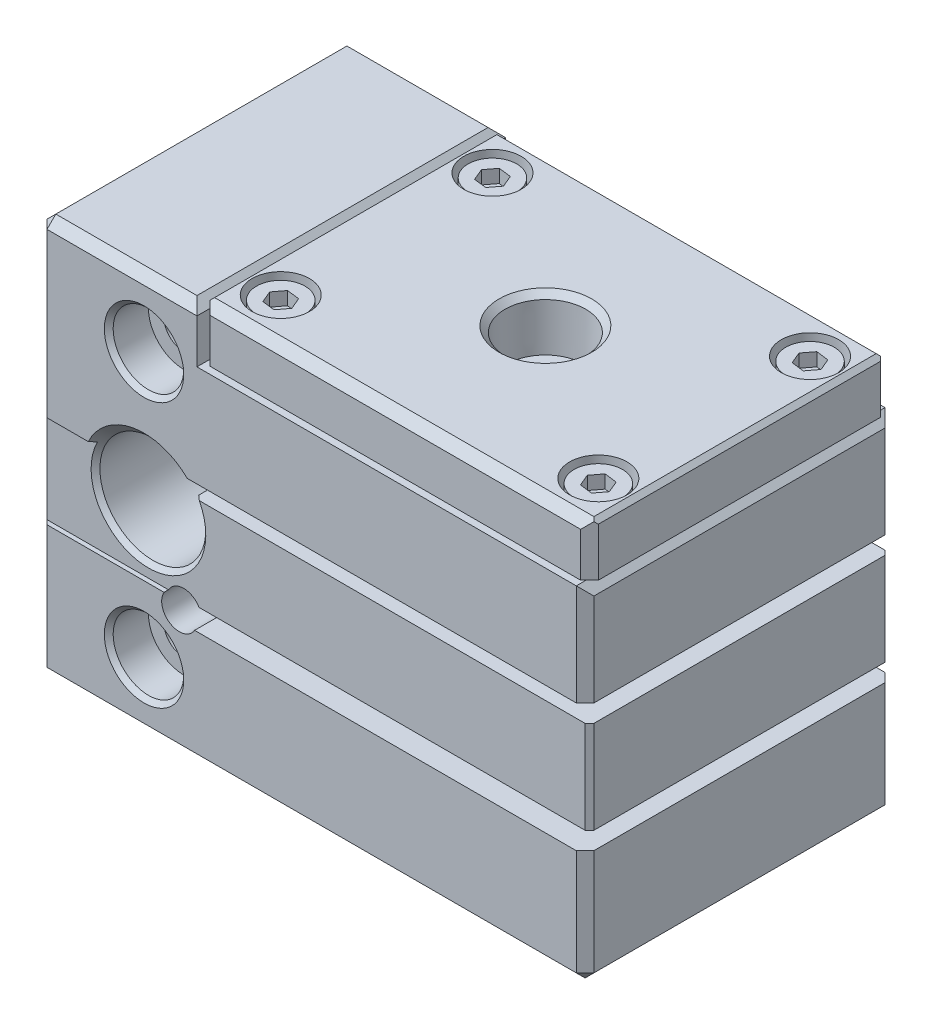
ISO-10303-21;
HEADER;
FILE_DESCRIPTION(('STEP AP214'),'2;1');
FILE_NAME('part.step','',(''),(''),'','','');
FILE_SCHEMA(('AUTOMOTIVE_DESIGN { 1 0 10303 214 1 1 1 1 }'));
ENDSEC;
DATA;
#1=APPLICATION_CONTEXT('core data for automotive mechanical design processes');
#2=APPLICATION_PROTOCOL_DEFINITION('international standard','automotive_design',2000,#1);
#3=PRODUCT_CONTEXT('',#1,'mechanical');
#4=PRODUCT('Part','Part','',(#3));
#5=PRODUCT_RELATED_PRODUCT_CATEGORY('part','',(#4));
#6=PRODUCT_DEFINITION_FORMATION('','',#4);
#7=PRODUCT_DEFINITION_CONTEXT('part definition',#1,'design');
#8=PRODUCT_DEFINITION('design','',#6,#7);
#9=PRODUCT_DEFINITION_SHAPE('','',#8);
#10=(LENGTH_UNIT() NAMED_UNIT(*) SI_UNIT(.MILLI.,.METRE.));
#11=(NAMED_UNIT(*) PLANE_ANGLE_UNIT() SI_UNIT($,.RADIAN.));
#12=(NAMED_UNIT(*) SI_UNIT($,.STERADIAN.) SOLID_ANGLE_UNIT());
#13=UNCERTAINTY_MEASURE_WITH_UNIT(LENGTH_MEASURE(1.E-05),#10,'distance_accuracy_value','');
#14=(GEOMETRIC_REPRESENTATION_CONTEXT(3) GLOBAL_UNCERTAINTY_ASSIGNED_CONTEXT((#13)) GLOBAL_UNIT_ASSIGNED_CONTEXT((#10,
#11,#12)) REPRESENTATION_CONTEXT('',''));
#15=CARTESIAN_POINT('',(0.,0.,0.));
#16=DIRECTION('',(0.,0.,1.));
#17=DIRECTION('',(1.,0.,0.));
#18=AXIS2_PLACEMENT_3D('',#15,#16,#17);
#19=CARTESIAN_POINT('',(45.6538579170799,34.3,32.228128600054));
#20=DIRECTION('',(0.,-1.,0.));
#21=DIRECTION('',(0.125869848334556,0.,-0.992046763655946));
#22=AXIS2_PLACEMENT_3D('',#19,#20,#21);
#23=PLANE('',#22);
#24=CARTESIAN_POINT('',(46.,34.3,29.5));
#25=DIRECTION('',(0.,1.,0.));
#26=DIRECTION('',(-0.125869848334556,0.,0.992046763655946));
#27=AXIS2_PLACEMENT_3D('',#24,#25,#26);
#28=CIRCLE('',#27,1.5);
#29=CARTESIAN_POINT('',(45.8111952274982,34.3,30.9880701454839));
#30=VERTEX_POINT('',#29);
#31=EDGE_CURVE('E1843',#30,#30,#28,.T.);
#32=ORIENTED_EDGE('',*,*,#31,.T.);
#33=EDGE_LOOP('',(#32));
#34=FACE_BOUND('',#33,.T.);
#35=CARTESIAN_POINT('',(46.,34.3,29.5));
#36=DIRECTION('',(0.,-1.,0.));
#37=DIRECTION('',(0.,0.,1.));
#38=AXIS2_PLACEMENT_3D('',#35,#36,#37);
#39=CIRCLE('',#38,1.75);
#40=CARTESIAN_POINT('',(46.,34.3,31.25));
#41=VERTEX_POINT('',#40);
#42=EDGE_CURVE('E1833',#41,#41,#39,.T.);
#43=ORIENTED_EDGE('',*,*,#42,.T.);
#44=EDGE_LOOP('',(#43));
#45=FACE_BOUND('',#44,.T.);
#46=ADVANCED_FACE('F14',(#34,#45),#23,.T.);
#47=CARTESIAN_POINT('',(46.,48.3,29.5));
#48=DIRECTION('',(0.,1.,0.));
#49=DIRECTION('',(-0.125869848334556,0.,0.992046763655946));
#50=AXIS2_PLACEMENT_3D('',#47,#48,#49);
#51=CYLINDRICAL_SURFACE('',#50,1.5);
#52=CARTESIAN_POINT('',(46.,31.5,29.5));
#53=DIRECTION('',(0.,1.,0.));
#54=DIRECTION('',(-1.,0.,0.));
#55=AXIS2_PLACEMENT_3D('',#52,#53,#54);
#56=CIRCLE('',#55,1.5);
#57=CARTESIAN_POINT('',(44.5,31.5,29.5));
#58=VERTEX_POINT('',#57);
#59=EDGE_CURVE('E24',#58,#58,#56,.F.);
#60=ORIENTED_EDGE('',*,*,#59,.F.);
#61=EDGE_LOOP('',(#60));
#62=FACE_BOUND('',#61,.T.);
#63=ORIENTED_EDGE('',*,*,#31,.F.);
#64=EDGE_LOOP('',(#63));
#65=FACE_BOUND('',#64,.T.);
#66=ADVANCED_FACE('F773',(#62,#65),#51,.T.);
#67=CARTESIAN_POINT('',(47.4318961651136,35.8,29.6816774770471));
#68=DIRECTION('',(-0.796202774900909,0.,-0.605029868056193));
#69=DIRECTION('',(-0.605029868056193,0.,0.796202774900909));
#70=AXIS2_PLACEMENT_3D('',#67,#68,#69);
#71=PLANE('',#70);
#72=DIRECTION('',(0.,1.,0.));
#73=VECTOR('',#72,1.);
#74=CARTESIAN_POINT('',(46.5586107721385,35.8,30.8308971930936));
#75=LINE('',#74,#73);
#76=CARTESIAN_POINT('',(46.5586107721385,35.8,30.8308971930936));
#77=VERTEX_POINT('',#76);
#78=CARTESIAN_POINT('',(46.5586107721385,37.3,30.8308971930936));
#79=VERTEX_POINT('',#78);
#80=EDGE_CURVE('E1845',#77,#79,#75,.T.);
#81=ORIENTED_EDGE('',*,*,#80,.T.);
#82=DIRECTION('',(-0.605029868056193,0.,0.796202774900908));
#83=VECTOR('',#82,1.);
#84=CARTESIAN_POINT('',(47.4318961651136,37.3,29.6816774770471));
#85=LINE('',#84,#83);
#86=CARTESIAN_POINT('',(47.4318961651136,37.3,29.6816774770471));
#87=VERTEX_POINT('',#86);
#88=EDGE_CURVE('E33',#87,#79,#85,.T.);
#89=ORIENTED_EDGE('',*,*,#88,.F.);
#90=DIRECTION('',(0.,1.,0.));
#91=VECTOR('',#90,1.);
#92=CARTESIAN_POINT('',(47.4318961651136,35.8,29.6816774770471));
#93=LINE('',#92,#91);
#94=CARTESIAN_POINT('',(47.4318961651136,35.8,29.6816774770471));
#95=VERTEX_POINT('',#94);
#96=EDGE_CURVE('E1859',#95,#87,#93,.T.);
#97=ORIENTED_EDGE('',*,*,#96,.F.);
#98=DIRECTION('',(-0.605029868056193,0.,0.796202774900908));
#99=VECTOR('',#98,1.);
#100=CARTESIAN_POINT('',(47.4318961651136,35.8,29.6816774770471));
#101=LINE('',#100,#99);
#102=EDGE_CURVE('E1862',#95,#77,#101,.T.);
#103=ORIENTED_EDGE('',*,*,#102,.T.);
#104=EDGE_LOOP('',(#81,#89,#97,#103));
#105=FACE_BOUND('',#104,.T.);
#106=ADVANCED_FACE('F779',(#105),#71,.T.);
#107=CARTESIAN_POINT('',(45.1267146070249,35.8,30.6492197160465));
#108=DIRECTION('',(-0.125869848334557,0.,0.992046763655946));
#109=DIRECTION('',(0.992046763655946,0.,0.125869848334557));
#110=AXIS2_PLACEMENT_3D('',#107,#108,#109);
#111=PLANE('',#110);
#112=DIRECTION('',(0.,1.,0.));
#113=VECTOR('',#112,1.);
#114=CARTESIAN_POINT('',(45.1267146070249,35.8,30.6492197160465));
#115=LINE('',#114,#113);
#116=CARTESIAN_POINT('',(45.1267146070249,35.8,30.6492197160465));
#117=VERTEX_POINT('',#116);
#118=CARTESIAN_POINT('',(45.1267146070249,37.3,30.6492197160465));
#119=VERTEX_POINT('',#118);
#120=EDGE_CURVE('E1847',#117,#119,#115,.T.);
#121=ORIENTED_EDGE('',*,*,#120,.T.);
#122=DIRECTION('',(0.992046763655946,0.,0.125869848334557));
#123=VECTOR('',#122,1.);
#124=CARTESIAN_POINT('',(45.1267146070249,37.3,30.6492197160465));
#125=LINE('',#124,#123);
#126=EDGE_CURVE('E1881',#119,#79,#125,.T.);
#127=ORIENTED_EDGE('',*,*,#126,.T.);
#128=ORIENTED_EDGE('',*,*,#80,.F.);
#129=DIRECTION('',(0.992046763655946,0.,0.125869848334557));
#130=VECTOR('',#129,1.);
#131=CARTESIAN_POINT('',(45.1267146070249,35.8,30.6492197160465));
#132=LINE('',#131,#130);
#133=EDGE_CURVE('E1865',#117,#77,#132,.T.);
#134=ORIENTED_EDGE('',*,*,#133,.F.);
#135=EDGE_LOOP('',(#121,#127,#128,#134));
#136=FACE_BOUND('',#135,.T.);
#137=ADVANCED_FACE('F1973',(#136),#111,.F.);
#138=CARTESIAN_POINT('',(44.5681038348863,35.8,29.3183225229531));
#139=DIRECTION('',(-0.922072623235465,0.,0.387016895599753));
#140=DIRECTION('',(0.387016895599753,0.,0.922072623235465));
#141=AXIS2_PLACEMENT_3D('',#138,#139,#140);
#142=PLANE('',#141);
#143=DIRECTION('',(0.,1.,0.));
#144=VECTOR('',#143,1.);
#145=CARTESIAN_POINT('',(44.5681038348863,35.8,29.3183225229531));
#146=LINE('',#145,#144);
#147=CARTESIAN_POINT('',(44.5681038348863,35.8,29.3183225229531));
#148=VERTEX_POINT('',#147);
#149=CARTESIAN_POINT('',(44.5681038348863,37.3,29.3183225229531));
#150=VERTEX_POINT('',#149);
#151=EDGE_CURVE('E1850',#148,#150,#146,.T.);
#152=ORIENTED_EDGE('',*,*,#151,.T.);
#153=DIRECTION('',(0.387016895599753,0.,0.922072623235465));
#154=VECTOR('',#153,1.);
#155=CARTESIAN_POINT('',(44.5681038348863,37.3,29.3183225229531));
#156=LINE('',#155,#154);
#157=EDGE_CURVE('E1884',#150,#119,#156,.T.);
#158=ORIENTED_EDGE('',*,*,#157,.T.);
#159=ORIENTED_EDGE('',*,*,#120,.F.);
#160=DIRECTION('',(0.387016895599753,0.,0.922072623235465));
#161=VECTOR('',#160,1.);
#162=CARTESIAN_POINT('',(44.5681038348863,35.8,29.3183225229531));
#163=LINE('',#162,#161);
#164=EDGE_CURVE('E1869',#148,#117,#163,.T.);
#165=ORIENTED_EDGE('',*,*,#164,.F.);
#166=EDGE_LOOP('',(#152,#158,#159,#165));
#167=FACE_BOUND('',#166,.T.);
#168=ADVANCED_FACE('F1966',(#167),#142,.F.);
#169=CARTESIAN_POINT('',(44.5681038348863,35.8,29.3183225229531));
#170=DIRECTION('',(0.796202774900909,0.,0.605029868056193));
#171=DIRECTION('',(0.605029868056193,0.,-0.796202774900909));
#172=AXIS2_PLACEMENT_3D('',#169,#170,#171);
#173=PLANE('',#172);
#174=DIRECTION('',(0.,1.,0.));
#175=VECTOR('',#174,1.);
#176=CARTESIAN_POINT('',(45.4413892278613,35.8,28.1691028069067));
#177=LINE('',#176,#175);
#178=CARTESIAN_POINT('',(45.4413892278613,35.8,28.1691028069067));
#179=VERTEX_POINT('',#178);
#180=CARTESIAN_POINT('',(45.4413892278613,37.3,28.1691028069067));
#181=VERTEX_POINT('',#180);
#182=EDGE_CURVE('E1853',#179,#181,#177,.T.);
#183=ORIENTED_EDGE('',*,*,#182,.T.);
#184=DIRECTION('',(0.605029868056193,0.,-0.796202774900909));
#185=VECTOR('',#184,1.);
#186=CARTESIAN_POINT('',(44.5681038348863,37.3,29.3183225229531));
#187=LINE('',#186,#185);
#188=EDGE_CURVE('E1887',#150,#181,#187,.T.);
#189=ORIENTED_EDGE('',*,*,#188,.F.);
#190=ORIENTED_EDGE('',*,*,#151,.F.);
#191=DIRECTION('',(0.605029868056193,0.,-0.796202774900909));
#192=VECTOR('',#191,1.);
#193=CARTESIAN_POINT('',(44.5681038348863,35.8,29.3183225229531));
#194=LINE('',#193,#192);
#195=EDGE_CURVE('E1872',#148,#179,#194,.T.);
#196=ORIENTED_EDGE('',*,*,#195,.T.);
#197=EDGE_LOOP('',(#183,#189,#190,#196));
#198=FACE_BOUND('',#197,.T.);
#199=ADVANCED_FACE('F1963',(#198),#173,.T.);
#200=CARTESIAN_POINT('',(46.8732853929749,35.8,28.3507802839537));
#201=DIRECTION('',(0.125869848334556,0.,-0.992046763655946));
#202=DIRECTION('',(-0.992046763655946,0.,-0.125869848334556));
#203=AXIS2_PLACEMENT_3D('',#200,#201,#202);
#204=PLANE('',#203);
#205=DIRECTION('',(0.,1.,0.));
#206=VECTOR('',#205,1.);
#207=CARTESIAN_POINT('',(46.8732853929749,35.8,28.3507802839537));
#208=LINE('',#207,#206);
#209=CARTESIAN_POINT('',(46.8732853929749,35.8,28.3507802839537));
#210=VERTEX_POINT('',#209);
#211=CARTESIAN_POINT('',(46.8732853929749,37.3,28.3507802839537));
#212=VERTEX_POINT('',#211);
#213=EDGE_CURVE('E1856',#210,#212,#208,.T.);
#214=ORIENTED_EDGE('',*,*,#213,.T.);
#215=DIRECTION('',(-0.992046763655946,0.,-0.125869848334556));
#216=VECTOR('',#215,1.);
#217=CARTESIAN_POINT('',(46.8732853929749,37.3,28.3507802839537));
#218=LINE('',#217,#216);
#219=EDGE_CURVE('E1890',#212,#181,#218,.T.);
#220=ORIENTED_EDGE('',*,*,#219,.T.);
#221=ORIENTED_EDGE('',*,*,#182,.F.);
#222=DIRECTION('',(-0.992046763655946,0.,-0.125869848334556));
#223=VECTOR('',#222,1.);
#224=CARTESIAN_POINT('',(46.8732853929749,35.8,28.3507802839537));
#225=LINE('',#224,#223);
#226=EDGE_CURVE('E1875',#210,#179,#225,.T.);
#227=ORIENTED_EDGE('',*,*,#226,.F.);
#228=EDGE_LOOP('',(#214,#220,#221,#227));
#229=FACE_BOUND('',#228,.T.);
#230=ADVANCED_FACE('F1945',(#229),#204,.F.);
#231=CARTESIAN_POINT('',(47.4318961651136,35.8,29.6816774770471));
#232=DIRECTION('',(0.922072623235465,0.,-0.387016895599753));
#233=DIRECTION('',(-0.387016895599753,0.,-0.922072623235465));
#234=AXIS2_PLACEMENT_3D('',#231,#232,#233);
#235=PLANE('',#234);
#236=DIRECTION('',(-0.387016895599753,0.,-0.922072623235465));
#237=VECTOR('',#236,1.);
#238=CARTESIAN_POINT('',(47.4318961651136,35.8,29.6816774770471));
#239=LINE('',#238,#237);
#240=EDGE_CURVE('E1861',#95,#210,#239,.T.);
#241=ORIENTED_EDGE('',*,*,#240,.F.);
#242=ORIENTED_EDGE('',*,*,#96,.T.);
#243=DIRECTION('',(-0.387016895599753,0.,-0.922072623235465));
#244=VECTOR('',#243,1.);
#245=CARTESIAN_POINT('',(47.4318961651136,37.3,29.6816774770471));
#246=LINE('',#245,#244);
#247=EDGE_CURVE('E1866',#87,#212,#246,.T.);
#248=ORIENTED_EDGE('',*,*,#247,.T.);
#249=ORIENTED_EDGE('',*,*,#213,.F.);
#250=EDGE_LOOP('',(#241,#242,#248,#249));
#251=FACE_BOUND('',#250,.T.);
#252=ADVANCED_FACE('F797',(#251),#235,.F.);
#253=CARTESIAN_POINT('',(46.5586107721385,35.8,30.8308971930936));
#254=DIRECTION('',(0.,1.,0.));
#255=DIRECTION('',(-0.125869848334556,0.,0.992046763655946));
#256=AXIS2_PLACEMENT_3D('',#253,#254,#255);
#257=PLANE('',#256);
#258=ORIENTED_EDGE('',*,*,#102,.F.);
#259=ORIENTED_EDGE('',*,*,#240,.T.);
#260=ORIENTED_EDGE('',*,*,#226,.T.);
#261=ORIENTED_EDGE('',*,*,#195,.F.);
#262=ORIENTED_EDGE('',*,*,#164,.T.);
#263=ORIENTED_EDGE('',*,*,#133,.T.);
#264=EDGE_LOOP('',(#258,#259,#260,#261,#262,#263));
#265=FACE_BOUND('',#264,.T.);
#266=ADVANCED_FACE('F795',(#265),#257,.T.);
#267=CARTESIAN_POINT('',(46.,37.3,29.5));
#268=DIRECTION('',(0.,1.,0.));
#269=DIRECTION('',(-0.125869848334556,0.,0.992046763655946));
#270=AXIS2_PLACEMENT_3D('',#267,#268,#269);
#271=PLANE('',#270);
#272=CARTESIAN_POINT('',(46.,37.3,29.5));
#273=DIRECTION('',(0.,1.,0.));
#274=DIRECTION('',(-0.125869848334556,0.,0.992046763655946));
#275=AXIS2_PLACEMENT_3D('',#272,#273,#274);
#276=CIRCLE('',#275,2.75);
#277=CARTESIAN_POINT('',(45.65385791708,37.3,32.2281286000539));
#278=VERTEX_POINT('',#277);
#279=EDGE_CURVE('E1837',#278,#278,#276,.T.);
#280=ORIENTED_EDGE('',*,*,#279,.T.);
#281=EDGE_LOOP('',(#280));
#282=FACE_BOUND('',#281,.T.);
#283=ORIENTED_EDGE('',*,*,#247,.F.);
#284=ORIENTED_EDGE('',*,*,#88,.T.);
#285=ORIENTED_EDGE('',*,*,#126,.F.);
#286=ORIENTED_EDGE('',*,*,#157,.F.);
#287=ORIENTED_EDGE('',*,*,#188,.T.);
#288=ORIENTED_EDGE('',*,*,#219,.F.);
#289=EDGE_LOOP('',(#283,#284,#285,#286,#287,#288));
#290=FACE_BOUND('',#289,.T.);
#291=ADVANCED_FACE('F791',(#282,#290),#271,.T.);
#292=CARTESIAN_POINT('',(46.,48.3,29.5));
#293=DIRECTION('',(0.,1.,0.));
#294=DIRECTION('',(-0.125869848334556,0.,0.992046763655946));
#295=AXIS2_PLACEMENT_3D('',#292,#293,#294);
#296=CYLINDRICAL_SURFACE('',#295,2.75);
#297=CARTESIAN_POINT('',(46.,34.3,29.5));
#298=DIRECTION('',(0.,1.,0.));
#299=DIRECTION('',(-0.125869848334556,0.,0.992046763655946));
#300=AXIS2_PLACEMENT_3D('',#297,#298,#299);
#301=CIRCLE('',#300,2.75);
#302=CARTESIAN_POINT('',(45.65385791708,34.3,32.2281286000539));
#303=VERTEX_POINT('',#302);
#304=EDGE_CURVE('E1840',#303,#303,#301,.T.);
#305=ORIENTED_EDGE('',*,*,#304,.T.);
#306=EDGE_LOOP('',(#305));
#307=FACE_BOUND('',#306,.T.);
#308=ORIENTED_EDGE('',*,*,#279,.F.);
#309=EDGE_LOOP('',(#308));
#310=FACE_BOUND('',#309,.T.);
#311=ADVANCED_FACE('F787',(#307,#310),#296,.T.);
#312=CARTESIAN_POINT('',(32.618802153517,-2.5,17.5));
#313=DIRECTION('',(0.,-1.,0.));
#314=DIRECTION('',(0.,0.,-1.));
#315=AXIS2_PLACEMENT_3D('',#312,#313,#314);
#316=PLANE('',#315);
#317=DIRECTION('',(0.5,0.,0.866025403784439));
#318=VECTOR('',#317,1.);
#319=CARTESIAN_POINT('',(30.3094010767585,-2.5,13.5));
#320=LINE('',#319,#318);
#321=CARTESIAN_POINT('',(30.3094010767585,-2.5,13.5));
#322=VERTEX_POINT('',#321);
#323=CARTESIAN_POINT('',(32.618802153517,-2.5,17.5));
#324=VERTEX_POINT('',#323);
#325=EDGE_CURVE('E1626',#322,#324,#320,.T.);
#326=ORIENTED_EDGE('',*,*,#325,.T.);
#327=DIRECTION('',(-0.5,0.,0.866025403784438));
#328=VECTOR('',#327,1.);
#329=CARTESIAN_POINT('',(32.618802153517,-2.5,17.5));
#330=LINE('',#329,#328);
#331=CARTESIAN_POINT('',(30.3094010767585,-2.5,21.5));
#332=VERTEX_POINT('',#331);
#333=EDGE_CURVE('E1651',#324,#332,#330,.T.);
#334=ORIENTED_EDGE('',*,*,#333,.T.);
#335=DIRECTION('',(-1.,0.,0.));
#336=VECTOR('',#335,1.);
#337=CARTESIAN_POINT('',(30.3094010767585,-2.5,21.5));
#338=LINE('',#337,#336);
#339=CARTESIAN_POINT('',(25.6905989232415,-2.5,21.5));
#340=VERTEX_POINT('',#339);
#341=EDGE_CURVE('E1648',#332,#340,#338,.T.);
#342=ORIENTED_EDGE('',*,*,#341,.T.);
#343=DIRECTION('',(-0.5,0.,-0.866025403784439));
#344=VECTOR('',#343,1.);
#345=CARTESIAN_POINT('',(25.6905989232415,-2.5,21.5));
#346=LINE('',#345,#344);
#347=CARTESIAN_POINT('',(23.381197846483,-2.5,17.5));
#348=VERTEX_POINT('',#347);
#349=EDGE_CURVE('E1645',#340,#348,#346,.T.);
#350=ORIENTED_EDGE('',*,*,#349,.T.);
#351=DIRECTION('',(0.5,0.,-0.866025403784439));
#352=VECTOR('',#351,1.);
#353=CARTESIAN_POINT('',(23.381197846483,-2.5,17.5));
#354=LINE('',#353,#352);
#355=CARTESIAN_POINT('',(25.6905989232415,-2.5,13.5));
#356=VERTEX_POINT('',#355);
#357=EDGE_CURVE('E1642',#348,#356,#354,.T.);
#358=ORIENTED_EDGE('',*,*,#357,.T.);
#359=DIRECTION('',(1.,0.,0.));
#360=VECTOR('',#359,1.);
#361=CARTESIAN_POINT('',(25.6905989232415,-2.5,13.5));
#362=LINE('',#361,#360);
#363=EDGE_CURVE('E1614',#356,#322,#362,.T.);
#364=ORIENTED_EDGE('',*,*,#363,.T.);
#365=EDGE_LOOP('',(#326,#334,#342,#350,#358,#364));
#366=FACE_BOUND('',#365,.T.);
#367=ADVANCED_FACE('F790',(#366),#316,.T.);
#368=CARTESIAN_POINT('',(30.3094010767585,-2.5,21.5));
#369=DIRECTION('',(0.,0.,1.));
#370=DIRECTION('',(-1.,0.,0.));
#371=AXIS2_PLACEMENT_3D('',#368,#369,#370);
#372=PLANE('',#371);
#373=DIRECTION('',(-1.,0.,0.));
#374=VECTOR('',#373,1.);
#375=CARTESIAN_POINT('',(30.3094010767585,-7.5,21.5));
#376=LINE('',#375,#374);
#377=CARTESIAN_POINT('',(30.3094010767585,-7.5,21.5));
#378=VERTEX_POINT('',#377);
#379=CARTESIAN_POINT('',(25.6905989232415,-7.5,21.5));
#380=VERTEX_POINT('',#379);
#381=EDGE_CURVE('E1633',#378,#380,#376,.T.);
#382=ORIENTED_EDGE('',*,*,#381,.T.);
#383=DIRECTION('',(0.,-1.,0.));
#384=VECTOR('',#383,1.);
#385=CARTESIAN_POINT('',(25.6905989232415,-2.5,21.5));
#386=LINE('',#385,#384);
#387=EDGE_CURVE('E1616',#340,#380,#386,.T.);
#388=ORIENTED_EDGE('',*,*,#387,.F.);
#389=ORIENTED_EDGE('',*,*,#341,.F.);
#390=DIRECTION('',(0.,-1.,0.));
#391=VECTOR('',#390,1.);
#392=CARTESIAN_POINT('',(30.3094010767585,-2.5,21.5));
#393=LINE('',#392,#391);
#394=EDGE_CURVE('E1613',#332,#378,#393,.T.);
#395=ORIENTED_EDGE('',*,*,#394,.T.);
#396=EDGE_LOOP('',(#382,#388,#389,#395));
#397=FACE_BOUND('',#396,.T.);
#398=ADVANCED_FACE('F928',(#397),#372,.F.);
#399=CARTESIAN_POINT('',(25.6905989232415,-2.5,21.5));
#400=DIRECTION('',(-0.866025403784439,0.,0.5));
#401=DIRECTION('',(-0.5,0.,-0.866025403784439));
#402=AXIS2_PLACEMENT_3D('',#399,#400,#401);
#403=PLANE('',#402);
#404=DIRECTION('',(-0.5,0.,-0.866025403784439));
#405=VECTOR('',#404,1.);
#406=CARTESIAN_POINT('',(25.6905989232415,-7.5,21.5));
#407=LINE('',#406,#405);
#408=CARTESIAN_POINT('',(23.381197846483,-7.5,17.5));
#409=VERTEX_POINT('',#408);
#410=EDGE_CURVE('E1630',#380,#409,#407,.T.);
#411=ORIENTED_EDGE('',*,*,#410,.T.);
#412=DIRECTION('',(0.,-1.,0.));
#413=VECTOR('',#412,1.);
#414=CARTESIAN_POINT('',(23.381197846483,-2.5,17.5));
#415=LINE('',#414,#413);
#416=EDGE_CURVE('E1618',#348,#409,#415,.T.);
#417=ORIENTED_EDGE('',*,*,#416,.F.);
#418=ORIENTED_EDGE('',*,*,#349,.F.);
#419=ORIENTED_EDGE('',*,*,#387,.T.);
#420=EDGE_LOOP('',(#411,#417,#418,#419));
#421=FACE_BOUND('',#420,.T.);
#422=ADVANCED_FACE('F938',(#421),#403,.F.);
#423=CARTESIAN_POINT('',(23.381197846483,-2.5,17.5));
#424=DIRECTION('',(-0.866025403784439,0.,-0.5));
#425=DIRECTION('',(0.5,0.,-0.866025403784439));
#426=AXIS2_PLACEMENT_3D('',#423,#424,#425);
#427=PLANE('',#426);
#428=DIRECTION('',(0.5,0.,-0.866025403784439));
#429=VECTOR('',#428,1.);
#430=CARTESIAN_POINT('',(23.381197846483,-7.5,17.5));
#431=LINE('',#430,#429);
#432=CARTESIAN_POINT('',(25.6905989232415,-7.5,13.5));
#433=VERTEX_POINT('',#432);
#434=EDGE_CURVE('E1627',#409,#433,#431,.T.);
#435=ORIENTED_EDGE('',*,*,#434,.T.);
#436=DIRECTION('',(0.,-1.,0.));
#437=VECTOR('',#436,1.);
#438=CARTESIAN_POINT('',(25.6905989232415,-2.5,13.5));
#439=LINE('',#438,#437);
#440=EDGE_CURVE('E1620',#356,#433,#439,.T.);
#441=ORIENTED_EDGE('',*,*,#440,.F.);
#442=ORIENTED_EDGE('',*,*,#357,.F.);
#443=ORIENTED_EDGE('',*,*,#416,.T.);
#444=EDGE_LOOP('',(#435,#441,#442,#443));
#445=FACE_BOUND('',#444,.T.);
#446=ADVANCED_FACE('F934',(#445),#427,.F.);
#447=CARTESIAN_POINT('',(25.6905989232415,-2.5,13.5));
#448=DIRECTION('',(0.,0.,-1.));
#449=DIRECTION('',(0.,1.,0.));
#450=AXIS2_PLACEMENT_3D('',#447,#448,#449);
#451=PLANE('',#450);
#452=DIRECTION('',(1.,0.,0.));
#453=VECTOR('',#452,1.);
#454=CARTESIAN_POINT('',(25.6905989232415,-7.5,13.5));
#455=LINE('',#454,#453);
#456=CARTESIAN_POINT('',(30.3094010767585,-7.5,13.5));
#457=VERTEX_POINT('',#456);
#458=EDGE_CURVE('E1623',#433,#457,#455,.T.);
#459=ORIENTED_EDGE('',*,*,#458,.T.);
#460=DIRECTION('',(0.,-1.,0.));
#461=VECTOR('',#460,1.);
#462=CARTESIAN_POINT('',(30.3094010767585,-2.5,13.5));
#463=LINE('',#462,#461);
#464=EDGE_CURVE('E1609',#322,#457,#463,.T.);
#465=ORIENTED_EDGE('',*,*,#464,.F.);
#466=ORIENTED_EDGE('',*,*,#363,.F.);
#467=ORIENTED_EDGE('',*,*,#440,.T.);
#468=EDGE_LOOP('',(#459,#465,#466,#467));
#469=FACE_BOUND('',#468,.T.);
#470=ADVANCED_FACE('F930',(#469),#451,.F.);
#471=CARTESIAN_POINT('',(30.3094010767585,-2.5,13.5));
#472=DIRECTION('',(0.866025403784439,0.,-0.5));
#473=DIRECTION('',(0.5,0.,0.866025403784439));
#474=AXIS2_PLACEMENT_3D('',#471,#472,#473);
#475=PLANE('',#474);
#476=DIRECTION('',(0.5,0.,0.866025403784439));
#477=VECTOR('',#476,1.);
#478=CARTESIAN_POINT('',(30.3094010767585,-7.5,13.5));
#479=LINE('',#478,#477);
#480=CARTESIAN_POINT('',(32.618802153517,-7.5,17.5));
#481=VERTEX_POINT('',#480);
#482=EDGE_CURVE('E1593',#457,#481,#479,.T.);
#483=ORIENTED_EDGE('',*,*,#482,.T.);
#484=DIRECTION('',(0.,-1.,0.));
#485=VECTOR('',#484,1.);
#486=CARTESIAN_POINT('',(32.618802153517,-2.5,17.5));
#487=LINE('',#486,#485);
#488=EDGE_CURVE('E1610',#324,#481,#487,.T.);
#489=ORIENTED_EDGE('',*,*,#488,.F.);
#490=ORIENTED_EDGE('',*,*,#325,.F.);
#491=ORIENTED_EDGE('',*,*,#464,.T.);
#492=EDGE_LOOP('',(#483,#489,#490,#491));
#493=FACE_BOUND('',#492,.T.);
#494=ADVANCED_FACE('F933',(#493),#475,.F.);
#495=CARTESIAN_POINT('',(32.618802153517,-2.5,17.5));
#496=DIRECTION('',(0.866025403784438,0.,0.5));
#497=DIRECTION('',(-0.5,0.,0.866025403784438));
#498=AXIS2_PLACEMENT_3D('',#495,#496,#497);
#499=PLANE('',#498);
#500=DIRECTION('',(-0.5,0.,0.866025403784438));
#501=VECTOR('',#500,1.);
#502=CARTESIAN_POINT('',(32.618802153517,-7.5,17.5));
#503=LINE('',#502,#501);
#504=EDGE_CURVE('E1636',#481,#378,#503,.T.);
#505=ORIENTED_EDGE('',*,*,#504,.T.);
#506=ORIENTED_EDGE('',*,*,#394,.F.);
#507=ORIENTED_EDGE('',*,*,#333,.F.);
#508=ORIENTED_EDGE('',*,*,#488,.T.);
#509=EDGE_LOOP('',(#505,#506,#507,#508));
#510=FACE_BOUND('',#509,.T.);
#511=ADVANCED_FACE('F946',(#510),#499,.F.);
#512=CARTESIAN_POINT('',(37.5,-7.5,17.5));
#513=DIRECTION('',(0.,1.,0.));
#514=DIRECTION('',(0.,0.,1.));
#515=AXIS2_PLACEMENT_3D('',#512,#513,#514);
#516=PLANE('',#515);
#517=ORIENTED_EDGE('',*,*,#504,.F.);
#518=ORIENTED_EDGE('',*,*,#482,.F.);
#519=ORIENTED_EDGE('',*,*,#458,.F.);
#520=ORIENTED_EDGE('',*,*,#434,.F.);
#521=ORIENTED_EDGE('',*,*,#410,.F.);
#522=ORIENTED_EDGE('',*,*,#381,.F.);
#523=EDGE_LOOP('',(#517,#518,#519,#520,#521,#522));
#524=FACE_BOUND('',#523,.T.);
#525=CARTESIAN_POINT('',(28.,-7.5,17.5));
#526=DIRECTION('',(0.,1.,0.));
#527=DIRECTION('',(0.,0.,1.));
#528=AXIS2_PLACEMENT_3D('',#525,#526,#527);
#529=CIRCLE('',#528,9.5);
#530=CARTESIAN_POINT('',(28.,-7.5,27.));
#531=VERTEX_POINT('',#530);
#532=EDGE_CURVE('E1606',#531,#531,#529,.T.);
#533=ORIENTED_EDGE('',*,*,#532,.F.);
#534=EDGE_LOOP('',(#533));
#535=FACE_BOUND('',#534,.T.);
#536=ADVANCED_FACE('F802',(#524,#535),#516,.F.);
#537=CARTESIAN_POINT('',(46.5586107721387,35.8,6.83089719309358));
#538=DIRECTION('',(0.,1.,0.));
#539=DIRECTION('',(-0.125869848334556,0.,0.992046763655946));
#540=AXIS2_PLACEMENT_3D('',#537,#538,#539);
#541=PLANE('',#540);
#542=DIRECTION('',(-0.605029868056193,0.,0.796202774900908));
#543=VECTOR('',#542,1.);
#544=CARTESIAN_POINT('',(47.4318961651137,35.8,5.68167747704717));
#545=LINE('',#544,#543);
#546=CARTESIAN_POINT('',(47.4318961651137,35.8,5.68167747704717));
#547=VERTEX_POINT('',#546);
#548=CARTESIAN_POINT('',(46.5586107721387,35.8,6.83089719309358));
#549=VERTEX_POINT('',#548);
#550=EDGE_CURVE('E1799',#547,#549,#545,.T.);
#551=ORIENTED_EDGE('',*,*,#550,.F.);
#552=DIRECTION('',(-0.387016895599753,0.,-0.922072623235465));
#553=VECTOR('',#552,1.);
#554=CARTESIAN_POINT('',(47.4318961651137,35.8,5.68167747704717));
#555=LINE('',#554,#553);
#556=CARTESIAN_POINT('',(46.8732853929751,35.8,4.35078028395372));
#557=VERTEX_POINT('',#556);
#558=EDGE_CURVE('E1798',#547,#557,#555,.T.);
#559=ORIENTED_EDGE('',*,*,#558,.T.);
#560=DIRECTION('',(-0.992046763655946,0.,-0.125869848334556));
#561=VECTOR('',#560,1.);
#562=CARTESIAN_POINT('',(46.8732853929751,35.8,4.35078028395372));
#563=LINE('',#562,#561);
#564=CARTESIAN_POINT('',(45.4413892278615,35.8,4.16910280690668));
#565=VERTEX_POINT('',#564);
#566=EDGE_CURVE('E1812',#557,#565,#563,.T.);
#567=ORIENTED_EDGE('',*,*,#566,.T.);
#568=DIRECTION('',(0.605029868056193,0.,-0.796202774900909));
#569=VECTOR('',#568,1.);
#570=CARTESIAN_POINT('',(44.5681038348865,35.8,5.3183225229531));
#571=LINE('',#570,#569);
#572=CARTESIAN_POINT('',(44.5681038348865,35.8,5.3183225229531));
#573=VERTEX_POINT('',#572);
#574=EDGE_CURVE('E1809',#573,#565,#571,.T.);
#575=ORIENTED_EDGE('',*,*,#574,.F.);
#576=DIRECTION('',(0.387016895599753,0.,0.922072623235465));
#577=VECTOR('',#576,1.);
#578=CARTESIAN_POINT('',(44.5681038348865,35.8,5.3183225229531));
#579=LINE('',#578,#577);
#580=CARTESIAN_POINT('',(45.1267146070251,35.8,6.64921971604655));
#581=VERTEX_POINT('',#580);
#582=EDGE_CURVE('E1806',#573,#581,#579,.T.);
#583=ORIENTED_EDGE('',*,*,#582,.T.);
#584=DIRECTION('',(0.992046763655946,0.,0.125869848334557));
#585=VECTOR('',#584,1.);
#586=CARTESIAN_POINT('',(45.1267146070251,35.8,6.64921971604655));
#587=LINE('',#586,#585);
#588=EDGE_CURVE('E1802',#581,#549,#587,.T.);
#589=ORIENTED_EDGE('',*,*,#588,.T.);
#590=EDGE_LOOP('',(#551,#559,#567,#575,#583,#589));
#591=FACE_BOUND('',#590,.T.);
#592=ADVANCED_FACE('F798',(#591),#541,.T.);
#593=CARTESIAN_POINT('',(9.44138922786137,35.8,4.16910280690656));
#594=DIRECTION('',(0.,1.,0.));
#595=DIRECTION('',(0.125869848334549,0.,-0.992046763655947));
#596=AXIS2_PLACEMENT_3D('',#593,#594,#595);
#597=PLANE('',#596);
#598=DIRECTION('',(0.605029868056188,0.,-0.796202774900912));
#599=VECTOR('',#598,1.);
#600=CARTESIAN_POINT('',(8.56810383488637,35.8,5.31832252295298));
#601=LINE('',#600,#599);
#602=CARTESIAN_POINT('',(8.56810383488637,35.8,5.31832252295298));
#603=VERTEX_POINT('',#602);
#604=CARTESIAN_POINT('',(9.44138922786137,35.8,4.16910280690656));
#605=VERTEX_POINT('',#604);
#606=EDGE_CURVE('E1739',#603,#605,#601,.T.);
#607=ORIENTED_EDGE('',*,*,#606,.F.);
#608=DIRECTION('',(0.387016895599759,0.,0.922072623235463));
#609=VECTOR('',#608,1.);
#610=CARTESIAN_POINT('',(8.56810383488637,35.8,5.31832252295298));
#611=LINE('',#610,#609);
#612=CARTESIAN_POINT('',(9.126714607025,35.8,6.64921971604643));
#613=VERTEX_POINT('',#612);
#614=EDGE_CURVE('E1738',#603,#613,#611,.T.);
#615=ORIENTED_EDGE('',*,*,#614,.T.);
#616=DIRECTION('',(0.992046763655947,0.,0.12586984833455));
#617=VECTOR('',#616,1.);
#618=CARTESIAN_POINT('',(9.126714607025,35.8,6.64921971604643));
#619=LINE('',#618,#617);
#620=CARTESIAN_POINT('',(10.5586107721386,35.8,6.83089719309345));
#621=VERTEX_POINT('',#620);
#622=EDGE_CURVE('E1752',#613,#621,#619,.T.);
#623=ORIENTED_EDGE('',*,*,#622,.T.);
#624=DIRECTION('',(-0.605029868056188,0.,0.796202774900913));
#625=VECTOR('',#624,1.);
#626=CARTESIAN_POINT('',(11.4318961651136,35.8,5.68167747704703));
#627=LINE('',#626,#625);
#628=CARTESIAN_POINT('',(11.4318961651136,35.8,5.68167747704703));
#629=VERTEX_POINT('',#628);
#630=EDGE_CURVE('E1749',#629,#621,#627,.T.);
#631=ORIENTED_EDGE('',*,*,#630,.F.);
#632=DIRECTION('',(-0.387016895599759,0.,-0.922072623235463));
#633=VECTOR('',#632,1.);
#634=CARTESIAN_POINT('',(11.4318961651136,35.8,5.68167747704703));
#635=LINE('',#634,#633);
#636=CARTESIAN_POINT('',(10.873285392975,35.8,4.35078028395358));
#637=VERTEX_POINT('',#636);
#638=EDGE_CURVE('E1746',#629,#637,#635,.T.);
#639=ORIENTED_EDGE('',*,*,#638,.T.);
#640=DIRECTION('',(-0.992046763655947,0.,-0.12586984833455));
#641=VECTOR('',#640,1.);
#642=CARTESIAN_POINT('',(10.873285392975,35.8,4.35078028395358));
#643=LINE('',#642,#641);
#644=EDGE_CURVE('E1742',#637,#605,#643,.T.);
#645=ORIENTED_EDGE('',*,*,#644,.T.);
#646=EDGE_LOOP('',(#607,#615,#623,#631,#639,#645));
#647=FACE_BOUND('',#646,.T.);
#648=ADVANCED_FACE('F801',(#647),#597,.T.);
#649=CARTESIAN_POINT('',(9.44138922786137,35.8,28.1691028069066));
#650=DIRECTION('',(0.,1.,0.));
#651=DIRECTION('',(0.125869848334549,0.,-0.992046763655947));
#652=AXIS2_PLACEMENT_3D('',#649,#650,#651);
#653=PLANE('',#652);
#654=DIRECTION('',(0.605029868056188,0.,-0.796202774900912));
#655=VECTOR('',#654,1.);
#656=CARTESIAN_POINT('',(8.56810383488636,35.8,29.318322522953));
#657=LINE('',#656,#655);
#658=CARTESIAN_POINT('',(8.56810383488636,35.8,29.318322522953));
#659=VERTEX_POINT('',#658);
#660=CARTESIAN_POINT('',(9.44138922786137,35.8,28.1691028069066));
#661=VERTEX_POINT('',#660);
#662=EDGE_CURVE('E1678',#659,#661,#657,.T.);
#663=ORIENTED_EDGE('',*,*,#662,.F.);
#664=DIRECTION('',(0.387016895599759,0.,0.922072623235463));
#665=VECTOR('',#664,1.);
#666=CARTESIAN_POINT('',(8.56810383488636,35.8,29.318322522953));
#667=LINE('',#666,#665);
#668=CARTESIAN_POINT('',(9.126714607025,35.8,30.6492197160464));
#669=VERTEX_POINT('',#668);
#670=EDGE_CURVE('E1677',#659,#669,#667,.T.);
#671=ORIENTED_EDGE('',*,*,#670,.T.);
#672=DIRECTION('',(0.992046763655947,0.,0.12586984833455));
#673=VECTOR('',#672,1.);
#674=CARTESIAN_POINT('',(9.126714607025,35.8,30.6492197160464));
#675=LINE('',#674,#673);
#676=CARTESIAN_POINT('',(10.5586107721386,35.8,30.8308971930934));
#677=VERTEX_POINT('',#676);
#678=EDGE_CURVE('E1691',#669,#677,#675,.T.);
#679=ORIENTED_EDGE('',*,*,#678,.T.);
#680=DIRECTION('',(-0.605029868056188,0.,0.796202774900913));
#681=VECTOR('',#680,1.);
#682=CARTESIAN_POINT('',(11.4318961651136,35.8,29.681677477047));
#683=LINE('',#682,#681);
#684=CARTESIAN_POINT('',(11.4318961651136,35.8,29.681677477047));
#685=VERTEX_POINT('',#684);
#686=EDGE_CURVE('E1688',#685,#677,#683,.T.);
#687=ORIENTED_EDGE('',*,*,#686,.F.);
#688=DIRECTION('',(-0.387016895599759,0.,-0.922072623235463));
#689=VECTOR('',#688,1.);
#690=CARTESIAN_POINT('',(11.4318961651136,35.8,29.681677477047));
#691=LINE('',#690,#689);
#692=CARTESIAN_POINT('',(10.873285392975,35.8,28.3507802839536));
#693=VERTEX_POINT('',#692);
#694=EDGE_CURVE('E1685',#685,#693,#691,.T.);
#695=ORIENTED_EDGE('',*,*,#694,.T.);
#696=DIRECTION('',(-0.992046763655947,0.,-0.12586984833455));
#697=VECTOR('',#696,1.);
#698=CARTESIAN_POINT('',(10.873285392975,35.8,28.3507802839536));
#699=LINE('',#698,#697);
#700=EDGE_CURVE('E1681',#693,#661,#699,.T.);
#701=ORIENTED_EDGE('',*,*,#700,.T.);
#702=EDGE_LOOP('',(#663,#671,#679,#687,#695,#701));
#703=FACE_BOUND('',#702,.T.);
#704=ADVANCED_FACE('F845',(#703),#653,.T.);
#705=CARTESIAN_POINT('',(0.,0.,35.));
#706=DIRECTION('',(0.,0.,1.));
#707=DIRECTION('',(0.,1.,0.));
#708=AXIS2_PLACEMENT_3D('',#705,#706,#707);
#709=CYLINDRICAL_SURFACE('',#708,2.25);
#710=CARTESIAN_POINT('',(0.,0.,30.5));
#711=DIRECTION('',(0.,0.,1.));
#712=DIRECTION('',(0.,1.,0.));
#713=AXIS2_PLACEMENT_3D('',#710,#711,#712);
#714=CIRCLE('',#713,2.25);
#715=CARTESIAN_POINT('',(0.,2.25,30.5));
#716=VERTEX_POINT('',#715);
#717=EDGE_CURVE('E1221',#716,#716,#714,.T.);
#718=ORIENTED_EDGE('',*,*,#717,.T.);
#719=EDGE_LOOP('',(#718));
#720=FACE_BOUND('',#719,.T.);
#721=CARTESIAN_POINT('',(0.,0.,4.5));
#722=DIRECTION('',(0.,0.,-1.));
#723=DIRECTION('',(0.,-1.,0.));
#724=AXIS2_PLACEMENT_3D('',#721,#722,#723);
#725=CIRCLE('',#724,2.25);
#726=CARTESIAN_POINT('',(0.,-2.25,4.5));
#727=VERTEX_POINT('',#726);
#728=EDGE_CURVE('E1216',#727,#727,#725,.F.);
#729=ORIENTED_EDGE('',*,*,#728,.F.);
#730=EDGE_LOOP('',(#729));
#731=FACE_BOUND('',#730,.T.);
#732=ADVANCED_FACE('F655',(#720,#731),#709,.F.);
#733=CARTESIAN_POINT('',(28.,4.5,17.5));
#734=DIRECTION('',(0.,1.,0.));
#735=DIRECTION('',(0.,0.,1.));
#736=AXIS2_PLACEMENT_3D('',#733,#734,#735);
#737=CYLINDRICAL_SURFACE('',#736,9.5);
#738=CARTESIAN_POINT('',(28.,-7.25,17.5));
#739=DIRECTION('',(0.,-1.,0.));
#740=DIRECTION('',(0.,0.,1.));
#741=AXIS2_PLACEMENT_3D('',#738,#739,#740);
#742=CIRCLE('',#741,9.5);
#743=CARTESIAN_POINT('',(28.,-7.25,27.));
#744=VERTEX_POINT('',#743);
#745=EDGE_CURVE('E1602',#744,#744,#742,.T.);
#746=ORIENTED_EDGE('',*,*,#745,.T.);
#747=EDGE_LOOP('',(#746));
#748=FACE_BOUND('',#747,.T.);
#749=ORIENTED_EDGE('',*,*,#532,.T.);
#750=EDGE_LOOP('',(#749));
#751=FACE_BOUND('',#750,.T.);
#752=ADVANCED_FACE('F818',(#748,#751),#737,.T.);
#753=CARTESIAN_POINT('',(46.8732853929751,35.8,4.35078028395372));
#754=DIRECTION('',(0.125869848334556,0.,-0.992046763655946));
#755=DIRECTION('',(-0.992046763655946,0.,-0.125869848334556));
#756=AXIS2_PLACEMENT_3D('',#753,#754,#755);
#757=PLANE('',#756);
#758=DIRECTION('',(0.,1.,0.));
#759=VECTOR('',#758,1.);
#760=CARTESIAN_POINT('',(46.8732853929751,35.8,4.35078028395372));
#761=LINE('',#760,#759);
#762=CARTESIAN_POINT('',(46.8732853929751,37.3,4.35078028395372));
#763=VERTEX_POINT('',#762);
#764=EDGE_CURVE('E1793',#557,#763,#761,.T.);
#765=ORIENTED_EDGE('',*,*,#764,.T.);
#766=DIRECTION('',(-0.992046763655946,0.,-0.125869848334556));
#767=VECTOR('',#766,1.);
#768=CARTESIAN_POINT('',(46.8732853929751,37.3,4.35078028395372));
#769=LINE('',#768,#767);
#770=CARTESIAN_POINT('',(45.4413892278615,37.3,4.16910280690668));
#771=VERTEX_POINT('',#770);
#772=EDGE_CURVE('E1828',#763,#771,#769,.T.);
#773=ORIENTED_EDGE('',*,*,#772,.T.);
#774=DIRECTION('',(0.,1.,0.));
#775=VECTOR('',#774,1.);
#776=CARTESIAN_POINT('',(45.4413892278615,35.8,4.16910280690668));
#777=LINE('',#776,#775);
#778=EDGE_CURVE('E1791',#565,#771,#777,.T.);
#779=ORIENTED_EDGE('',*,*,#778,.F.);
#780=ORIENTED_EDGE('',*,*,#566,.F.);
#781=EDGE_LOOP('',(#765,#773,#779,#780));
#782=FACE_BOUND('',#781,.T.);
#783=ADVANCED_FACE('F804',(#782),#757,.F.);
#784=CARTESIAN_POINT('',(44.5681038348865,35.8,5.3183225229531));
#785=DIRECTION('',(0.796202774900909,0.,0.605029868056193));
#786=DIRECTION('',(0.605029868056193,0.,-0.796202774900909));
#787=AXIS2_PLACEMENT_3D('',#784,#785,#786);
#788=PLANE('',#787);
#789=ORIENTED_EDGE('',*,*,#778,.T.);
#790=DIRECTION('',(0.605029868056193,0.,-0.796202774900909));
#791=VECTOR('',#790,1.);
#792=CARTESIAN_POINT('',(44.5681038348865,37.3,5.3183225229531));
#793=LINE('',#792,#791);
#794=CARTESIAN_POINT('',(44.5681038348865,37.3,5.3183225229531));
#795=VERTEX_POINT('',#794);
#796=EDGE_CURVE('E1825',#795,#771,#793,.T.);
#797=ORIENTED_EDGE('',*,*,#796,.F.);
#798=DIRECTION('',(0.,1.,0.));
#799=VECTOR('',#798,1.);
#800=CARTESIAN_POINT('',(44.5681038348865,35.8,5.3183225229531));
#801=LINE('',#800,#799);
#802=EDGE_CURVE('E1789',#573,#795,#801,.T.);
#803=ORIENTED_EDGE('',*,*,#802,.F.);
#804=ORIENTED_EDGE('',*,*,#574,.T.);
#805=EDGE_LOOP('',(#789,#797,#803,#804));
#806=FACE_BOUND('',#805,.T.);
#807=ADVANCED_FACE('F817',(#806),#788,.T.);
#808=CARTESIAN_POINT('',(44.5681038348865,35.8,5.3183225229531));
#809=DIRECTION('',(-0.922072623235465,0.,0.387016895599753));
#810=DIRECTION('',(0.387016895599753,0.,0.922072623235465));
#811=AXIS2_PLACEMENT_3D('',#808,#809,#810);
#812=PLANE('',#811);
#813=ORIENTED_EDGE('',*,*,#802,.T.);
#814=DIRECTION('',(0.387016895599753,0.,0.922072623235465));
#815=VECTOR('',#814,1.);
#816=CARTESIAN_POINT('',(44.5681038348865,37.3,5.3183225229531));
#817=LINE('',#816,#815);
#818=CARTESIAN_POINT('',(45.1267146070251,37.3,6.64921971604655));
#819=VERTEX_POINT('',#818);
#820=EDGE_CURVE('E1822',#795,#819,#817,.T.);
#821=ORIENTED_EDGE('',*,*,#820,.T.);
#822=DIRECTION('',(0.,1.,0.));
#823=VECTOR('',#822,1.);
#824=CARTESIAN_POINT('',(45.1267146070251,35.8,6.64921971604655));
#825=LINE('',#824,#823);
#826=EDGE_CURVE('E1787',#581,#819,#825,.T.);
#827=ORIENTED_EDGE('',*,*,#826,.F.);
#828=ORIENTED_EDGE('',*,*,#582,.F.);
#829=EDGE_LOOP('',(#813,#821,#827,#828));
#830=FACE_BOUND('',#829,.T.);
#831=ADVANCED_FACE('F822',(#830),#812,.F.);
#832=CARTESIAN_POINT('',(45.1267146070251,35.8,6.64921971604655));
#833=DIRECTION('',(-0.125869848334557,0.,0.992046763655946));
#834=DIRECTION('',(0.992046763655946,0.,0.125869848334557));
#835=AXIS2_PLACEMENT_3D('',#832,#833,#834);
#836=PLANE('',#835);
#837=ORIENTED_EDGE('',*,*,#826,.T.);
#838=DIRECTION('',(0.992046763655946,0.,0.125869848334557));
#839=VECTOR('',#838,1.);
#840=CARTESIAN_POINT('',(45.1267146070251,37.3,6.64921971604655));
#841=LINE('',#840,#839);
#842=CARTESIAN_POINT('',(46.5586107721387,37.3,6.83089719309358));
#843=VERTEX_POINT('',#842);
#844=EDGE_CURVE('E1819',#819,#843,#841,.T.);
#845=ORIENTED_EDGE('',*,*,#844,.T.);
#846=DIRECTION('',(0.,1.,0.));
#847=VECTOR('',#846,1.);
#848=CARTESIAN_POINT('',(46.5586107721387,35.8,6.83089719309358));
#849=LINE('',#848,#847);
#850=EDGE_CURVE('E1785',#549,#843,#849,.T.);
#851=ORIENTED_EDGE('',*,*,#850,.F.);
#852=ORIENTED_EDGE('',*,*,#588,.F.);
#853=EDGE_LOOP('',(#837,#845,#851,#852));
#854=FACE_BOUND('',#853,.T.);
#855=ADVANCED_FACE('F808',(#854),#836,.F.);
#856=CARTESIAN_POINT('',(47.4318961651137,35.8,5.68167747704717));
#857=DIRECTION('',(-0.796202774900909,0.,-0.605029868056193));
#858=DIRECTION('',(-0.605029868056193,0.,0.796202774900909));
#859=AXIS2_PLACEMENT_3D('',#856,#857,#858);
#860=PLANE('',#859);
#861=ORIENTED_EDGE('',*,*,#850,.T.);
#862=DIRECTION('',(-0.605029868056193,0.,0.796202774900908));
#863=VECTOR('',#862,1.);
#864=CARTESIAN_POINT('',(47.4318961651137,37.3,5.68167747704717));
#865=LINE('',#864,#863);
#866=CARTESIAN_POINT('',(47.4318961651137,37.3,5.68167747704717));
#867=VERTEX_POINT('',#866);
#868=EDGE_CURVE('E1715',#867,#843,#865,.T.);
#869=ORIENTED_EDGE('',*,*,#868,.F.);
#870=DIRECTION('',(0.,1.,0.));
#871=VECTOR('',#870,1.);
#872=CARTESIAN_POINT('',(47.4318961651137,35.8,5.68167747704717));
#873=LINE('',#872,#871);
#874=EDGE_CURVE('E1795',#547,#867,#873,.T.);
#875=ORIENTED_EDGE('',*,*,#874,.F.);
#876=ORIENTED_EDGE('',*,*,#550,.T.);
#877=EDGE_LOOP('',(#861,#869,#875,#876));
#878=FACE_BOUND('',#877,.T.);
#879=ADVANCED_FACE('F805',(#878),#860,.T.);
#880=CARTESIAN_POINT('',(47.4318961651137,35.8,5.68167747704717));
#881=DIRECTION('',(0.922072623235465,0.,-0.387016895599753));
#882=DIRECTION('',(-0.387016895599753,0.,-0.922072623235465));
#883=AXIS2_PLACEMENT_3D('',#880,#881,#882);
#884=PLANE('',#883);
#885=ORIENTED_EDGE('',*,*,#558,.F.);
#886=ORIENTED_EDGE('',*,*,#874,.T.);
#887=DIRECTION('',(-0.387016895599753,0.,-0.922072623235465));
#888=VECTOR('',#887,1.);
#889=CARTESIAN_POINT('',(47.4318961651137,37.3,5.68167747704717));
#890=LINE('',#889,#888);
#891=EDGE_CURVE('E1803',#867,#763,#890,.T.);
#892=ORIENTED_EDGE('',*,*,#891,.T.);
#893=ORIENTED_EDGE('',*,*,#764,.F.);
#894=EDGE_LOOP('',(#885,#886,#892,#893));
#895=FACE_BOUND('',#894,.T.);
#896=ADVANCED_FACE('F769',(#895),#884,.F.);
#897=CARTESIAN_POINT('',(9.126714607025,35.8,6.64921971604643));
#898=DIRECTION('',(-0.12586984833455,0.,0.992046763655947));
#899=DIRECTION('',(0.992046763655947,0.,0.12586984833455));
#900=AXIS2_PLACEMENT_3D('',#897,#898,#899);
#901=PLANE('',#900);
#902=DIRECTION('',(0.,1.,0.));
#903=VECTOR('',#902,1.);
#904=CARTESIAN_POINT('',(9.126714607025,35.8,6.64921971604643));
#905=LINE('',#904,#903);
#906=CARTESIAN_POINT('',(9.126714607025,37.3,6.64921971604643));
#907=VERTEX_POINT('',#906);
#908=EDGE_CURVE('E1733',#613,#907,#905,.T.);
#909=ORIENTED_EDGE('',*,*,#908,.T.);
#910=DIRECTION('',(0.992046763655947,0.,0.12586984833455));
#911=VECTOR('',#910,1.);
#912=CARTESIAN_POINT('',(9.126714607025,37.3,6.64921971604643));
#913=LINE('',#912,#911);
#914=CARTESIAN_POINT('',(10.5586107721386,37.3,6.83089719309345));
#915=VERTEX_POINT('',#914);
#916=EDGE_CURVE('E1768',#907,#915,#913,.T.);
#917=ORIENTED_EDGE('',*,*,#916,.T.);
#918=DIRECTION('',(0.,1.,0.));
#919=VECTOR('',#918,1.);
#920=CARTESIAN_POINT('',(10.5586107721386,35.8,6.83089719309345));
#921=LINE('',#920,#919);
#922=EDGE_CURVE('E1731',#621,#915,#921,.T.);
#923=ORIENTED_EDGE('',*,*,#922,.F.);
#924=ORIENTED_EDGE('',*,*,#622,.F.);
#925=EDGE_LOOP('',(#909,#917,#923,#924));
#926=FACE_BOUND('',#925,.T.);
#927=ADVANCED_FACE('F813',(#926),#901,.F.);
#928=CARTESIAN_POINT('',(11.4318961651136,35.8,5.68167747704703));
#929=DIRECTION('',(-0.796202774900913,0.,-0.605029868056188));
#930=DIRECTION('',(-0.605029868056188,0.,0.796202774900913));
#931=AXIS2_PLACEMENT_3D('',#928,#929,#930);
#932=PLANE('',#931);
#933=ORIENTED_EDGE('',*,*,#922,.T.);
#934=DIRECTION('',(-0.605029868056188,0.,0.796202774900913));
#935=VECTOR('',#934,1.);
#936=CARTESIAN_POINT('',(11.4318961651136,37.3,5.68167747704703));
#937=LINE('',#936,#935);
#938=CARTESIAN_POINT('',(11.4318961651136,37.3,5.68167747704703));
#939=VERTEX_POINT('',#938);
#940=EDGE_CURVE('E1765',#939,#915,#937,.T.);
#941=ORIENTED_EDGE('',*,*,#940,.F.);
#942=DIRECTION('',(0.,1.,0.));
#943=VECTOR('',#942,1.);
#944=CARTESIAN_POINT('',(11.4318961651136,35.8,5.68167747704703));
#945=LINE('',#944,#943);
#946=EDGE_CURVE('E1729',#629,#939,#945,.T.);
#947=ORIENTED_EDGE('',*,*,#946,.F.);
#948=ORIENTED_EDGE('',*,*,#630,.T.);
#949=EDGE_LOOP('',(#933,#941,#947,#948));
#950=FACE_BOUND('',#949,.T.);
#951=ADVANCED_FACE('F860',(#950),#932,.T.);
#952=CARTESIAN_POINT('',(11.4318961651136,35.8,5.68167747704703));
#953=DIRECTION('',(0.922072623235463,0.,-0.387016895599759));
#954=DIRECTION('',(-0.387016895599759,0.,-0.922072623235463));
#955=AXIS2_PLACEMENT_3D('',#952,#953,#954);
#956=PLANE('',#955);
#957=ORIENTED_EDGE('',*,*,#946,.T.);
#958=DIRECTION('',(-0.387016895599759,0.,-0.922072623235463));
#959=VECTOR('',#958,1.);
#960=CARTESIAN_POINT('',(11.4318961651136,37.3,5.68167747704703));
#961=LINE('',#960,#959);
#962=CARTESIAN_POINT('',(10.873285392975,37.3,4.35078028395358));
#963=VERTEX_POINT('',#962);
#964=EDGE_CURVE('E1762',#939,#963,#961,.T.);
#965=ORIENTED_EDGE('',*,*,#964,.T.);
#966=DIRECTION('',(0.,1.,0.));
#967=VECTOR('',#966,1.);
#968=CARTESIAN_POINT('',(10.873285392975,35.8,4.35078028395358));
#969=LINE('',#968,#967);
#970=EDGE_CURVE('E1727',#637,#963,#969,.T.);
#971=ORIENTED_EDGE('',*,*,#970,.F.);
#972=ORIENTED_EDGE('',*,*,#638,.F.);
#973=EDGE_LOOP('',(#957,#965,#971,#972));
#974=FACE_BOUND('',#973,.T.);
#975=ADVANCED_FACE('F864',(#974),#956,.F.);
#976=CARTESIAN_POINT('',(10.873285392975,35.8,4.35078028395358));
#977=DIRECTION('',(0.12586984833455,0.,-0.992046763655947));
#978=DIRECTION('',(-0.992046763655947,0.,-0.12586984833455));
#979=AXIS2_PLACEMENT_3D('',#976,#977,#978);
#980=PLANE('',#979);
#981=ORIENTED_EDGE('',*,*,#970,.T.);
#982=DIRECTION('',(-0.992046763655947,0.,-0.12586984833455));
#983=VECTOR('',#982,1.);
#984=CARTESIAN_POINT('',(10.873285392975,37.3,4.35078028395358));
#985=LINE('',#984,#983);
#986=CARTESIAN_POINT('',(9.44138922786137,37.3,4.16910280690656));
#987=VERTEX_POINT('',#986);
#988=EDGE_CURVE('E1759',#963,#987,#985,.T.);
#989=ORIENTED_EDGE('',*,*,#988,.T.);
#990=DIRECTION('',(0.,1.,0.));
#991=VECTOR('',#990,1.);
#992=CARTESIAN_POINT('',(9.44138922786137,35.8,4.16910280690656));
#993=LINE('',#992,#991);
#994=EDGE_CURVE('E1725',#605,#987,#993,.T.);
#995=ORIENTED_EDGE('',*,*,#994,.F.);
#996=ORIENTED_EDGE('',*,*,#644,.F.);
#997=EDGE_LOOP('',(#981,#989,#995,#996));
#998=FACE_BOUND('',#997,.T.);
#999=ADVANCED_FACE('F851',(#998),#980,.F.);
#1000=CARTESIAN_POINT('',(8.56810383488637,35.8,5.31832252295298));
#1001=DIRECTION('',(0.796202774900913,0.,0.605029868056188));
#1002=DIRECTION('',(0.605029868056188,0.,-0.796202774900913));
#1003=AXIS2_PLACEMENT_3D('',#1000,#1001,#1002);
#1004=PLANE('',#1003);
#1005=ORIENTED_EDGE('',*,*,#994,.T.);
#1006=DIRECTION('',(0.605029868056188,0.,-0.796202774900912));
#1007=VECTOR('',#1006,1.);
#1008=CARTESIAN_POINT('',(8.56810383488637,37.3,5.31832252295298));
#1009=LINE('',#1008,#1007);
#1010=CARTESIAN_POINT('',(8.56810383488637,37.3,5.31832252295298));
#1011=VERTEX_POINT('',#1010);
#1012=EDGE_CURVE('E1580',#1011,#987,#1009,.T.);
#1013=ORIENTED_EDGE('',*,*,#1012,.F.);
#1014=DIRECTION('',(0.,1.,0.));
#1015=VECTOR('',#1014,1.);
#1016=CARTESIAN_POINT('',(8.56810383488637,35.8,5.31832252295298));
#1017=LINE('',#1016,#1015);
#1018=EDGE_CURVE('E1735',#603,#1011,#1017,.T.);
#1019=ORIENTED_EDGE('',*,*,#1018,.F.);
#1020=ORIENTED_EDGE('',*,*,#606,.T.);
#1021=EDGE_LOOP('',(#1005,#1013,#1019,#1020));
#1022=FACE_BOUND('',#1021,.T.);
#1023=ADVANCED_FACE('F848',(#1022),#1004,.T.);
#1024=CARTESIAN_POINT('',(8.56810383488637,35.8,5.31832252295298));
#1025=DIRECTION('',(-0.922072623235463,0.,0.387016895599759));
#1026=DIRECTION('',(0.387016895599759,0.,0.922072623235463));
#1027=AXIS2_PLACEMENT_3D('',#1024,#1025,#1026);
#1028=PLANE('',#1027);
#1029=ORIENTED_EDGE('',*,*,#614,.F.);
#1030=ORIENTED_EDGE('',*,*,#1018,.T.);
#1031=DIRECTION('',(0.387016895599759,0.,0.922072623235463));
#1032=VECTOR('',#1031,1.);
#1033=CARTESIAN_POINT('',(8.56810383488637,37.3,5.31832252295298));
#1034=LINE('',#1033,#1032);
#1035=EDGE_CURVE('E1743',#1011,#907,#1034,.T.);
#1036=ORIENTED_EDGE('',*,*,#1035,.T.);
#1037=ORIENTED_EDGE('',*,*,#908,.F.);
#1038=EDGE_LOOP('',(#1029,#1030,#1036,#1037));
#1039=FACE_BOUND('',#1038,.T.);
#1040=ADVANCED_FACE('F847',(#1039),#1028,.F.);
#1041=CARTESIAN_POINT('',(9.126714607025,35.8,30.6492197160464));
#1042=DIRECTION('',(-0.12586984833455,0.,0.992046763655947));
#1043=DIRECTION('',(0.992046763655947,0.,0.12586984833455));
#1044=AXIS2_PLACEMENT_3D('',#1041,#1042,#1043);
#1045=PLANE('',#1044);
#1046=DIRECTION('',(0.,1.,0.));
#1047=VECTOR('',#1046,1.);
#1048=CARTESIAN_POINT('',(9.126714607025,35.8,30.6492197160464));
#1049=LINE('',#1048,#1047);
#1050=CARTESIAN_POINT('',(9.126714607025,37.3,30.6492197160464));
#1051=VERTEX_POINT('',#1050);
#1052=EDGE_CURVE('E1672',#669,#1051,#1049,.T.);
#1053=ORIENTED_EDGE('',*,*,#1052,.T.);
#1054=DIRECTION('',(0.992046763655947,0.,0.12586984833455));
#1055=VECTOR('',#1054,1.);
#1056=CARTESIAN_POINT('',(9.126714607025,37.3,30.6492197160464));
#1057=LINE('',#1056,#1055);
#1058=CARTESIAN_POINT('',(10.5586107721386,37.3,30.8308971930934));
#1059=VERTEX_POINT('',#1058);
#1060=EDGE_CURVE('E1707',#1051,#1059,#1057,.T.);
#1061=ORIENTED_EDGE('',*,*,#1060,.T.);
#1062=DIRECTION('',(0.,1.,0.));
#1063=VECTOR('',#1062,1.);
#1064=CARTESIAN_POINT('',(10.5586107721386,35.8,30.8308971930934));
#1065=LINE('',#1064,#1063);
#1066=EDGE_CURVE('E1670',#677,#1059,#1065,.T.);
#1067=ORIENTED_EDGE('',*,*,#1066,.F.);
#1068=ORIENTED_EDGE('',*,*,#678,.F.);
#1069=EDGE_LOOP('',(#1053,#1061,#1067,#1068));
#1070=FACE_BOUND('',#1069,.T.);
#1071=ADVANCED_FACE('F856',(#1070),#1045,.F.);
#1072=CARTESIAN_POINT('',(11.4318961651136,35.8,29.681677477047));
#1073=DIRECTION('',(-0.796202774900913,0.,-0.605029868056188));
#1074=DIRECTION('',(-0.605029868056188,0.,0.796202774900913));
#1075=AXIS2_PLACEMENT_3D('',#1072,#1073,#1074);
#1076=PLANE('',#1075);
#1077=ORIENTED_EDGE('',*,*,#1066,.T.);
#1078=DIRECTION('',(-0.605029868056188,0.,0.796202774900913));
#1079=VECTOR('',#1078,1.);
#1080=CARTESIAN_POINT('',(11.4318961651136,37.3,29.681677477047));
#1081=LINE('',#1080,#1079);
#1082=CARTESIAN_POINT('',(11.4318961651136,37.3,29.681677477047));
#1083=VERTEX_POINT('',#1082);
#1084=EDGE_CURVE('E1704',#1083,#1059,#1081,.T.);
#1085=ORIENTED_EDGE('',*,*,#1084,.F.);
#1086=DIRECTION('',(0.,1.,0.));
#1087=VECTOR('',#1086,1.);
#1088=CARTESIAN_POINT('',(11.4318961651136,35.8,29.681677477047));
#1089=LINE('',#1088,#1087);
#1090=EDGE_CURVE('E1668',#685,#1083,#1089,.T.);
#1091=ORIENTED_EDGE('',*,*,#1090,.F.);
#1092=ORIENTED_EDGE('',*,*,#686,.T.);
#1093=EDGE_LOOP('',(#1077,#1085,#1091,#1092));
#1094=FACE_BOUND('',#1093,.T.);
#1095=ADVANCED_FACE('F901',(#1094),#1076,.T.);
#1096=CARTESIAN_POINT('',(11.4318961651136,35.8,29.681677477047));
#1097=DIRECTION('',(0.922072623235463,0.,-0.387016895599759));
#1098=DIRECTION('',(-0.387016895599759,0.,-0.922072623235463));
#1099=AXIS2_PLACEMENT_3D('',#1096,#1097,#1098);
#1100=PLANE('',#1099);
#1101=ORIENTED_EDGE('',*,*,#1090,.T.);
#1102=DIRECTION('',(-0.387016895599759,0.,-0.922072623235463));
#1103=VECTOR('',#1102,1.);
#1104=CARTESIAN_POINT('',(11.4318961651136,37.3,29.681677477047));
#1105=LINE('',#1104,#1103);
#1106=CARTESIAN_POINT('',(10.873285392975,37.3,28.3507802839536));
#1107=VERTEX_POINT('',#1106);
#1108=EDGE_CURVE('E1701',#1083,#1107,#1105,.T.);
#1109=ORIENTED_EDGE('',*,*,#1108,.T.);
#1110=DIRECTION('',(0.,1.,0.));
#1111=VECTOR('',#1110,1.);
#1112=CARTESIAN_POINT('',(10.873285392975,35.8,28.3507802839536));
#1113=LINE('',#1112,#1111);
#1114=EDGE_CURVE('E1666',#693,#1107,#1113,.T.);
#1115=ORIENTED_EDGE('',*,*,#1114,.F.);
#1116=ORIENTED_EDGE('',*,*,#694,.F.);
#1117=EDGE_LOOP('',(#1101,#1109,#1115,#1116));
#1118=FACE_BOUND('',#1117,.T.);
#1119=ADVANCED_FACE('F905',(#1118),#1100,.F.);
#1120=CARTESIAN_POINT('',(10.873285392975,35.8,28.3507802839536));
#1121=DIRECTION('',(0.12586984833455,0.,-0.992046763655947));
#1122=DIRECTION('',(-0.992046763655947,0.,-0.12586984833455));
#1123=AXIS2_PLACEMENT_3D('',#1120,#1121,#1122);
#1124=PLANE('',#1123);
#1125=ORIENTED_EDGE('',*,*,#1114,.T.);
#1126=DIRECTION('',(-0.992046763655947,0.,-0.12586984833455));
#1127=VECTOR('',#1126,1.);
#1128=CARTESIAN_POINT('',(10.873285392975,37.3,28.3507802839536));
#1129=LINE('',#1128,#1127);
#1130=CARTESIAN_POINT('',(9.44138922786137,37.3,28.1691028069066));
#1131=VERTEX_POINT('',#1130);
#1132=EDGE_CURVE('E1698',#1107,#1131,#1129,.T.);
#1133=ORIENTED_EDGE('',*,*,#1132,.T.);
#1134=DIRECTION('',(0.,1.,0.));
#1135=VECTOR('',#1134,1.);
#1136=CARTESIAN_POINT('',(9.44138922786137,35.8,28.1691028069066));
#1137=LINE('',#1136,#1135);
#1138=EDGE_CURVE('E1664',#661,#1131,#1137,.T.);
#1139=ORIENTED_EDGE('',*,*,#1138,.F.);
#1140=ORIENTED_EDGE('',*,*,#700,.F.);
#1141=EDGE_LOOP('',(#1125,#1133,#1139,#1140));
#1142=FACE_BOUND('',#1141,.T.);
#1143=ADVANCED_FACE('F894',(#1142),#1124,.F.);
#1144=CARTESIAN_POINT('',(8.56810383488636,35.8,29.318322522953));
#1145=DIRECTION('',(0.796202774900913,0.,0.605029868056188));
#1146=DIRECTION('',(0.605029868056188,0.,-0.796202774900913));
#1147=AXIS2_PLACEMENT_3D('',#1144,#1145,#1146);
#1148=PLANE('',#1147);
#1149=ORIENTED_EDGE('',*,*,#1138,.T.);
#1150=DIRECTION('',(0.605029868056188,0.,-0.796202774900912));
#1151=VECTOR('',#1150,1.);
#1152=CARTESIAN_POINT('',(8.56810383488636,37.3,29.318322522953));
#1153=LINE('',#1152,#1151);
#1154=CARTESIAN_POINT('',(8.56810383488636,37.3,29.318322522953));
#1155=VERTEX_POINT('',#1154);
#1156=EDGE_CURVE('E1605',#1155,#1131,#1153,.T.);
#1157=ORIENTED_EDGE('',*,*,#1156,.F.);
#1158=DIRECTION('',(0.,1.,0.));
#1159=VECTOR('',#1158,1.);
#1160=CARTESIAN_POINT('',(8.56810383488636,35.8,29.318322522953));
#1161=LINE('',#1160,#1159);
#1162=EDGE_CURVE('E1674',#659,#1155,#1161,.T.);
#1163=ORIENTED_EDGE('',*,*,#1162,.F.);
#1164=ORIENTED_EDGE('',*,*,#662,.T.);
#1165=EDGE_LOOP('',(#1149,#1157,#1163,#1164));
#1166=FACE_BOUND('',#1165,.T.);
#1167=ADVANCED_FACE('F891',(#1166),#1148,.T.);
#1168=CARTESIAN_POINT('',(8.56810383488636,35.8,29.318322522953));
#1169=DIRECTION('',(-0.922072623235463,0.,0.387016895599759));
#1170=DIRECTION('',(0.387016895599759,0.,0.922072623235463));
#1171=AXIS2_PLACEMENT_3D('',#1168,#1169,#1170);
#1172=PLANE('',#1171);
#1173=ORIENTED_EDGE('',*,*,#670,.F.);
#1174=ORIENTED_EDGE('',*,*,#1162,.T.);
#1175=DIRECTION('',(0.387016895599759,0.,0.922072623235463));
#1176=VECTOR('',#1175,1.);
#1177=CARTESIAN_POINT('',(8.56810383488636,37.3,29.318322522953));
#1178=LINE('',#1177,#1176);
#1179=EDGE_CURVE('E1682',#1155,#1051,#1178,.T.);
#1180=ORIENTED_EDGE('',*,*,#1179,.T.);
#1181=ORIENTED_EDGE('',*,*,#1052,.F.);
#1182=EDGE_LOOP('',(#1173,#1174,#1180,#1181));
#1183=FACE_BOUND('',#1182,.T.);
#1184=ADVANCED_FACE('F890',(#1183),#1172,.F.);
#1185=CARTESIAN_POINT('',(0.,0.,4.5));
#1186=DIRECTION('',(0.,0.,-1.));
#1187=DIRECTION('',(0.,-1.,0.));
#1188=AXIS2_PLACEMENT_3D('',#1185,#1186,#1187);
#1189=PLANE('',#1188);
#1190=CARTESIAN_POINT('',(0.,0.,4.5));
#1191=DIRECTION('',(0.,0.,-1.));
#1192=DIRECTION('',(0.,-1.,0.));
#1193=AXIS2_PLACEMENT_3D('',#1190,#1191,#1192);
#1194=CIRCLE('',#1193,4.25);
#1195=CARTESIAN_POINT('',(0.,-4.25,4.5));
#1196=VERTEX_POINT('',#1195);
#1197=EDGE_CURVE('E1128',#1196,#1196,#1194,.T.);
#1198=ORIENTED_EDGE('',*,*,#1197,.T.);
#1199=EDGE_LOOP('',(#1198));
#1200=FACE_BOUND('',#1199,.T.);
#1201=ORIENTED_EDGE('',*,*,#728,.T.);
#1202=EDGE_LOOP('',(#1201));
#1203=FACE_BOUND('',#1202,.T.);
#1204=ADVANCED_FACE('F744',(#1200,#1203),#1189,.T.);
#1205=CARTESIAN_POINT('',(0.,2.25,30.5));
#1206=DIRECTION('',(0.,0.,-1.));
#1207=DIRECTION('',(0.,-1.,0.));
#1208=AXIS2_PLACEMENT_3D('',#1205,#1206,#1207);
#1209=PLANE('',#1208);
#1210=ORIENTED_EDGE('',*,*,#717,.F.);
#1211=EDGE_LOOP('',(#1210));
#1212=FACE_BOUND('',#1211,.T.);
#1213=CARTESIAN_POINT('',(0.,0.,30.5));
#1214=DIRECTION('',(0.,0.,1.));
#1215=DIRECTION('',(0.,1.,0.));
#1216=AXIS2_PLACEMENT_3D('',#1213,#1214,#1215);
#1217=CIRCLE('',#1216,4.);
#1218=CARTESIAN_POINT('',(0.,4.,30.5));
#1219=VERTEX_POINT('',#1218);
#1220=EDGE_CURVE('E1224',#1219,#1219,#1217,.T.);
#1221=ORIENTED_EDGE('',*,*,#1220,.T.);
#1222=EDGE_LOOP('',(#1221));
#1223=FACE_BOUND('',#1222,.T.);
#1224=ADVANCED_FACE('F563',(#1212,#1223),#1209,.F.);
#1225=CARTESIAN_POINT('',(50.,-6.5,35.));
#1226=DIRECTION('',(-0.707106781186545,0.70710678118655,0.));
#1227=DIRECTION('',(-0.70710678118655,-0.707106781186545,0.));
#1228=AXIS2_PLACEMENT_3D('',#1225,#1226,#1227);
#1229=PLANE('',#1228);
#1230=DIRECTION('',(-0.70710678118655,-0.707106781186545,0.));
#1231=VECTOR('',#1230,1.);
#1232=CARTESIAN_POINT('',(50.,-6.5,34.));
#1233=LINE('',#1232,#1231);
#1234=CARTESIAN_POINT('',(50.,-6.5,34.));
#1235=VERTEX_POINT('',#1234);
#1236=CARTESIAN_POINT('',(49.,-7.5,34.));
#1237=VERTEX_POINT('',#1236);
#1238=EDGE_CURVE('E1357',#1235,#1237,#1233,.T.);
#1239=ORIENTED_EDGE('',*,*,#1238,.T.);
#1240=DIRECTION('',(0.,0.,1.));
#1241=VECTOR('',#1240,1.);
#1242=CARTESIAN_POINT('',(49.,-7.5,35.));
#1243=LINE('',#1242,#1241);
#1244=CARTESIAN_POINT('',(49.,-7.5,1.));
#1245=VERTEX_POINT('',#1244);
#1246=EDGE_CURVE('E1326',#1245,#1237,#1243,.T.);
#1247=ORIENTED_EDGE('',*,*,#1246,.F.);
#1248=DIRECTION('',(0.70710678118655,0.707106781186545,0.));
#1249=VECTOR('',#1248,1.);
#1250=CARTESIAN_POINT('',(49.5,-7.,1.));
#1251=LINE('',#1250,#1249);
#1252=CARTESIAN_POINT('',(50.,-6.5,1.));
#1253=VERTEX_POINT('',#1252);
#1254=EDGE_CURVE('E1352',#1253,#1245,#1251,.F.);
#1255=ORIENTED_EDGE('',*,*,#1254,.F.);
#1256=DIRECTION('',(0.,0.,-1.));
#1257=VECTOR('',#1256,1.);
#1258=CARTESIAN_POINT('',(50.,-6.5,35.));
#1259=LINE('',#1258,#1257);
#1260=EDGE_CURVE('E1302',#1235,#1253,#1259,.T.);
#1261=ORIENTED_EDGE('',*,*,#1260,.F.);
#1262=EDGE_LOOP('',(#1239,#1247,#1255,#1261));
#1263=FACE_BOUND('',#1262,.T.);
#1264=ADVANCED_FACE('F704',(#1263),#1229,.F.);
#1265=CARTESIAN_POINT('',(28.,-5.,17.5));
#1266=DIRECTION('',(0.,-1.,0.));
#1267=DIRECTION('',(0.,0.,1.));
#1268=AXIS2_PLACEMENT_3D('',#1265,#1266,#1267);
#1269=CONICAL_SURFACE('',#1268,7.25,0.78539816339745);
#1270=CARTESIAN_POINT('',(28.,-7.5,17.5));
#1271=DIRECTION('',(0.,1.,0.));
#1272=DIRECTION('',(0.,0.,-1.));
#1273=AXIS2_PLACEMENT_3D('',#1270,#1271,#1272);
#1274=CIRCLE('',#1273,9.75);
#1275=CARTESIAN_POINT('',(28.,-7.5,7.75));
#1276=VERTEX_POINT('',#1275);
#1277=EDGE_CURVE('E1344',#1276,#1276,#1274,.T.);
#1278=ORIENTED_EDGE('',*,*,#1277,.F.);
#1279=EDGE_LOOP('',(#1278));
#1280=FACE_BOUND('',#1279,.T.);
#1281=ORIENTED_EDGE('',*,*,#745,.F.);
#1282=EDGE_LOOP('',(#1281));
#1283=FACE_BOUND('',#1282,.T.);
#1284=ADVANCED_FACE('F675',(#1280,#1283),#1269,.F.);
#1285=CARTESIAN_POINT('',(46.,37.3,5.50000000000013));
#1286=DIRECTION('',(0.,1.,0.));
#1287=DIRECTION('',(-0.125869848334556,0.,0.992046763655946));
#1288=AXIS2_PLACEMENT_3D('',#1285,#1286,#1287);
#1289=PLANE('',#1288);
#1290=CARTESIAN_POINT('',(46.,37.3,5.50000000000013));
#1291=DIRECTION('',(0.,1.,0.));
#1292=DIRECTION('',(-0.125869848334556,0.,0.992046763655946));
#1293=AXIS2_PLACEMENT_3D('',#1290,#1291,#1292);
#1294=CIRCLE('',#1293,2.75);
#1295=CARTESIAN_POINT('',(45.65385791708,37.3,8.22812860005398));
#1296=VERTEX_POINT('',#1295);
#1297=EDGE_CURVE('E1776',#1296,#1296,#1294,.T.);
#1298=ORIENTED_EDGE('',*,*,#1297,.T.);
#1299=EDGE_LOOP('',(#1298));
#1300=FACE_BOUND('',#1299,.T.);
#1301=ORIENTED_EDGE('',*,*,#891,.F.);
#1302=ORIENTED_EDGE('',*,*,#868,.T.);
#1303=ORIENTED_EDGE('',*,*,#844,.F.);
#1304=ORIENTED_EDGE('',*,*,#820,.F.);
#1305=ORIENTED_EDGE('',*,*,#796,.T.);
#1306=ORIENTED_EDGE('',*,*,#772,.F.);
#1307=EDGE_LOOP('',(#1301,#1302,#1303,#1304,#1305,#1306));
#1308=FACE_BOUND('',#1307,.T.);
#1309=ADVANCED_FACE('F759',(#1300,#1308),#1289,.T.);
#1310=CARTESIAN_POINT('',(10.,37.3,5.5));
#1311=DIRECTION('',(0.,1.,0.));
#1312=DIRECTION('',(0.125869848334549,0.,-0.992046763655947));
#1313=AXIS2_PLACEMENT_3D('',#1310,#1311,#1312);
#1314=PLANE('',#1313);
#1315=CARTESIAN_POINT('',(10.,37.3,5.5));
#1316=DIRECTION('',(0.,1.,0.));
#1317=DIRECTION('',(0.125869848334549,0.,-0.992046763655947));
#1318=AXIS2_PLACEMENT_3D('',#1315,#1316,#1317);
#1319=CIRCLE('',#1318,2.75);
#1320=CARTESIAN_POINT('',(10.34614208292,37.3,2.77187139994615));
#1321=VERTEX_POINT('',#1320);
#1322=EDGE_CURVE('E1716',#1321,#1321,#1319,.T.);
#1323=ORIENTED_EDGE('',*,*,#1322,.T.);
#1324=EDGE_LOOP('',(#1323));
#1325=FACE_BOUND('',#1324,.T.);
#1326=ORIENTED_EDGE('',*,*,#1035,.F.);
#1327=ORIENTED_EDGE('',*,*,#1012,.T.);
#1328=ORIENTED_EDGE('',*,*,#988,.F.);
#1329=ORIENTED_EDGE('',*,*,#964,.F.);
#1330=ORIENTED_EDGE('',*,*,#940,.T.);
#1331=ORIENTED_EDGE('',*,*,#916,.F.);
#1332=EDGE_LOOP('',(#1326,#1327,#1328,#1329,#1330,#1331));
#1333=FACE_BOUND('',#1332,.T.);
#1334=ADVANCED_FACE('F765',(#1325,#1333),#1314,.T.);
#1335=CARTESIAN_POINT('',(10.,37.3,29.5));
#1336=DIRECTION('',(0.,1.,0.));
#1337=DIRECTION('',(0.125869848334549,0.,-0.992046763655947));
#1338=AXIS2_PLACEMENT_3D('',#1335,#1336,#1337);
#1339=PLANE('',#1338);
#1340=CARTESIAN_POINT('',(10.,37.3,29.5));
#1341=DIRECTION('',(0.,1.,0.));
#1342=DIRECTION('',(0.125869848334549,0.,-0.992046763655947));
#1343=AXIS2_PLACEMENT_3D('',#1340,#1341,#1342);
#1344=CIRCLE('',#1343,2.75);
#1345=CARTESIAN_POINT('',(10.34614208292,37.3,26.7718713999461));
#1346=VERTEX_POINT('',#1345);
#1347=EDGE_CURVE('E1581',#1346,#1346,#1344,.T.);
#1348=ORIENTED_EDGE('',*,*,#1347,.T.);
#1349=EDGE_LOOP('',(#1348));
#1350=FACE_BOUND('',#1349,.T.);
#1351=ORIENTED_EDGE('',*,*,#1179,.F.);
#1352=ORIENTED_EDGE('',*,*,#1156,.T.);
#1353=ORIENTED_EDGE('',*,*,#1132,.F.);
#1354=ORIENTED_EDGE('',*,*,#1108,.F.);
#1355=ORIENTED_EDGE('',*,*,#1084,.T.);
#1356=ORIENTED_EDGE('',*,*,#1060,.F.);
#1357=EDGE_LOOP('',(#1351,#1352,#1353,#1354,#1355,#1356));
#1358=FACE_BOUND('',#1357,.T.);
#1359=ADVANCED_FACE('F885',(#1350,#1358),#1339,.T.);
#1360=CARTESIAN_POINT('',(28.,26.,17.5));
#1361=DIRECTION('',(0.,1.,0.));
#1362=DIRECTION('',(0.623816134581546,0.,0.781571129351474));
#1363=AXIS2_PLACEMENT_3D('',#1360,#1361,#1362);
#1364=CONICAL_SURFACE('',#1363,1.25,1.02974425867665);
#1365=CARTESIAN_POINT('',(28.,25.2489242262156,17.5));
#1366=VERTEX_POINT('',#1365);
#1367=VERTEX_LOOP('',#1366);
#1368=FACE_BOUND('',#1367,.T.);
#1369=CARTESIAN_POINT('',(28.,26.,17.5));
#1370=DIRECTION('',(0.,1.,0.));
#1371=DIRECTION('',(0.623816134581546,0.,0.781571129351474));
#1372=AXIS2_PLACEMENT_3D('',#1369,#1370,#1371);
#1373=CIRCLE('',#1372,1.25);
#1374=CARTESIAN_POINT('',(28.7797701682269,26.,18.4769639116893));
#1375=VERTEX_POINT('',#1374);
#1376=EDGE_CURVE('E1594',#1375,#1375,#1373,.T.);
#1377=ORIENTED_EDGE('',*,*,#1376,.T.);
#1378=EDGE_LOOP('',(#1377));
#1379=FACE_BOUND('',#1378,.T.);
#1380=ADVANCED_FACE('F702',(#1368,#1379),#1364,.F.);
#1381=CARTESIAN_POINT('',(49.,-6.5,0.));
#1382=DIRECTION('',(0.577350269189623,-0.577350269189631,-0.577350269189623));
#1383=DIRECTION('',(0.,-0.707106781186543,0.707106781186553));
#1384=AXIS2_PLACEMENT_3D('',#1381,#1382,#1383);
#1385=PLANE('',#1384);
#1386=ORIENTED_EDGE('',*,*,#1254,.T.);
#1387=DIRECTION('',(0.,0.707106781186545,-0.70710678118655));
#1388=VECTOR('',#1387,1.);
#1389=CARTESIAN_POINT('',(49.,-6.5,0.));
#1390=LINE('',#1389,#1388);
#1391=CARTESIAN_POINT('',(49.,-6.5,0.));
#1392=VERTEX_POINT('',#1391);
#1393=EDGE_CURVE('E1354',#1245,#1392,#1390,.T.);
#1394=ORIENTED_EDGE('',*,*,#1393,.T.);
#1395=DIRECTION('',(0.707106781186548,0.,0.707106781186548));
#1396=VECTOR('',#1395,1.);
#1397=CARTESIAN_POINT('',(49.,-6.5,0.));
#1398=LINE('',#1397,#1396);
#1399=EDGE_CURVE('E1180',#1253,#1392,#1398,.F.);
#1400=ORIENTED_EDGE('',*,*,#1399,.F.);
#1401=EDGE_LOOP('',(#1386,#1394,#1400));
#1402=FACE_BOUND('',#1401,.T.);
#1403=ADVANCED_FACE('F584',(#1402),#1385,.T.);
#1404=CARTESIAN_POINT('',(0.,0.,4.5));
#1405=DIRECTION('',(0.,0.,-1.));
#1406=DIRECTION('',(0.,-1.,0.));
#1407=AXIS2_PLACEMENT_3D('',#1404,#1405,#1406);
#1408=CYLINDRICAL_SURFACE('',#1407,4.25);
#1409=CARTESIAN_POINT('',(0.,0.,0.5));
#1410=DIRECTION('',(0.,0.,-1.));
#1411=DIRECTION('',(0.,-1.,0.));
#1412=AXIS2_PLACEMENT_3D('',#1409,#1410,#1411);
#1413=CIRCLE('',#1412,4.25);
#1414=CARTESIAN_POINT('',(0.,-4.25,0.5));
#1415=VERTEX_POINT('',#1414);
#1416=EDGE_CURVE('E1131',#1415,#1415,#1413,.T.);
#1417=ORIENTED_EDGE('',*,*,#1416,.T.);
#1418=EDGE_LOOP('',(#1417));
#1419=FACE_BOUND('',#1418,.T.);
#1420=ORIENTED_EDGE('',*,*,#1197,.F.);
#1421=EDGE_LOOP('',(#1420));
#1422=FACE_BOUND('',#1421,.T.);
#1423=ADVANCED_FACE('F701',(#1419,#1422),#1408,.F.);
#1424=CARTESIAN_POINT('',(50.,-7.5,35.));
#1425=DIRECTION('',(-1.,0.,0.));
#1426=DIRECTION('',(0.,0.,1.));
#1427=AXIS2_PLACEMENT_3D('',#1424,#1425,#1426);
#1428=PLANE('',#1427);
#1429=ORIENTED_EDGE('',*,*,#1260,.T.);
#1430=DIRECTION('',(0.,1.,0.));
#1431=VECTOR('',#1430,1.);
#1432=CARTESIAN_POINT('',(50.,5.5,1.));
#1433=LINE('',#1432,#1431);
#1434=CARTESIAN_POINT('',(50.,5.5,1.));
#1435=VERTEX_POINT('',#1434);
#1436=EDGE_CURVE('E1306',#1253,#1435,#1433,.T.);
#1437=ORIENTED_EDGE('',*,*,#1436,.T.);
#1438=DIRECTION('',(0.,0.,1.));
#1439=VECTOR('',#1438,1.);
#1440=CARTESIAN_POINT('',(50.,5.5,0.));
#1441=LINE('',#1440,#1439);
#1442=CARTESIAN_POINT('',(50.,5.5,34.));
#1443=VERTEX_POINT('',#1442);
#1444=EDGE_CURVE('E1197',#1435,#1443,#1441,.T.);
#1445=ORIENTED_EDGE('',*,*,#1444,.T.);
#1446=DIRECTION('',(0.,-1.,0.));
#1447=VECTOR('',#1446,1.);
#1448=CARTESIAN_POINT('',(50.,-7.5,34.));
#1449=LINE('',#1448,#1447);
#1450=EDGE_CURVE('E1304',#1443,#1235,#1449,.T.);
#1451=ORIENTED_EDGE('',*,*,#1450,.T.);
#1452=EDGE_LOOP('',(#1429,#1437,#1445,#1451));
#1453=FACE_BOUND('',#1452,.T.);
#1454=ADVANCED_FACE('F668',(#1453),#1428,.F.);
#1455=CARTESIAN_POINT('',(0.,0.,35.));
#1456=DIRECTION('',(0.,0.,1.));
#1457=DIRECTION('',(0.,1.,0.));
#1458=AXIS2_PLACEMENT_3D('',#1455,#1456,#1457);
#1459=CYLINDRICAL_SURFACE('',#1458,4.);
#1460=CARTESIAN_POINT('',(0.,0.,34.5));
#1461=DIRECTION('',(0.,0.,-1.));
#1462=DIRECTION('',(0.,-1.,0.));
#1463=AXIS2_PLACEMENT_3D('',#1460,#1461,#1462);
#1464=CIRCLE('',#1463,4.);
#1465=CARTESIAN_POINT('',(0.,-4.,34.5));
#1466=VERTEX_POINT('',#1465);
#1467=EDGE_CURVE('E1138',#1466,#1466,#1464,.F.);
#1468=ORIENTED_EDGE('',*,*,#1467,.T.);
#1469=EDGE_LOOP('',(#1468));
#1470=FACE_BOUND('',#1469,.T.);
#1471=ORIENTED_EDGE('',*,*,#1220,.F.);
#1472=EDGE_LOOP('',(#1471));
#1473=FACE_BOUND('',#1472,.T.);
#1474=ADVANCED_FACE('F637',(#1470,#1473),#1459,.F.);
#1475=CARTESIAN_POINT('',(50.,-6.5,34.));
#1476=DIRECTION('',(0.577350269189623,-0.577350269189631,0.577350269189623));
#1477=DIRECTION('',(0.,0.707106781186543,0.707106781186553));
#1478=AXIS2_PLACEMENT_3D('',#1475,#1476,#1477);
#1479=PLANE('',#1478);
#1480=DIRECTION('',(0.707106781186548,0.,-0.707106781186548));
#1481=VECTOR('',#1480,1.);
#1482=CARTESIAN_POINT('',(50.,-6.5,34.));
#1483=LINE('',#1482,#1481);
#1484=CARTESIAN_POINT('',(49.,-6.5,35.));
#1485=VERTEX_POINT('',#1484);
#1486=EDGE_CURVE('E1363',#1235,#1485,#1483,.F.);
#1487=ORIENTED_EDGE('',*,*,#1486,.T.);
#1488=DIRECTION('',(0.,0.707106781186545,0.70710678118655));
#1489=VECTOR('',#1488,1.);
#1490=CARTESIAN_POINT('',(49.,-7.,34.5));
#1491=LINE('',#1490,#1489);
#1492=EDGE_CURVE('E1366',#1485,#1237,#1491,.F.);
#1493=ORIENTED_EDGE('',*,*,#1492,.T.);
#1494=ORIENTED_EDGE('',*,*,#1238,.F.);
#1495=EDGE_LOOP('',(#1487,#1493,#1494));
#1496=FACE_BOUND('',#1495,.T.);
#1497=ADVANCED_FACE('F673',(#1496),#1479,.T.);
#1498=CARTESIAN_POINT('',(50.,-7.5,35.));
#1499=DIRECTION('',(0.,1.,0.));
#1500=DIRECTION('',(0.,0.,-1.));
#1501=AXIS2_PLACEMENT_3D('',#1498,#1499,#1500);
#1502=PLANE('',#1501);
#1503=ORIENTED_EDGE('',*,*,#1277,.T.);
#1504=EDGE_LOOP('',(#1503));
#1505=FACE_BOUND('',#1504,.T.);
#1506=DIRECTION('',(0.,0.,-1.));
#1507=VECTOR('',#1506,1.);
#1508=CARTESIAN_POINT('',(-11.,-7.5,35.));
#1509=LINE('',#1508,#1507);
#1510=CARTESIAN_POINT('',(-11.,-7.5,34.));
#1511=VERTEX_POINT('',#1510);
#1512=CARTESIAN_POINT('',(-11.,-7.5,1.));
#1513=VERTEX_POINT('',#1512);
#1514=EDGE_CURVE('E1330',#1511,#1513,#1509,.T.);
#1515=ORIENTED_EDGE('',*,*,#1514,.T.);
#1516=DIRECTION('',(1.,0.,0.));
#1517=VECTOR('',#1516,1.);
#1518=CARTESIAN_POINT('',(50.,-7.5,1.));
#1519=LINE('',#1518,#1517);
#1520=EDGE_CURVE('E1332',#1513,#1245,#1519,.T.);
#1521=ORIENTED_EDGE('',*,*,#1520,.T.);
#1522=ORIENTED_EDGE('',*,*,#1246,.T.);
#1523=DIRECTION('',(-1.,0.,0.));
#1524=VECTOR('',#1523,1.);
#1525=CARTESIAN_POINT('',(50.,-7.5,34.));
#1526=LINE('',#1525,#1524);
#1527=EDGE_CURVE('E1328',#1237,#1511,#1526,.T.);
#1528=ORIENTED_EDGE('',*,*,#1527,.T.);
#1529=EDGE_LOOP('',(#1515,#1521,#1522,#1528));
#1530=FACE_BOUND('',#1529,.T.);
#1531=ADVANCED_FACE('F670',(#1505,#1530),#1502,.F.);
#1532=CARTESIAN_POINT('',(28.,17.,17.5));
#1533=DIRECTION('',(0.,-1.,0.));
#1534=DIRECTION('',(-0.623816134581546,0.,-0.781571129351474));
#1535=AXIS2_PLACEMENT_3D('',#1532,#1533,#1534);
#1536=CYLINDRICAL_SURFACE('',#1535,2.5);
#1537=CARTESIAN_POINT('',(28.,20.,17.5));
#1538=DIRECTION('',(0.,-1.,0.));
#1539=DIRECTION('',(0.,0.,-1.));
#1540=AXIS2_PLACEMENT_3D('',#1537,#1538,#1539);
#1541=CIRCLE('',#1540,2.5);
#1542=CARTESIAN_POINT('',(28.,20.,15.));
#1543=VERTEX_POINT('',#1542);
#1544=EDGE_CURVE('E1446',#1543,#1543,#1541,.T.);
#1545=ORIENTED_EDGE('',*,*,#1544,.T.);
#1546=EDGE_LOOP('',(#1545));
#1547=FACE_BOUND('',#1546,.T.);
#1548=CARTESIAN_POINT('',(28.,18.,17.5));
#1549=DIRECTION('',(0.,1.,0.));
#1550=DIRECTION('',(0.,0.,-1.));
#1551=AXIS2_PLACEMENT_3D('',#1548,#1549,#1550);
#1552=CIRCLE('',#1551,2.5);
#1553=CARTESIAN_POINT('',(28.,18.,15.));
#1554=VERTEX_POINT('',#1553);
#1555=EDGE_CURVE('E1590',#1554,#1554,#1552,.T.);
#1556=ORIENTED_EDGE('',*,*,#1555,.T.);
#1557=EDGE_LOOP('',(#1556));
#1558=FACE_BOUND('',#1557,.T.);
#1559=ADVANCED_FACE('F631',(#1547,#1558),#1536,.T.);
#1560=DIRECTION('',(0.,0.,1.));
#1561=VECTOR('',#1560,1.);
#1562=CARTESIAN_POINT('',(50.,7.5,0.));
#1563=LINE('',#1562,#1561);
#1564=CARTESIAN_POINT('',(50.,7.5,1.));
#1565=VERTEX_POINT('',#1564);
#1566=CARTESIAN_POINT('',(50.,7.5,34.));
#1567=VERTEX_POINT('',#1566);
#1568=EDGE_CURVE('E1193',#1565,#1567,#1563,.T.);
#1569=ORIENTED_EDGE('',*,*,#1568,.F.);
#1570=DIRECTION('',(0.,1.,0.));
#1571=VECTOR('',#1570,1.);
#1572=CARTESIAN_POINT('',(50.,18.,1.));
#1573=LINE('',#1572,#1571);
#1574=CARTESIAN_POINT('',(50.,18.,1.));
#1575=VERTEX_POINT('',#1574);
#1576=EDGE_CURVE('E1255',#1565,#1575,#1573,.T.);
#1577=ORIENTED_EDGE('',*,*,#1576,.T.);
#1578=DIRECTION('',(0.,0.,1.));
#1579=VECTOR('',#1578,1.);
#1580=CARTESIAN_POINT('',(50.,18.,0.));
#1581=LINE('',#1580,#1579);
#1582=CARTESIAN_POINT('',(50.,18.,34.));
#1583=VERTEX_POINT('',#1582);
#1584=EDGE_CURVE('E1206',#1575,#1583,#1581,.T.);
#1585=ORIENTED_EDGE('',*,*,#1584,.T.);
#1586=DIRECTION('',(0.,-1.,0.));
#1587=VECTOR('',#1586,1.);
#1588=CARTESIAN_POINT('',(50.,-7.5,34.));
#1589=LINE('',#1588,#1587);
#1590=EDGE_CURVE('E1249',#1583,#1567,#1589,.T.);
#1591=ORIENTED_EDGE('',*,*,#1590,.T.);
#1592=EDGE_LOOP('',(#1569,#1577,#1585,#1591));
#1593=FACE_BOUND('',#1592,.T.);
#1594=ADVANCED_FACE('F667',(#1593),#1428,.F.);
#1595=CARTESIAN_POINT('',(0.,30.,35.));
#1596=DIRECTION('',(0.,0.,1.));
#1597=DIRECTION('',(0.,1.,0.));
#1598=AXIS2_PLACEMENT_3D('',#1595,#1596,#1597);
#1599=CYLINDRICAL_SURFACE('',#1598,2.25);
#1600=CARTESIAN_POINT('',(0.,30.,30.5));
#1601=DIRECTION('',(0.,0.,1.));
#1602=DIRECTION('',(0.,1.,0.));
#1603=AXIS2_PLACEMENT_3D('',#1600,#1601,#1602);
#1604=CIRCLE('',#1603,2.25);
#1605=CARTESIAN_POINT('',(0.,32.25,30.5));
#1606=VERTEX_POINT('',#1605);
#1607=EDGE_CURVE('E1227',#1606,#1606,#1604,.T.);
#1608=ORIENTED_EDGE('',*,*,#1607,.T.);
#1609=EDGE_LOOP('',(#1608));
#1610=FACE_BOUND('',#1609,.T.);
#1611=CARTESIAN_POINT('',(0.,30.,4.5));
#1612=DIRECTION('',(0.,0.,-1.));
#1613=DIRECTION('',(0.,-1.,0.));
#1614=AXIS2_PLACEMENT_3D('',#1611,#1612,#1613);
#1615=CIRCLE('',#1614,2.25);
#1616=CARTESIAN_POINT('',(0.,27.75,4.5));
#1617=VERTEX_POINT('',#1616);
#1618=EDGE_CURVE('E1220',#1617,#1617,#1615,.F.);
#1619=ORIENTED_EDGE('',*,*,#1618,.F.);
#1620=EDGE_LOOP('',(#1619));
#1621=FACE_BOUND('',#1620,.T.);
#1622=ADVANCED_FACE('F840',(#1610,#1621),#1599,.F.);
#1623=CARTESIAN_POINT('',(46.,48.3,5.50000000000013));
#1624=DIRECTION('',(0.,1.,0.));
#1625=DIRECTION('',(-0.125869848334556,0.,0.992046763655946));
#1626=AXIS2_PLACEMENT_3D('',#1623,#1624,#1625);
#1627=CYLINDRICAL_SURFACE('',#1626,2.75);
#1628=CARTESIAN_POINT('',(46.,34.3,5.50000000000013));
#1629=DIRECTION('',(0.,1.,0.));
#1630=DIRECTION('',(-0.125869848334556,0.,0.992046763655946));
#1631=AXIS2_PLACEMENT_3D('',#1628,#1629,#1630);
#1632=CIRCLE('',#1631,2.75);
#1633=CARTESIAN_POINT('',(45.65385791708,34.3,8.22812860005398));
#1634=VERTEX_POINT('',#1633);
#1635=EDGE_CURVE('E1779',#1634,#1634,#1632,.T.);
#1636=ORIENTED_EDGE('',*,*,#1635,.T.);
#1637=EDGE_LOOP('',(#1636));
#1638=FACE_BOUND('',#1637,.T.);
#1639=ORIENTED_EDGE('',*,*,#1297,.F.);
#1640=EDGE_LOOP('',(#1639));
#1641=FACE_BOUND('',#1640,.T.);
#1642=ADVANCED_FACE('F768',(#1638,#1641),#1627,.T.);
#1643=CARTESIAN_POINT('',(10.,48.3,5.5));
#1644=DIRECTION('',(0.,1.,0.));
#1645=DIRECTION('',(0.125869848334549,0.,-0.992046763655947));
#1646=AXIS2_PLACEMENT_3D('',#1643,#1644,#1645);
#1647=CYLINDRICAL_SURFACE('',#1646,2.75);
#1648=CARTESIAN_POINT('',(10.,34.3,5.5));
#1649=DIRECTION('',(0.,1.,0.));
#1650=DIRECTION('',(0.125869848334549,0.,-0.992046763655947));
#1651=AXIS2_PLACEMENT_3D('',#1648,#1649,#1650);
#1652=CIRCLE('',#1651,2.75);
#1653=CARTESIAN_POINT('',(10.34614208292,34.3,2.77187139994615));
#1654=VERTEX_POINT('',#1653);
#1655=EDGE_CURVE('E1719',#1654,#1654,#1652,.T.);
#1656=ORIENTED_EDGE('',*,*,#1655,.T.);
#1657=EDGE_LOOP('',(#1656));
#1658=FACE_BOUND('',#1657,.T.);
#1659=ORIENTED_EDGE('',*,*,#1322,.F.);
#1660=EDGE_LOOP('',(#1659));
#1661=FACE_BOUND('',#1660,.T.);
#1662=ADVANCED_FACE('F810',(#1658,#1661),#1647,.T.);
#1663=CARTESIAN_POINT('',(10.,48.3,29.5));
#1664=DIRECTION('',(0.,1.,0.));
#1665=DIRECTION('',(0.125869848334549,0.,-0.992046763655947));
#1666=AXIS2_PLACEMENT_3D('',#1663,#1664,#1665);
#1667=CYLINDRICAL_SURFACE('',#1666,2.75);
#1668=CARTESIAN_POINT('',(10.,34.3,29.5));
#1669=DIRECTION('',(0.,1.,0.));
#1670=DIRECTION('',(0.125869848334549,0.,-0.992046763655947));
#1671=AXIS2_PLACEMENT_3D('',#1668,#1669,#1670);
#1672=CIRCLE('',#1671,2.75);
#1673=CARTESIAN_POINT('',(10.34614208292,34.3,26.7718713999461));
#1674=VERTEX_POINT('',#1673);
#1675=EDGE_CURVE('E1658',#1674,#1674,#1672,.T.);
#1676=ORIENTED_EDGE('',*,*,#1675,.T.);
#1677=EDGE_LOOP('',(#1676));
#1678=FACE_BOUND('',#1677,.T.);
#1679=ORIENTED_EDGE('',*,*,#1347,.F.);
#1680=EDGE_LOOP('',(#1679));
#1681=FACE_BOUND('',#1680,.T.);
#1682=ADVANCED_FACE('F853',(#1678,#1681),#1667,.T.);
#1683=CARTESIAN_POINT('',(28.,31.,17.5));
#1684=DIRECTION('',(0.,1.,0.));
#1685=DIRECTION('',(0.623816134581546,0.,0.781571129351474));
#1686=AXIS2_PLACEMENT_3D('',#1683,#1684,#1685);
#1687=CYLINDRICAL_SURFACE('',#1686,1.25);
#1688=ORIENTED_EDGE('',*,*,#1376,.F.);
#1689=EDGE_LOOP('',(#1688));
#1690=FACE_BOUND('',#1689,.T.);
#1691=CARTESIAN_POINT('',(28.,30.5,17.5));
#1692=DIRECTION('',(0.,1.,0.));
#1693=DIRECTION('',(0.623816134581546,0.,0.781571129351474));
#1694=AXIS2_PLACEMENT_3D('',#1691,#1692,#1693);
#1695=CIRCLE('',#1694,1.25);
#1696=CARTESIAN_POINT('',(28.7797701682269,30.5,18.4769639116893));
#1697=VERTEX_POINT('',#1696);
#1698=EDGE_CURVE('E1597',#1697,#1697,#1695,.T.);
#1699=ORIENTED_EDGE('',*,*,#1698,.T.);
#1700=EDGE_LOOP('',(#1699));
#1701=FACE_BOUND('',#1700,.T.);
#1702=ADVANCED_FACE('F710',(#1690,#1701),#1687,.F.);
#1703=CARTESIAN_POINT('',(50.,-7.5,1.));
#1704=DIRECTION('',(0.,-0.70710678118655,-0.707106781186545));
#1705=DIRECTION('',(0.,-0.707106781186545,0.70710678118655));
#1706=AXIS2_PLACEMENT_3D('',#1703,#1704,#1705);
#1707=PLANE('',#1706);
#1708=DIRECTION('',(0.,-0.707106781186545,0.70710678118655));
#1709=VECTOR('',#1708,1.);
#1710=CARTESIAN_POINT('',(-11.,-6.5,0.));
#1711=LINE('',#1710,#1709);
#1712=CARTESIAN_POINT('',(-11.,-6.5,0.));
#1713=VERTEX_POINT('',#1712);
#1714=EDGE_CURVE('E1360',#1513,#1713,#1711,.F.);
#1715=ORIENTED_EDGE('',*,*,#1714,.T.);
#1716=DIRECTION('',(-1.,0.,0.));
#1717=VECTOR('',#1716,1.);
#1718=CARTESIAN_POINT('',(-12.,-6.5,0.));
#1719=LINE('',#1718,#1717);
#1720=EDGE_CURVE('E1267',#1392,#1713,#1719,.T.);
#1721=ORIENTED_EDGE('',*,*,#1720,.F.);
#1722=ORIENTED_EDGE('',*,*,#1393,.F.);
#1723=ORIENTED_EDGE('',*,*,#1520,.F.);
#1724=EDGE_LOOP('',(#1715,#1721,#1722,#1723));
#1725=FACE_BOUND('',#1724,.T.);
#1726=ADVANCED_FACE('F697',(#1725),#1707,.T.);
#1727=CARTESIAN_POINT('',(50.,-7.5,1.));
#1728=DIRECTION('',(0.707106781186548,0.,-0.707106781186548));
#1729=DIRECTION('',(-0.707106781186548,0.,-0.707106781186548));
#1730=AXIS2_PLACEMENT_3D('',#1727,#1728,#1729);
#1731=PLANE('',#1730);
#1732=ORIENTED_EDGE('',*,*,#1399,.T.);
#1733=DIRECTION('',(0.,-1.,0.));
#1734=VECTOR('',#1733,1.);
#1735=CARTESIAN_POINT('',(49.,-7.5,0.));
#1736=LINE('',#1735,#1734);
#1737=CARTESIAN_POINT('',(49.,5.5,0.));
#1738=VERTEX_POINT('',#1737);
#1739=EDGE_CURVE('E1271',#1738,#1392,#1736,.T.);
#1740=ORIENTED_EDGE('',*,*,#1739,.F.);
#1741=DIRECTION('',(-0.707106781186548,0.,-0.707106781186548));
#1742=VECTOR('',#1741,1.);
#1743=CARTESIAN_POINT('',(50.,5.5,1.));
#1744=LINE('',#1743,#1742);
#1745=EDGE_CURVE('E1311',#1435,#1738,#1744,.T.);
#1746=ORIENTED_EDGE('',*,*,#1745,.F.);
#1747=ORIENTED_EDGE('',*,*,#1436,.F.);
#1748=EDGE_LOOP('',(#1732,#1740,#1746,#1747));
#1749=FACE_BOUND('',#1748,.T.);
#1750=ADVANCED_FACE('F582',(#1749),#1731,.T.);
#1751=CARTESIAN_POINT('',(0.,0.,0.5));
#1752=DIRECTION('',(0.,0.,-1.));
#1753=DIRECTION('',(0.,-1.,0.));
#1754=AXIS2_PLACEMENT_3D('',#1751,#1752,#1753);
#1755=CONICAL_SURFACE('',#1754,4.25,0.785398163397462);
#1756=CARTESIAN_POINT('',(0.,0.,0.));
#1757=DIRECTION('',(0.,0.,-1.));
#1758=DIRECTION('',(0.,-1.,0.));
#1759=AXIS2_PLACEMENT_3D('',#1756,#1757,#1758);
#1760=CIRCLE('',#1759,4.75);
#1761=CARTESIAN_POINT('',(0.,-4.75,0.));
#1762=VERTEX_POINT('',#1761);
#1763=EDGE_CURVE('E1133',#1762,#1762,#1760,.F.);
#1764=ORIENTED_EDGE('',*,*,#1763,.F.);
#1765=EDGE_LOOP('',(#1764));
#1766=FACE_BOUND('',#1765,.T.);
#1767=ORIENTED_EDGE('',*,*,#1416,.F.);
#1768=EDGE_LOOP('',(#1767));
#1769=FACE_BOUND('',#1768,.T.);
#1770=ADVANCED_FACE('F578',(#1766,#1769),#1755,.F.);
#1771=CARTESIAN_POINT('',(50.,-7.5,1.));
#1772=DIRECTION('',(0.707106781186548,0.,-0.707106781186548));
#1773=DIRECTION('',(-0.707106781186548,0.,-0.707106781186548));
#1774=AXIS2_PLACEMENT_3D('',#1771,#1772,#1773);
#1775=PLANE('',#1774);
#1776=DIRECTION('',(0.,-1.,0.));
#1777=VECTOR('',#1776,1.);
#1778=CARTESIAN_POINT('',(49.5,-7.5,0.5));
#1779=LINE('',#1778,#1777);
#1780=CARTESIAN_POINT('',(49.5,18.,0.5));
#1781=VERTEX_POINT('',#1780);
#1782=CARTESIAN_POINT('',(49.5,7.5,0.5));
#1783=VERTEX_POINT('',#1782);
#1784=EDGE_CURVE('E1174',#1781,#1783,#1779,.T.);
#1785=ORIENTED_EDGE('',*,*,#1784,.F.);
#1786=DIRECTION('',(-0.707106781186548,0.,-0.707106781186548));
#1787=VECTOR('',#1786,1.);
#1788=CARTESIAN_POINT('',(45.95,18.,-3.05));
#1789=LINE('',#1788,#1787);
#1790=EDGE_CURVE('E1260',#1575,#1781,#1789,.T.);
#1791=ORIENTED_EDGE('',*,*,#1790,.F.);
#1792=ORIENTED_EDGE('',*,*,#1576,.F.);
#1793=DIRECTION('',(0.707106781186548,0.,0.707106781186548));
#1794=VECTOR('',#1793,1.);
#1795=CARTESIAN_POINT('',(50.,7.5,1.));
#1796=LINE('',#1795,#1794);
#1797=EDGE_CURVE('E1277',#1783,#1565,#1796,.T.);
#1798=ORIENTED_EDGE('',*,*,#1797,.F.);
#1799=EDGE_LOOP('',(#1785,#1791,#1792,#1798));
#1800=FACE_BOUND('',#1799,.T.);
#1801=ADVANCED_FACE('F581',(#1800),#1775,.T.);
#1802=CARTESIAN_POINT('',(0.,30.,4.5));
#1803=DIRECTION('',(0.,0.,-1.));
#1804=DIRECTION('',(0.,-1.,0.));
#1805=AXIS2_PLACEMENT_3D('',#1802,#1803,#1804);
#1806=PLANE('',#1805);
#1807=CARTESIAN_POINT('',(0.,30.,4.5));
#1808=DIRECTION('',(0.,0.,-1.));
#1809=DIRECTION('',(0.,-1.,0.));
#1810=AXIS2_PLACEMENT_3D('',#1807,#1808,#1809);
#1811=CIRCLE('',#1810,4.25);
#1812=CARTESIAN_POINT('',(0.,25.75,4.5));
#1813=VERTEX_POINT('',#1812);
#1814=EDGE_CURVE('E1217',#1813,#1813,#1811,.T.);
#1815=ORIENTED_EDGE('',*,*,#1814,.T.);
#1816=EDGE_LOOP('',(#1815));
#1817=FACE_BOUND('',#1816,.T.);
#1818=ORIENTED_EDGE('',*,*,#1618,.T.);
#1819=EDGE_LOOP('',(#1818));
#1820=FACE_BOUND('',#1819,.T.);
#1821=ADVANCED_FACE('F679',(#1817,#1820),#1806,.T.);
#1822=CARTESIAN_POINT('',(5.73205080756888,5.5,0.));
#1823=DIRECTION('',(0.,-1.,0.));
#1824=DIRECTION('',(1.,0.,0.));
#1825=AXIS2_PLACEMENT_3D('',#1822,#1823,#1824);
#1826=PLANE('',#1825);
#1827=ORIENTED_EDGE('',*,*,#1444,.F.);
#1828=ORIENTED_EDGE('',*,*,#1745,.T.);
#1829=DIRECTION('',(1.,0.,0.));
#1830=VECTOR('',#1829,1.);
#1831=CARTESIAN_POINT('',(5.73205080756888,5.5,0.));
#1832=LINE('',#1831,#1830);
#1833=CARTESIAN_POINT('',(5.73205080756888,5.5,0.));
#1834=VERTEX_POINT('',#1833);
#1835=EDGE_CURVE('E1183',#1834,#1738,#1832,.T.);
#1836=ORIENTED_EDGE('',*,*,#1835,.F.);
#1837=DIRECTION('',(0.,0.,1.));
#1838=VECTOR('',#1837,1.);
#1839=CARTESIAN_POINT('',(5.73205080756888,5.5,0.));
#1840=LINE('',#1839,#1838);
#1841=CARTESIAN_POINT('',(5.73205080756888,5.5,35.));
#1842=VERTEX_POINT('',#1841);
#1843=EDGE_CURVE('E1200',#1834,#1842,#1840,.T.);
#1844=ORIENTED_EDGE('',*,*,#1843,.T.);
#1845=DIRECTION('',(1.,0.,0.));
#1846=VECTOR('',#1845,1.);
#1847=CARTESIAN_POINT('',(5.73205080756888,5.5,35.));
#1848=LINE('',#1847,#1846);
#1849=CARTESIAN_POINT('',(49.,5.5,35.));
#1850=VERTEX_POINT('',#1849);
#1851=EDGE_CURVE('E1184',#1842,#1850,#1848,.T.);
#1852=ORIENTED_EDGE('',*,*,#1851,.T.);
#1853=DIRECTION('',(-0.707106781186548,0.,0.707106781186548));
#1854=VECTOR('',#1853,1.);
#1855=CARTESIAN_POINT('',(49.,5.5,35.));
#1856=LINE('',#1855,#1854);
#1857=EDGE_CURVE('E1309',#1850,#1443,#1856,.F.);
#1858=ORIENTED_EDGE('',*,*,#1857,.T.);
#1859=EDGE_LOOP('',(#1827,#1828,#1836,#1844,#1852,#1858));
#1860=FACE_BOUND('',#1859,.T.);
#1861=ADVANCED_FACE('F720',(#1860),#1826,.F.);
#1862=CARTESIAN_POINT('',(49.,-7.5,35.));
#1863=DIRECTION('',(-0.707106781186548,0.,-0.707106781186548));
#1864=DIRECTION('',(-0.707106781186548,0.,0.707106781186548));
#1865=AXIS2_PLACEMENT_3D('',#1862,#1863,#1864);
#1866=PLANE('',#1865);
#1867=ORIENTED_EDGE('',*,*,#1857,.F.);
#1868=DIRECTION('',(0.,1.,0.));
#1869=VECTOR('',#1868,1.);
#1870=CARTESIAN_POINT('',(49.,-7.5,35.));
#1871=LINE('',#1870,#1869);
#1872=EDGE_CURVE('E1285',#1485,#1850,#1871,.T.);
#1873=ORIENTED_EDGE('',*,*,#1872,.F.);
#1874=ORIENTED_EDGE('',*,*,#1486,.F.);
#1875=ORIENTED_EDGE('',*,*,#1450,.F.);
#1876=EDGE_LOOP('',(#1867,#1873,#1874,#1875));
#1877=FACE_BOUND('',#1876,.T.);
#1878=ADVANCED_FACE('F574',(#1877),#1866,.F.);
#1879=CARTESIAN_POINT('',(0.,0.,34.5));
#1880=DIRECTION('',(0.,0.,1.));
#1881=DIRECTION('',(0.,1.,0.));
#1882=AXIS2_PLACEMENT_3D('',#1879,#1880,#1881);
#1883=CONICAL_SURFACE('',#1882,4.,0.785398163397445);
#1884=CARTESIAN_POINT('',(0.,0.,35.));
#1885=DIRECTION('',(0.,0.,-1.));
#1886=DIRECTION('',(0.,-1.,0.));
#1887=AXIS2_PLACEMENT_3D('',#1884,#1885,#1886);
#1888=CIRCLE('',#1887,4.5);
#1889=CARTESIAN_POINT('',(0.,-4.5,35.));
#1890=VERTEX_POINT('',#1889);
#1891=EDGE_CURVE('E1141',#1890,#1890,#1888,.T.);
#1892=ORIENTED_EDGE('',*,*,#1891,.F.);
#1893=EDGE_LOOP('',(#1892));
#1894=FACE_BOUND('',#1893,.T.);
#1895=ORIENTED_EDGE('',*,*,#1467,.F.);
#1896=EDGE_LOOP('',(#1895));
#1897=FACE_BOUND('',#1896,.T.);
#1898=ADVANCED_FACE('F570',(#1894,#1897),#1883,.F.);
#1899=CARTESIAN_POINT('',(-12.,-6.5,35.));
#1900=DIRECTION('',(0.,0.70710678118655,-0.707106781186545));
#1901=DIRECTION('',(0.,-0.707106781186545,-0.70710678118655));
#1902=AXIS2_PLACEMENT_3D('',#1899,#1900,#1901);
#1903=PLANE('',#1902);
#1904=DIRECTION('',(0.,-0.707106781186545,-0.70710678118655));
#1905=VECTOR('',#1904,1.);
#1906=CARTESIAN_POINT('',(-11.,-6.5,35.));
#1907=LINE('',#1906,#1905);
#1908=CARTESIAN_POINT('',(-11.,-6.5,35.));
#1909=VERTEX_POINT('',#1908);
#1910=EDGE_CURVE('E1374',#1909,#1511,#1907,.T.);
#1911=ORIENTED_EDGE('',*,*,#1910,.T.);
#1912=ORIENTED_EDGE('',*,*,#1527,.F.);
#1913=ORIENTED_EDGE('',*,*,#1492,.F.);
#1914=DIRECTION('',(1.,0.,0.));
#1915=VECTOR('',#1914,1.);
#1916=CARTESIAN_POINT('',(-12.,-6.5,35.));
#1917=LINE('',#1916,#1915);
#1918=EDGE_CURVE('E1279',#1909,#1485,#1917,.T.);
#1919=ORIENTED_EDGE('',*,*,#1918,.F.);
#1920=EDGE_LOOP('',(#1911,#1912,#1913,#1919));
#1921=FACE_BOUND('',#1920,.T.);
#1922=ADVANCED_FACE('F573',(#1921),#1903,.F.);
#1923=CARTESIAN_POINT('',(-11.,-7.5,35.));
#1924=DIRECTION('',(0.707106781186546,0.707106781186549,0.));
#1925=DIRECTION('',(-0.707106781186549,0.707106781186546,0.));
#1926=AXIS2_PLACEMENT_3D('',#1923,#1924,#1925);
#1927=PLANE('',#1926);
#1928=DIRECTION('',(-0.707106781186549,0.707106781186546,0.));
#1929=VECTOR('',#1928,1.);
#1930=CARTESIAN_POINT('',(-11.5,-7.,34.));
#1931=LINE('',#1930,#1929);
#1932=CARTESIAN_POINT('',(-12.,-6.5,34.));
#1933=VERTEX_POINT('',#1932);
#1934=EDGE_CURVE('E1377',#1511,#1933,#1931,.T.);
#1935=ORIENTED_EDGE('',*,*,#1934,.T.);
#1936=DIRECTION('',(0.,0.,1.));
#1937=VECTOR('',#1936,1.);
#1938=CARTESIAN_POINT('',(-12.,-6.5,35.));
#1939=LINE('',#1938,#1937);
#1940=CARTESIAN_POINT('',(-12.,-6.5,1.));
#1941=VERTEX_POINT('',#1940);
#1942=EDGE_CURVE('E1335',#1941,#1933,#1939,.T.);
#1943=ORIENTED_EDGE('',*,*,#1942,.F.);
#1944=DIRECTION('',(0.707106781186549,-0.707106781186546,0.));
#1945=VECTOR('',#1944,1.);
#1946=CARTESIAN_POINT('',(-11.5,-7.,1.));
#1947=LINE('',#1946,#1945);
#1948=EDGE_CURVE('E1369',#1513,#1941,#1947,.F.);
#1949=ORIENTED_EDGE('',*,*,#1948,.F.);
#1950=ORIENTED_EDGE('',*,*,#1514,.F.);
#1951=EDGE_LOOP('',(#1935,#1943,#1949,#1950));
#1952=FACE_BOUND('',#1951,.T.);
#1953=ADVANCED_FACE('F676',(#1952),#1927,.F.);
#1954=CARTESIAN_POINT('',(-12.,36.5,35.));
#1955=DIRECTION('',(0.707106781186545,-0.707106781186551,0.));
#1956=DIRECTION('',(0.707106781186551,0.707106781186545,0.));
#1957=AXIS2_PLACEMENT_3D('',#1954,#1955,#1956);
#1958=PLANE('',#1957);
#1959=DIRECTION('',(0.707106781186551,0.707106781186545,0.));
#1960=VECTOR('',#1959,1.);
#1961=CARTESIAN_POINT('',(-11.5,37.,34.));
#1962=LINE('',#1961,#1960);
#1963=CARTESIAN_POINT('',(-12.,36.5,34.));
#1964=VERTEX_POINT('',#1963);
#1965=CARTESIAN_POINT('',(-11.,37.5,34.));
#1966=VERTEX_POINT('',#1965);
#1967=EDGE_CURVE('E1394',#1964,#1966,#1962,.T.);
#1968=ORIENTED_EDGE('',*,*,#1967,.T.);
#1969=DIRECTION('',(0.,0.,1.));
#1970=VECTOR('',#1969,1.);
#1971=CARTESIAN_POINT('',(-11.,37.5,35.));
#1972=LINE('',#1971,#1970);
#1973=CARTESIAN_POINT('',(-11.,37.5,1.));
#1974=VERTEX_POINT('',#1973);
#1975=EDGE_CURVE('E1313',#1974,#1966,#1972,.T.);
#1976=ORIENTED_EDGE('',*,*,#1975,.F.);
#1977=DIRECTION('',(-0.707106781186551,-0.707106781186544,0.));
#1978=VECTOR('',#1977,1.);
#1979=CARTESIAN_POINT('',(-11.,37.5,1.));
#1980=LINE('',#1979,#1978);
#1981=CARTESIAN_POINT('',(-12.,36.5,1.));
#1982=VERTEX_POINT('',#1981);
#1983=EDGE_CURVE('E1386',#1982,#1974,#1980,.F.);
#1984=ORIENTED_EDGE('',*,*,#1983,.F.);
#1985=DIRECTION('',(0.,0.,-1.));
#1986=VECTOR('',#1985,1.);
#1987=CARTESIAN_POINT('',(-12.,36.5,35.));
#1988=LINE('',#1987,#1986);
#1989=EDGE_CURVE('E1339',#1964,#1982,#1988,.T.);
#1990=ORIENTED_EDGE('',*,*,#1989,.F.);
#1991=EDGE_LOOP('',(#1968,#1976,#1984,#1990));
#1992=FACE_BOUND('',#1991,.T.);
#1993=ADVANCED_FACE('F683',(#1992),#1958,.F.);
#1994=CARTESIAN_POINT('',(49.,-7.5,35.));
#1995=DIRECTION('',(-0.707106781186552,0.,-0.707106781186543));
#1996=DIRECTION('',(-0.707106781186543,0.,0.707106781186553));
#1997=AXIS2_PLACEMENT_3D('',#1994,#1995,#1996);
#1998=PLANE('',#1997);
#1999=DIRECTION('',(0.,-1.,0.));
#2000=VECTOR('',#1999,1.);
#2001=CARTESIAN_POINT('',(49.5,-7.5,34.5));
#2002=LINE('',#2001,#2000);
#2003=CARTESIAN_POINT('',(49.5,7.5,34.5));
#2004=VERTEX_POINT('',#2003);
#2005=CARTESIAN_POINT('',(49.5,18.,34.5));
#2006=VERTEX_POINT('',#2005);
#2007=EDGE_CURVE('E500',#2004,#2006,#2002,.F.);
#2008=ORIENTED_EDGE('',*,*,#2007,.F.);
#2009=DIRECTION('',(0.707106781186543,0.,-0.707106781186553));
#2010=VECTOR('',#2009,1.);
#2011=CARTESIAN_POINT('',(49.,7.5,35.));
#2012=LINE('',#2011,#2010);
#2013=EDGE_CURVE('E1275',#1567,#2004,#2012,.F.);
#2014=ORIENTED_EDGE('',*,*,#2013,.F.);
#2015=ORIENTED_EDGE('',*,*,#1590,.F.);
#2016=DIRECTION('',(-0.707106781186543,0.,0.707106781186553));
#2017=VECTOR('',#2016,1.);
#2018=CARTESIAN_POINT('',(45.95,18.,38.05));
#2019=LINE('',#2018,#2017);
#2020=EDGE_CURVE('E1258',#2006,#1583,#2019,.F.);
#2021=ORIENTED_EDGE('',*,*,#2020,.F.);
#2022=EDGE_LOOP('',(#2008,#2014,#2015,#2021));
#2023=FACE_BOUND('',#2022,.T.);
#2024=ADVANCED_FACE('F530',(#2023),#1998,.F.);
#2025=CARTESIAN_POINT('',(5.73205080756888,7.5,0.));
#2026=DIRECTION('',(0.,1.,0.));
#2027=DIRECTION('',(-1.,0.,0.));
#2028=AXIS2_PLACEMENT_3D('',#2025,#2026,#2027);
#2029=PLANE('',#2028);
#2030=ORIENTED_EDGE('',*,*,#2013,.T.);
#2031=DIRECTION('',(-1.,0.,0.));
#2032=VECTOR('',#2031,1.);
#2033=CARTESIAN_POINT('',(50.,7.5,34.5));
#2034=LINE('',#2033,#2032);
#2035=CARTESIAN_POINT('',(5.73205080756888,7.5,34.5));
#2036=VERTEX_POINT('',#2035);
#2037=EDGE_CURVE('E501',#2004,#2036,#2034,.T.);
#2038=ORIENTED_EDGE('',*,*,#2037,.T.);
#2039=DIRECTION('',(0.,0.,1.));
#2040=VECTOR('',#2039,1.);
#2041=CARTESIAN_POINT('',(5.73205080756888,7.5,0.));
#2042=LINE('',#2041,#2040);
#2043=CARTESIAN_POINT('',(5.73205080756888,7.5,0.5));
#2044=VERTEX_POINT('',#2043);
#2045=EDGE_CURVE('E1187',#2044,#2036,#2042,.T.);
#2046=ORIENTED_EDGE('',*,*,#2045,.F.);
#2047=DIRECTION('',(-1.,0.,0.));
#2048=VECTOR('',#2047,1.);
#2049=CARTESIAN_POINT('',(50.,7.5,0.5));
#2050=LINE('',#2049,#2048);
#2051=EDGE_CURVE('E1427',#1783,#2044,#2050,.T.);
#2052=ORIENTED_EDGE('',*,*,#2051,.F.);
#2053=ORIENTED_EDGE('',*,*,#1797,.T.);
#2054=ORIENTED_EDGE('',*,*,#1568,.T.);
#2055=EDGE_LOOP('',(#2030,#2038,#2046,#2052,#2053,#2054));
#2056=FACE_BOUND('',#2055,.T.);
#2057=ADVANCED_FACE('F576',(#2056),#2029,.F.);
#2058=CARTESIAN_POINT('',(4.,6.5,0.));
#2059=DIRECTION('',(0.,0.,1.));
#2060=DIRECTION('',(0.,1.,0.));
#2061=AXIS2_PLACEMENT_3D('',#2058,#2059,#2060);
#2062=CYLINDRICAL_SURFACE('',#2061,2.);
#2063=CARTESIAN_POINT('',(4.,6.5,34.5));
#2064=DIRECTION('',(0.,0.,-1.));
#2065=DIRECTION('',(0.,-1.,0.));
#2066=AXIS2_PLACEMENT_3D('',#2063,#2064,#2065);
#2067=CIRCLE('',#2066,2.);
#2068=CARTESIAN_POINT('',(2.26794919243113,7.5,34.5));
#2069=VERTEX_POINT('',#2068);
#2070=EDGE_CURVE('E1438',#2036,#2069,#2067,.F.);
#2071=ORIENTED_EDGE('',*,*,#2070,.T.);
#2072=DIRECTION('',(0.,0.,1.));
#2073=VECTOR('',#2072,1.);
#2074=CARTESIAN_POINT('',(2.26794919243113,7.5,0.));
#2075=LINE('',#2074,#2073);
#2076=CARTESIAN_POINT('',(2.26794919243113,7.5,35.));
#2077=VERTEX_POINT('',#2076);
#2078=EDGE_CURVE('E1430',#2069,#2077,#2075,.T.);
#2079=ORIENTED_EDGE('',*,*,#2078,.T.);
#2080=CARTESIAN_POINT('',(4.,6.5,35.));
#2081=DIRECTION('',(0.,0.,1.));
#2082=DIRECTION('',(0.,1.,0.));
#2083=AXIS2_PLACEMENT_3D('',#2080,#2081,#2082);
#2084=CIRCLE('',#2083,2.);
#2085=EDGE_CURVE('E1188',#2077,#1842,#2084,.T.);
#2086=ORIENTED_EDGE('',*,*,#2085,.T.);
#2087=ORIENTED_EDGE('',*,*,#1843,.F.);
#2088=CARTESIAN_POINT('',(4.,6.5,0.));
#2089=DIRECTION('',(0.,0.,1.));
#2090=DIRECTION('',(0.,1.,0.));
#2091=AXIS2_PLACEMENT_3D('',#2088,#2089,#2090);
#2092=CIRCLE('',#2091,2.);
#2093=CARTESIAN_POINT('',(2.26794919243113,7.5,0.));
#2094=VERTEX_POINT('',#2093);
#2095=EDGE_CURVE('E1181',#2094,#1834,#2092,.T.);
#2096=ORIENTED_EDGE('',*,*,#2095,.F.);
#2097=DIRECTION('',(0.,0.,1.));
#2098=VECTOR('',#2097,1.);
#2099=CARTESIAN_POINT('',(2.26794919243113,7.5,0.));
#2100=LINE('',#2099,#2098);
#2101=CARTESIAN_POINT('',(2.26794919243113,7.5,0.5));
#2102=VERTEX_POINT('',#2101);
#2103=EDGE_CURVE('E1171',#2094,#2102,#2100,.T.);
#2104=ORIENTED_EDGE('',*,*,#2103,.T.);
#2105=CARTESIAN_POINT('',(4.,6.5,0.5));
#2106=DIRECTION('',(0.,0.,1.));
#2107=DIRECTION('',(0.,1.,0.));
#2108=AXIS2_PLACEMENT_3D('',#2105,#2106,#2107);
#2109=CIRCLE('',#2108,2.);
#2110=EDGE_CURVE('E1169',#2102,#2044,#2109,.F.);
#2111=ORIENTED_EDGE('',*,*,#2110,.T.);
#2112=ORIENTED_EDGE('',*,*,#2045,.T.);
#2113=EDGE_LOOP('',(#2071,#2079,#2086,#2087,#2096,#2104,#2111,#2112));
#2114=FACE_BOUND('',#2113,.T.);
#2115=ADVANCED_FACE('F615',(#2114),#2062,.F.);
#2116=CARTESIAN_POINT('',(25.4,18.,17.5));
#2117=DIRECTION('',(0.,1.,0.));
#2118=DIRECTION('',(0.,0.,-1.));
#2119=AXIS2_PLACEMENT_3D('',#2116,#2117,#2118);
#2120=PLANE('',#2119);
#2121=DIRECTION('',(-1.,0.,0.));
#2122=VECTOR('',#2121,1.);
#2123=CARTESIAN_POINT('',(50.,18.,0.5));
#2124=LINE('',#2123,#2122);
#2125=CARTESIAN_POINT('',(5.76628129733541,18.,0.5));
#2126=VERTEX_POINT('',#2125);
#2127=EDGE_CURVE('E1422',#1781,#2126,#2124,.T.);
#2128=ORIENTED_EDGE('',*,*,#2127,.T.);
#2129=CARTESIAN_POINT('',(5.76628129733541,18.,0.5));
#2130=CARTESIAN_POINT('',(5.6717558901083,18.,0.583898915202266));
#2131=CARTESIAN_POINT('',(5.57698246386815,18.,0.667515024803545));
#2132=CARTESIAN_POINT('',(5.38693950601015,18.,0.83418169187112));
#2133=CARTESIAN_POINT('',(5.29166997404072,18.,0.917232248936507));
#2134=CARTESIAN_POINT('',(5.19615242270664,18.,1.));
#2135=B_SPLINE_CURVE_WITH_KNOTS('',3,(#2129,#2130,#2131,#2132,#2133,#2134),.UNSPECIFIED.,.F.,
.F.,(4,2,4),(0.,0.37916079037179,0.75832184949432),.UNSPECIFIED.);
#2136=CARTESIAN_POINT('',(5.19615242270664,18.,1.));
#2137=VERTEX_POINT('',#2136);
#2138=EDGE_CURVE('E602',#2126,#2137,#2135,.T.);
#2139=ORIENTED_EDGE('',*,*,#2138,.T.);
#2140=DIRECTION('',(0.,0.,-1.));
#2141=VECTOR('',#2140,1.);
#2142=CARTESIAN_POINT('',(5.19615242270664,18.,35.));
#2143=LINE('',#2142,#2141);
#2144=CARTESIAN_POINT('',(5.19615242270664,18.,34.));
#2145=VERTEX_POINT('',#2144);
#2146=EDGE_CURVE('E1121',#2137,#2145,#2143,.F.);
#2147=ORIENTED_EDGE('',*,*,#2146,.T.);
#2148=CARTESIAN_POINT('',(5.19615242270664,18.,34.));
#2149=CARTESIAN_POINT('',(5.29166997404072,18.,34.0827677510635));
#2150=CARTESIAN_POINT('',(5.38693950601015,18.,34.1658183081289));
#2151=CARTESIAN_POINT('',(5.57698246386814,18.,34.3324849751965));
#2152=CARTESIAN_POINT('',(5.6717558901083,18.,34.4161010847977));
#2153=CARTESIAN_POINT('',(5.7662812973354,18.,34.5));
#2154=B_SPLINE_CURVE_WITH_KNOTS('',3,(#2148,#2149,#2150,#2151,#2152,#2153),.UNSPECIFIED.,.F.,
.F.,(4,2,4),(0.,0.379161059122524,0.758321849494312),.UNSPECIFIED.);
#2155=CARTESIAN_POINT('',(5.7662812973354,18.,34.5));
#2156=VERTEX_POINT('',#2155);
#2157=EDGE_CURVE('E594',#2145,#2156,#2154,.T.);
#2158=ORIENTED_EDGE('',*,*,#2157,.T.);
#2159=DIRECTION('',(-1.,0.,0.));
#2160=VECTOR('',#2159,1.);
#2161=CARTESIAN_POINT('',(50.,18.,34.5));
#2162=LINE('',#2161,#2160);
#2163=EDGE_CURVE('E1445',#2006,#2156,#2162,.T.);
#2164=ORIENTED_EDGE('',*,*,#2163,.F.);
#2165=ORIENTED_EDGE('',*,*,#2020,.T.);
#2166=ORIENTED_EDGE('',*,*,#1584,.F.);
#2167=ORIENTED_EDGE('',*,*,#1790,.T.);
#2168=EDGE_LOOP('',(#2128,#2139,#2147,#2158,#2164,#2165,#2166,#2167));
#2169=FACE_BOUND('',#2168,.T.);
#2170=ORIENTED_EDGE('',*,*,#1555,.F.);
#2171=EDGE_LOOP('',(#2170));
#2172=FACE_BOUND('',#2171,.T.);
#2173=ADVANCED_FACE('F541',(#2169,#2172),#2120,.T.);
#2174=CARTESIAN_POINT('',(0.,32.25,30.5));
#2175=DIRECTION('',(0.,0.,-1.));
#2176=DIRECTION('',(0.,-1.,0.));
#2177=AXIS2_PLACEMENT_3D('',#2174,#2175,#2176);
#2178=PLANE('',#2177);
#2179=ORIENTED_EDGE('',*,*,#1607,.F.);
#2180=EDGE_LOOP('',(#2179));
#2181=FACE_BOUND('',#2180,.T.);
#2182=CARTESIAN_POINT('',(0.,30.,30.5));
#2183=DIRECTION('',(0.,0.,1.));
#2184=DIRECTION('',(0.,1.,0.));
#2185=AXIS2_PLACEMENT_3D('',#2182,#2183,#2184);
#2186=CIRCLE('',#2185,4.);
#2187=CARTESIAN_POINT('',(0.,34.,30.5));
#2188=VERTEX_POINT('',#2187);
#2189=EDGE_CURVE('E1230',#2188,#2188,#2186,.T.);
#2190=ORIENTED_EDGE('',*,*,#2189,.T.);
#2191=EDGE_LOOP('',(#2190));
#2192=FACE_BOUND('',#2191,.T.);
#2193=ADVANCED_FACE('F614',(#2181,#2192),#2178,.F.);
#2194=CARTESIAN_POINT('',(46.,34.3,3.75));
#2195=DIRECTION('',(0.,-1.,0.));
#2196=DIRECTION('',(0.,0.,1.));
#2197=AXIS2_PLACEMENT_3D('',#2194,#2195,#2196);
#2198=PLANE('',#2197);
#2199=ORIENTED_EDGE('',*,*,#1635,.F.);
#2200=EDGE_LOOP('',(#2199));
#2201=FACE_BOUND('',#2200,.T.);
#2202=CARTESIAN_POINT('',(46.,34.3,5.5));
#2203=DIRECTION('',(0.,1.,0.));
#2204=DIRECTION('',(0.,0.,-1.));
#2205=AXIS2_PLACEMENT_3D('',#2202,#2203,#2204);
#2206=CIRCLE('',#2205,3.25);
#2207=CARTESIAN_POINT('',(46.,34.3,2.25));
#2208=VERTEX_POINT('',#2207);
#2209=EDGE_CURVE('E1549',#2208,#2208,#2206,.T.);
#2210=ORIENTED_EDGE('',*,*,#2209,.T.);
#2211=EDGE_LOOP('',(#2210));
#2212=FACE_BOUND('',#2211,.T.);
#2213=ADVANCED_FACE('F963',(#2201,#2212),#2198,.F.);
#2214=CARTESIAN_POINT('',(10.,34.3,3.75));
#2215=DIRECTION('',(0.,-1.,0.));
#2216=DIRECTION('',(0.,0.,1.));
#2217=AXIS2_PLACEMENT_3D('',#2214,#2215,#2216);
#2218=PLANE('',#2217);
#2219=ORIENTED_EDGE('',*,*,#1655,.F.);
#2220=EDGE_LOOP('',(#2219));
#2221=FACE_BOUND('',#2220,.T.);
#2222=CARTESIAN_POINT('',(10.,34.3,5.5));
#2223=DIRECTION('',(0.,1.,0.));
#2224=DIRECTION('',(0.,0.,-1.));
#2225=AXIS2_PLACEMENT_3D('',#2222,#2223,#2224);
#2226=CIRCLE('',#2225,3.25);
#2227=CARTESIAN_POINT('',(10.,34.3,2.25));
#2228=VERTEX_POINT('',#2227);
#2229=EDGE_CURVE('E1558',#2228,#2228,#2226,.T.);
#2230=ORIENTED_EDGE('',*,*,#2229,.T.);
#2231=EDGE_LOOP('',(#2230));
#2232=FACE_BOUND('',#2231,.T.);
#2233=ADVANCED_FACE('F997',(#2221,#2232),#2218,.F.);
#2234=CARTESIAN_POINT('',(10.,34.3,27.75));
#2235=DIRECTION('',(0.,-1.,0.));
#2236=DIRECTION('',(0.,0.,1.));
#2237=AXIS2_PLACEMENT_3D('',#2234,#2235,#2236);
#2238=PLANE('',#2237);
#2239=ORIENTED_EDGE('',*,*,#1675,.F.);
#2240=EDGE_LOOP('',(#2239));
#2241=FACE_BOUND('',#2240,.T.);
#2242=CARTESIAN_POINT('',(10.,34.3,29.5));
#2243=DIRECTION('',(0.,1.,0.));
#2244=DIRECTION('',(0.,0.,-1.));
#2245=AXIS2_PLACEMENT_3D('',#2242,#2243,#2244);
#2246=CIRCLE('',#2245,3.25);
#2247=CARTESIAN_POINT('',(10.,34.3,26.25));
#2248=VERTEX_POINT('',#2247);
#2249=EDGE_CURVE('E1576',#2248,#2248,#2246,.T.);
#2250=ORIENTED_EDGE('',*,*,#2249,.T.);
#2251=EDGE_LOOP('',(#2250));
#2252=FACE_BOUND('',#2251,.T.);
#2253=ADVANCED_FACE('F961',(#2241,#2252),#2238,.F.);
#2254=CARTESIAN_POINT('',(28.,31.,17.5));
#2255=DIRECTION('',(0.,1.,0.));
#2256=DIRECTION('',(0.623816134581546,0.,0.781571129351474));
#2257=AXIS2_PLACEMENT_3D('',#2254,#2255,#2256);
#2258=CONICAL_SURFACE('',#2257,1.75,0.785398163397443);
#2259=ORIENTED_EDGE('',*,*,#1698,.F.);
#2260=EDGE_LOOP('',(#2259));
#2261=FACE_BOUND('',#2260,.T.);
#2262=CARTESIAN_POINT('',(28.,31.,17.5));
#2263=DIRECTION('',(0.,1.,0.));
#2264=DIRECTION('',(0.623816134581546,0.,0.781571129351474));
#2265=AXIS2_PLACEMENT_3D('',#2262,#2263,#2264);
#2266=CIRCLE('',#2265,1.75);
#2267=CARTESIAN_POINT('',(29.0916782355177,31.,18.8677494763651));
#2268=VERTEX_POINT('',#2267);
#2269=EDGE_CURVE('E1452',#2268,#2268,#2266,.T.);
#2270=ORIENTED_EDGE('',*,*,#2269,.T.);
#2271=EDGE_LOOP('',(#2270));
#2272=FACE_BOUND('',#2271,.T.);
#2273=ADVANCED_FACE('F736',(#2261,#2272),#2258,.F.);
#2274=CARTESIAN_POINT('',(-11.,37.5,1.));
#2275=DIRECTION('',(-0.577350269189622,0.577350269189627,-0.577350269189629));
#2276=DIRECTION('',(0.,-0.707106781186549,-0.707106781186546));
#2277=AXIS2_PLACEMENT_3D('',#2274,#2275,#2276);
#2278=PLANE('',#2277);
#2279=ORIENTED_EDGE('',*,*,#1983,.T.);
#2280=DIRECTION('',(0.,-0.70710678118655,-0.707106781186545));
#2281=VECTOR('',#2280,1.);
#2282=CARTESIAN_POINT('',(-11.,37.5,1.));
#2283=LINE('',#2282,#2281);
#2284=CARTESIAN_POINT('',(-11.,36.5,0.));
#2285=VERTEX_POINT('',#2284);
#2286=EDGE_CURVE('E1388',#1974,#2285,#2283,.T.);
#2287=ORIENTED_EDGE('',*,*,#2286,.T.);
#2288=DIRECTION('',(-0.70710678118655,0.,0.707106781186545));
#2289=VECTOR('',#2288,1.);
#2290=CARTESIAN_POINT('',(-11.5,36.5,0.5));
#2291=LINE('',#2290,#2289);
#2292=EDGE_CURVE('E1380',#1982,#2285,#2291,.F.);
#2293=ORIENTED_EDGE('',*,*,#2292,.F.);
#2294=EDGE_LOOP('',(#2279,#2287,#2293));
#2295=FACE_BOUND('',#2294,.T.);
#2296=ADVANCED_FACE('F642',(#2295),#2278,.T.);
#2297=CARTESIAN_POINT('',(-11.,-6.5,0.));
#2298=DIRECTION('',(-0.577350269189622,-0.577350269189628,-0.577350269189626));
#2299=DIRECTION('',(0.,-0.707106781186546,0.707106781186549));
#2300=AXIS2_PLACEMENT_3D('',#2297,#2298,#2299);
#2301=PLANE('',#2300);
#2302=ORIENTED_EDGE('',*,*,#1948,.T.);
#2303=DIRECTION('',(0.70710678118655,0.,-0.707106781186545));
#2304=VECTOR('',#2303,1.);
#2305=CARTESIAN_POINT('',(-11.,-6.5,0.));
#2306=LINE('',#2305,#2304);
#2307=EDGE_CURVE('E1371',#1941,#1713,#2306,.T.);
#2308=ORIENTED_EDGE('',*,*,#2307,.T.);
#2309=ORIENTED_EDGE('',*,*,#1714,.F.);
#2310=EDGE_LOOP('',(#2302,#2308,#2309));
#2311=FACE_BOUND('',#2310,.T.);
#2312=ADVANCED_FACE('F649',(#2311),#2301,.T.);
#2313=CARTESIAN_POINT('',(-12.,-7.5,0.));
#2314=DIRECTION('',(0.,0.,-1.));
#2315=DIRECTION('',(0.,-1.,0.));
#2316=AXIS2_PLACEMENT_3D('',#2313,#2314,#2315);
#2317=PLANE('',#2316);
#2318=ORIENTED_EDGE('',*,*,#1763,.T.);
#2319=EDGE_LOOP('',(#2318));
#2320=FACE_BOUND('',#2319,.T.);
#2321=DIRECTION('',(-1.,0.,0.));
#2322=VECTOR('',#2321,1.);
#2323=CARTESIAN_POINT('',(-12.,7.5,0.));
#2324=LINE('',#2323,#2322);
#2325=CARTESIAN_POINT('',(-11.,7.5,0.));
#2326=VERTEX_POINT('',#2325);
#2327=EDGE_CURVE('E1168',#2094,#2326,#2324,.T.);
#2328=ORIENTED_EDGE('',*,*,#2327,.F.);
#2329=ORIENTED_EDGE('',*,*,#2095,.T.);
#2330=ORIENTED_EDGE('',*,*,#1835,.T.);
#2331=ORIENTED_EDGE('',*,*,#1739,.T.);
#2332=ORIENTED_EDGE('',*,*,#1720,.T.);
#2333=DIRECTION('',(0.,1.,0.));
#2334=VECTOR('',#2333,1.);
#2335=CARTESIAN_POINT('',(-11.,37.5,0.));
#2336=LINE('',#2335,#2334);
#2337=EDGE_CURVE('E1264',#1713,#2326,#2336,.T.);
#2338=ORIENTED_EDGE('',*,*,#2337,.T.);
#2339=EDGE_LOOP('',(#2328,#2329,#2330,#2331,#2332,#2338));
#2340=FACE_BOUND('',#2339,.T.);
#2341=ADVANCED_FACE('F641',(#2320,#2340),#2317,.T.);
#2342=CARTESIAN_POINT('',(50.,7.5,-9.59865627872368));
#2343=DIRECTION('',(0.,-1.,0.));
#2344=DIRECTION('',(0.,0.,1.));
#2345=AXIS2_PLACEMENT_3D('',#2342,#2343,#2344);
#2346=PLANE('',#2345);
#2347=ORIENTED_EDGE('',*,*,#2327,.T.);
#2348=DIRECTION('',(-0.70710678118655,0.,0.707106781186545));
#2349=VECTOR('',#2348,1.);
#2350=CARTESIAN_POINT('',(-12.,7.5,1.));
#2351=LINE('',#2350,#2349);
#2352=CARTESIAN_POINT('',(-11.5,7.5,0.5));
#2353=VERTEX_POINT('',#2352);
#2354=EDGE_CURVE('E1411',#2326,#2353,#2351,.T.);
#2355=ORIENTED_EDGE('',*,*,#2354,.T.);
#2356=EDGE_CURVE('E1432',#2102,#2353,#2050,.T.);
#2357=ORIENTED_EDGE('',*,*,#2356,.F.);
#2358=ORIENTED_EDGE('',*,*,#2103,.F.);
#2359=EDGE_LOOP('',(#2347,#2355,#2357,#2358));
#2360=FACE_BOUND('',#2359,.T.);
#2361=ADVANCED_FACE('F585',(#2360),#2346,.F.);
#2362=CARTESIAN_POINT('',(50.,7.5,0.5));
#2363=DIRECTION('',(0.,0.,1.));
#2364=DIRECTION('',(0.,1.,0.));
#2365=AXIS2_PLACEMENT_3D('',#2362,#2363,#2364);
#2366=PLANE('',#2365);
#2367=CARTESIAN_POINT('',(-5.7662812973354,18.,0.5));
#2368=VERTEX_POINT('',#2367);
#2369=CARTESIAN_POINT('',(-11.5,18.,0.5));
#2370=VERTEX_POINT('',#2369);
#2371=EDGE_CURVE('E1424',#2368,#2370,#2124,.T.);
#2372=ORIENTED_EDGE('',*,*,#2371,.F.);
#2373=CARTESIAN_POINT('',(0.,15.,0.5));
#2374=DIRECTION('',(0.,0.,1.));
#2375=DIRECTION('',(0.,1.,0.));
#2376=AXIS2_PLACEMENT_3D('',#2373,#2374,#2375);
#2377=CIRCLE('',#2376,6.5);
#2378=EDGE_CURVE('E603',#2368,#2126,#2377,.T.);
#2379=ORIENTED_EDGE('',*,*,#2378,.T.);
#2380=ORIENTED_EDGE('',*,*,#2127,.F.);
#2381=ORIENTED_EDGE('',*,*,#1784,.T.);
#2382=ORIENTED_EDGE('',*,*,#2051,.T.);
#2383=ORIENTED_EDGE('',*,*,#2110,.F.);
#2384=ORIENTED_EDGE('',*,*,#2356,.T.);
#2385=DIRECTION('',(0.,1.,0.));
#2386=VECTOR('',#2385,1.);
#2387=CARTESIAN_POINT('',(-11.5,-7.5,0.5));
#2388=LINE('',#2387,#2386);
#2389=EDGE_CURVE('E1407',#2353,#2370,#2388,.T.);
#2390=ORIENTED_EDGE('',*,*,#2389,.T.);
#2391=EDGE_LOOP('',(#2372,#2379,#2380,#2381,#2382,#2383,#2384,#2390));
#2392=FACE_BOUND('',#2391,.T.);
#2393=ADVANCED_FACE('F542',(#2392),#2366,.F.);
#2394=CARTESIAN_POINT('',(0.,15.,0.5));
#2395=DIRECTION('',(0.,0.,-1.));
#2396=DIRECTION('',(0.,-1.,0.));
#2397=AXIS2_PLACEMENT_3D('',#2394,#2395,#2396);
#2398=CONICAL_SURFACE('',#2397,6.5,0.785398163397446);
#2399=ORIENTED_EDGE('',*,*,#2378,.F.);
#2400=CARTESIAN_POINT('',(-6.32455532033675,18.,0.));
#2401=CARTESIAN_POINT('',(-6.23132286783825,18.,0.0842337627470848));
#2402=CARTESIAN_POINT('',(-6.13792246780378,18.,0.168282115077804));
#2403=CARTESIAN_POINT('',(-5.95074106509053,18.,0.335948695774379));
#2404=CARTESIAN_POINT('',(-5.85696007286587,18.,0.419566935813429));
#2405=CARTESIAN_POINT('',(-5.66896713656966,18.,0.586319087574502));
#2406=CARTESIAN_POINT('',(-5.57475518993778,18.,0.669452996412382));
#2407=CARTESIAN_POINT('',(-5.38583811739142,18.,0.83516363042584));
#2408=CARTESIAN_POINT('',(-5.29113297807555,18.,0.917740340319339));
#2409=CARTESIAN_POINT('',(-5.19615242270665,18.,1.));
#2410=B_SPLINE_CURVE_WITH_KNOTS('',3,(#2400,#2401,#2402,#2403,#2404,#2405,#2406,#2407,#2408,
#2409),.UNSPECIFIED.,.F.,.F.,(4,2,2,2,4),(0.,0.376946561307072,0.753882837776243,
1.13082135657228,1.50777017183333),.UNSPECIFIED.);
#2411=CARTESIAN_POINT('',(-6.32455532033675,18.,0.));
#2412=VERTEX_POINT('',#2411);
#2413=EDGE_CURVE('E545',#2412,#2368,#2410,.T.);
#2414=ORIENTED_EDGE('',*,*,#2413,.F.);
#2415=CARTESIAN_POINT('',(0.,15.,0.));
#2416=DIRECTION('',(0.,0.,-1.));
#2417=DIRECTION('',(0.,-1.,0.));
#2418=AXIS2_PLACEMENT_3D('',#2415,#2416,#2417);
#2419=CIRCLE('',#2418,7.);
#2420=CARTESIAN_POINT('',(4.89897948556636,20.,0.));
#2421=VERTEX_POINT('',#2420);
#2422=EDGE_CURVE('E553',#2421,#2412,#2419,.F.);
#2423=ORIENTED_EDGE('',*,*,#2422,.F.);
#2424=CARTESIAN_POINT('',(3.31662479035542,20.,1.));
#2425=CARTESIAN_POINT('',(3.45326610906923,20.,0.924438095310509));
#2426=CARTESIAN_POINT('',(3.58853736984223,20.,0.846453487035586));
#2427=CARTESIAN_POINT('',(3.8565358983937,20.,0.686425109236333));
#2428=CARTESIAN_POINT('',(3.98926484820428,20.,0.604384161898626));
#2429=CARTESIAN_POINT('',(4.25254031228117,20.,0.436937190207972));
#2430=CARTESIAN_POINT('',(4.38308717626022,20.,0.351531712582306));
#2431=CARTESIAN_POINT('',(4.64236018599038,20.,0.177807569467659));
#2432=CARTESIAN_POINT('',(4.77108502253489,20.,0.0894869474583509));
#2433=CARTESIAN_POINT('',(4.89897948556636,20.,0.));
#2434=B_SPLINE_CURVE_WITH_KNOTS('',3,(#2424,#2425,#2426,#2427,#2428,#2429,#2430,#2431,#2432,
#2433),.UNSPECIFIED.,.F.,.F.,(4,2,2,2,4),(0.,0.468364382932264,0.936407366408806,
1.4043746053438,1.87266257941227),.UNSPECIFIED.);
#2435=CARTESIAN_POINT('',(3.31662479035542,20.,1.));
#2436=VERTEX_POINT('',#2435);
#2437=EDGE_CURVE('E494',#2436,#2421,#2434,.T.);
#2438=ORIENTED_EDGE('',*,*,#2437,.F.);
#2439=CARTESIAN_POINT('',(0.,15.,1.));
#2440=DIRECTION('',(0.,0.,-1.));
#2441=DIRECTION('',(0.,-1.,0.));
#2442=AXIS2_PLACEMENT_3D('',#2439,#2440,#2441);
#2443=CIRCLE('',#2442,6.);
#2444=EDGE_CURVE('E1116',#2137,#2436,#2443,.T.);
#2445=ORIENTED_EDGE('',*,*,#2444,.F.);
#2446=ORIENTED_EDGE('',*,*,#2138,.F.);
#2447=EDGE_LOOP('',(#2399,#2414,#2423,#2438,#2445,#2446));
#2448=FACE_BOUND('',#2447,.T.);
#2449=ADVANCED_FACE('F590',(#2448),#2398,.F.);
#2450=CARTESIAN_POINT('',(0.,30.,4.5));
#2451=DIRECTION('',(0.,0.,-1.));
#2452=DIRECTION('',(0.,-1.,0.));
#2453=AXIS2_PLACEMENT_3D('',#2450,#2451,#2452);
#2454=CYLINDRICAL_SURFACE('',#2453,4.25);
#2455=CARTESIAN_POINT('',(0.,30.,0.499999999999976));
#2456=DIRECTION('',(0.,0.,-1.));
#2457=DIRECTION('',(0.,-1.,0.));
#2458=AXIS2_PLACEMENT_3D('',#2455,#2456,#2457);
#2459=CIRCLE('',#2458,4.25);
#2460=CARTESIAN_POINT('',(0.,25.75,0.499999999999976));
#2461=VERTEX_POINT('',#2460);
#2462=EDGE_CURVE('E1144',#2461,#2461,#2459,.T.);
#2463=ORIENTED_EDGE('',*,*,#2462,.T.);
#2464=EDGE_LOOP('',(#2463));
#2465=FACE_BOUND('',#2464,.T.);
#2466=ORIENTED_EDGE('',*,*,#1814,.F.);
#2467=EDGE_LOOP('',(#2466));
#2468=FACE_BOUND('',#2467,.T.);
#2469=ADVANCED_FACE('F669',(#2465,#2468),#2454,.F.);
#2470=CARTESIAN_POINT('',(-12.,-7.5,35.));
#2471=DIRECTION('',(0.,0.,-1.));
#2472=DIRECTION('',(0.,-1.,0.));
#2473=AXIS2_PLACEMENT_3D('',#2470,#2471,#2472);
#2474=PLANE('',#2473);
#2475=ORIENTED_EDGE('',*,*,#1891,.T.);
#2476=EDGE_LOOP('',(#2475));
#2477=FACE_BOUND('',#2476,.T.);
#2478=ORIENTED_EDGE('',*,*,#2085,.F.);
#2479=DIRECTION('',(-1.,0.,0.));
#2480=VECTOR('',#2479,1.);
#2481=CARTESIAN_POINT('',(-12.,7.5,35.));
#2482=LINE('',#2481,#2480);
#2483=CARTESIAN_POINT('',(-11.,7.5,35.));
#2484=VERTEX_POINT('',#2483);
#2485=EDGE_CURVE('E1435',#2077,#2484,#2482,.T.);
#2486=ORIENTED_EDGE('',*,*,#2485,.T.);
#2487=DIRECTION('',(0.,-1.,0.));
#2488=VECTOR('',#2487,1.);
#2489=CARTESIAN_POINT('',(-11.,-7.5,35.));
#2490=LINE('',#2489,#2488);
#2491=EDGE_CURVE('E1281',#2484,#1909,#2490,.T.);
#2492=ORIENTED_EDGE('',*,*,#2491,.T.);
#2493=ORIENTED_EDGE('',*,*,#1918,.T.);
#2494=ORIENTED_EDGE('',*,*,#1872,.T.);
#2495=ORIENTED_EDGE('',*,*,#1851,.F.);
#2496=EDGE_LOOP('',(#2478,#2486,#2492,#2493,#2494,#2495));
#2497=FACE_BOUND('',#2496,.T.);
#2498=ADVANCED_FACE('F636',(#2477,#2497),#2474,.F.);
#2499=CARTESIAN_POINT('',(-11.,-6.5,35.));
#2500=DIRECTION('',(-0.577350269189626,-0.577350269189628,0.577350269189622));
#2501=DIRECTION('',(0.707106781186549,-0.707106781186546,0.));
#2502=AXIS2_PLACEMENT_3D('',#2499,#2500,#2501);
#2503=PLANE('',#2502);
#2504=ORIENTED_EDGE('',*,*,#1910,.F.);
#2505=DIRECTION('',(0.707106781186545,0.,0.70710678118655));
#2506=VECTOR('',#2505,1.);
#2507=CARTESIAN_POINT('',(-11.,-6.5,35.));
#2508=LINE('',#2507,#2506);
#2509=EDGE_CURVE('E1383',#1909,#1933,#2508,.F.);
#2510=ORIENTED_EDGE('',*,*,#2509,.T.);
#2511=ORIENTED_EDGE('',*,*,#1934,.F.);
#2512=EDGE_LOOP('',(#2504,#2510,#2511));
#2513=FACE_BOUND('',#2512,.T.);
#2514=ADVANCED_FACE('F647',(#2513),#2503,.T.);
#2515=CARTESIAN_POINT('',(-12.,-7.5,35.));
#2516=DIRECTION('',(1.,0.,0.));
#2517=DIRECTION('',(0.,0.,-1.));
#2518=AXIS2_PLACEMENT_3D('',#2515,#2516,#2517);
#2519=PLANE('',#2518);
#2520=ORIENTED_EDGE('',*,*,#1989,.T.);
#2521=DIRECTION('',(0.,-1.,0.));
#2522=VECTOR('',#2521,1.);
#2523=CARTESIAN_POINT('',(-12.,-7.5,1.));
#2524=LINE('',#2523,#2522);
#2525=EDGE_CURVE('E1341',#1982,#1941,#2524,.T.);
#2526=ORIENTED_EDGE('',*,*,#2525,.T.);
#2527=ORIENTED_EDGE('',*,*,#1942,.T.);
#2528=DIRECTION('',(0.,1.,0.));
#2529=VECTOR('',#2528,1.);
#2530=CARTESIAN_POINT('',(-12.,-7.5,34.));
#2531=LINE('',#2530,#2529);
#2532=EDGE_CURVE('E1337',#1933,#1964,#2531,.T.);
#2533=ORIENTED_EDGE('',*,*,#2532,.T.);
#2534=EDGE_LOOP('',(#2520,#2526,#2527,#2533));
#2535=FACE_BOUND('',#2534,.T.);
#2536=ADVANCED_FACE('F643',(#2535),#2519,.F.);
#2537=CARTESIAN_POINT('',(50.,7.5,44.5986562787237));
#2538=DIRECTION('',(0.,-1.,0.));
#2539=DIRECTION('',(0.,0.,1.));
#2540=AXIS2_PLACEMENT_3D('',#2537,#2538,#2539);
#2541=PLANE('',#2540);
#2542=CARTESIAN_POINT('',(-11.5,7.5,34.5));
#2543=VERTEX_POINT('',#2542);
#2544=EDGE_CURVE('E1447',#2069,#2543,#2034,.T.);
#2545=ORIENTED_EDGE('',*,*,#2544,.T.);
#2546=DIRECTION('',(-0.707106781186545,0.,-0.70710678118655));
#2547=VECTOR('',#2546,1.);
#2548=CARTESIAN_POINT('',(-11.,7.5,35.));
#2549=LINE('',#2548,#2547);
#2550=EDGE_CURVE('E1417',#2543,#2484,#2549,.F.);
#2551=ORIENTED_EDGE('',*,*,#2550,.T.);
#2552=ORIENTED_EDGE('',*,*,#2485,.F.);
#2553=ORIENTED_EDGE('',*,*,#2078,.F.);
#2554=EDGE_LOOP('',(#2545,#2551,#2552,#2553));
#2555=FACE_BOUND('',#2554,.T.);
#2556=ADVANCED_FACE('F646',(#2555),#2541,.F.);
#2557=CARTESIAN_POINT('',(6.,37.5,35.));
#2558=DIRECTION('',(0.,-1.,0.));
#2559=DIRECTION('',(0.,0.,1.));
#2560=AXIS2_PLACEMENT_3D('',#2557,#2558,#2559);
#2561=PLANE('',#2560);
#2562=DIRECTION('',(0.,0.,-1.));
#2563=VECTOR('',#2562,1.);
#2564=CARTESIAN_POINT('',(5.,37.5,35.));
#2565=LINE('',#2564,#2563);
#2566=CARTESIAN_POINT('',(5.,37.5,34.));
#2567=VERTEX_POINT('',#2566);
#2568=CARTESIAN_POINT('',(5.,37.5,1.));
#2569=VERTEX_POINT('',#2568);
#2570=EDGE_CURVE('E1317',#2567,#2569,#2565,.T.);
#2571=ORIENTED_EDGE('',*,*,#2570,.T.);
#2572=DIRECTION('',(-1.,0.,0.));
#2573=VECTOR('',#2572,1.);
#2574=CARTESIAN_POINT('',(-12.,37.5,1.));
#2575=LINE('',#2574,#2573);
#2576=EDGE_CURVE('E1319',#2569,#1974,#2575,.T.);
#2577=ORIENTED_EDGE('',*,*,#2576,.T.);
#2578=ORIENTED_EDGE('',*,*,#1975,.T.);
#2579=DIRECTION('',(1.,0.,0.));
#2580=VECTOR('',#2579,1.);
#2581=CARTESIAN_POINT('',(6.,37.5,34.));
#2582=LINE('',#2581,#2580);
#2583=EDGE_CURVE('E1315',#1966,#2567,#2582,.T.);
#2584=ORIENTED_EDGE('',*,*,#2583,.T.);
#2585=EDGE_LOOP('',(#2571,#2577,#2578,#2584));
#2586=FACE_BOUND('',#2585,.T.);
#2587=ADVANCED_FACE('F650',(#2586),#2561,.F.);
#2588=CARTESIAN_POINT('',(-11.,36.5,35.));
#2589=DIRECTION('',(-0.577350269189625,0.57735026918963,0.577350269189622));
#2590=DIRECTION('',(-0.707106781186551,-0.707106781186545,0.));
#2591=AXIS2_PLACEMENT_3D('',#2588,#2589,#2590);
#2592=PLANE('',#2591);
#2593=DIRECTION('',(-0.707106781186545,0.,-0.70710678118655));
#2594=VECTOR('',#2593,1.);
#2595=CARTESIAN_POINT('',(-11.,36.5,35.));
#2596=LINE('',#2595,#2594);
#2597=CARTESIAN_POINT('',(-11.,36.5,35.));
#2598=VERTEX_POINT('',#2597);
#2599=EDGE_CURVE('E1391',#2598,#1964,#2596,.T.);
#2600=ORIENTED_EDGE('',*,*,#2599,.F.);
#2601=DIRECTION('',(0.,-0.707106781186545,0.70710678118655));
#2602=VECTOR('',#2601,1.);
#2603=CARTESIAN_POINT('',(-11.,36.5,35.));
#2604=LINE('',#2603,#2602);
#2605=EDGE_CURVE('E1400',#2598,#1966,#2604,.F.);
#2606=ORIENTED_EDGE('',*,*,#2605,.T.);
#2607=ORIENTED_EDGE('',*,*,#1967,.F.);
#2608=EDGE_LOOP('',(#2600,#2606,#2607));
#2609=FACE_BOUND('',#2608,.T.);
#2610=ADVANCED_FACE('F629',(#2609),#2592,.T.);
#2611=CARTESIAN_POINT('',(0.,15.,35.));
#2612=DIRECTION('',(0.,0.,-1.));
#2613=DIRECTION('',(0.,-1.,0.));
#2614=AXIS2_PLACEMENT_3D('',#2611,#2612,#2613);
#2615=CYLINDRICAL_SURFACE('',#2614,6.);
#2616=ORIENTED_EDGE('',*,*,#2146,.F.);
#2617=ORIENTED_EDGE('',*,*,#2444,.T.);
#2618=DIRECTION('',(0.,0.,-1.));
#2619=VECTOR('',#2618,1.);
#2620=CARTESIAN_POINT('',(3.31662479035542,20.,35.));
#2621=LINE('',#2620,#2619);
#2622=CARTESIAN_POINT('',(3.31662479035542,20.,34.));
#2623=VERTEX_POINT('',#2622);
#2624=EDGE_CURVE('E1122',#2623,#2436,#2621,.T.);
#2625=ORIENTED_EDGE('',*,*,#2624,.F.);
#2626=CARTESIAN_POINT('',(0.,15.,34.));
#2627=DIRECTION('',(0.,0.,-1.));
#2628=DIRECTION('',(0.,-1.,0.));
#2629=AXIS2_PLACEMENT_3D('',#2626,#2627,#2628);
#2630=CIRCLE('',#2629,6.);
#2631=EDGE_CURVE('E552',#2623,#2145,#2630,.F.);
#2632=ORIENTED_EDGE('',*,*,#2631,.T.);
#2633=EDGE_LOOP('',(#2616,#2617,#2625,#2632));
#2634=FACE_BOUND('',#2633,.T.);
#2635=ADVANCED_FACE('F589',(#2634),#2615,.F.);
#2636=CARTESIAN_POINT('',(0.,15.,34.5));
#2637=DIRECTION('',(0.,0.,1.));
#2638=DIRECTION('',(0.,1.,0.));
#2639=AXIS2_PLACEMENT_3D('',#2636,#2637,#2638);
#2640=CONICAL_SURFACE('',#2639,6.5,0.785398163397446);
#2641=ORIENTED_EDGE('',*,*,#2157,.F.);
#2642=ORIENTED_EDGE('',*,*,#2631,.F.);
#2643=CARTESIAN_POINT('',(4.8989794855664,20.,35.));
#2644=CARTESIAN_POINT('',(4.77108502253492,20.,34.9105130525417));
#2645=CARTESIAN_POINT('',(4.64236018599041,20.,34.8221924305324));
#2646=CARTESIAN_POINT('',(4.38308717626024,20.,34.6484682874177));
#2647=CARTESIAN_POINT('',(4.25254031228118,20.,34.563062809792));
#2648=CARTESIAN_POINT('',(3.98926484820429,20.,34.3956158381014));
#2649=CARTESIAN_POINT('',(3.8565358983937,20.,34.3135748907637));
#2650=CARTESIAN_POINT('',(3.58853736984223,20.,34.1535465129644));
#2651=CARTESIAN_POINT('',(3.45326610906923,20.,34.0755619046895));
#2652=CARTESIAN_POINT('',(3.31662479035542,20.,34.));
#2653=B_SPLINE_CURVE_WITH_KNOTS('',3,(#2643,#2644,#2645,#2646,#2647,#2648,#2649,#2650,#2651,
#2652),.UNSPECIFIED.,.F.,.F.,(4,2,2,2,4),(0.,0.468287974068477,0.936255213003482,
1.40429819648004,1.8726625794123),.UNSPECIFIED.);
#2654=CARTESIAN_POINT('',(4.8989794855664,20.,35.));
#2655=VERTEX_POINT('',#2654);
#2656=EDGE_CURVE('E507',#2655,#2623,#2653,.T.);
#2657=ORIENTED_EDGE('',*,*,#2656,.F.);
#2658=CARTESIAN_POINT('',(0.,15.,35.));
#2659=DIRECTION('',(0.,0.,-1.));
#2660=DIRECTION('',(0.,-1.,0.));
#2661=AXIS2_PLACEMENT_3D('',#2658,#2659,#2660);
#2662=CIRCLE('',#2661,7.);
#2663=CARTESIAN_POINT('',(-6.32455532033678,18.,35.));
#2664=VERTEX_POINT('',#2663);
#2665=EDGE_CURVE('E480',#2664,#2655,#2662,.T.);
#2666=ORIENTED_EDGE('',*,*,#2665,.F.);
#2667=CARTESIAN_POINT('',(-5.19615242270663,18.,34.));
#2668=CARTESIAN_POINT('',(-5.29113297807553,18.,34.0822596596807));
#2669=CARTESIAN_POINT('',(-5.38583811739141,18.,34.1648363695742));
#2670=CARTESIAN_POINT('',(-5.57475518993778,18.,34.3305470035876));
#2671=CARTESIAN_POINT('',(-5.66896713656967,18.,34.4136809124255));
#2672=CARTESIAN_POINT('',(-5.85696007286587,18.,34.5804330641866));
#2673=CARTESIAN_POINT('',(-5.95074106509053,18.,34.6640513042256));
#2674=CARTESIAN_POINT('',(-6.13792246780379,18.,34.8317178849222));
#2675=CARTESIAN_POINT('',(-6.23132286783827,18.,34.9157662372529));
#2676=CARTESIAN_POINT('',(-6.32455532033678,18.,35.));
#2677=B_SPLINE_CURVE_WITH_KNOTS('',3,(#2667,#2668,#2669,#2670,#2671,#2672,#2673,#2674,#2675,
#2676),.UNSPECIFIED.,.F.,.F.,(4,2,2,2,4),(0.,0.376948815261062,0.753887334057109,
1.13082361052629,1.50777017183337),.UNSPECIFIED.);
#2678=CARTESIAN_POINT('',(-5.7662812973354,18.,34.5));
#2679=VERTEX_POINT('',#2678);
#2680=EDGE_CURVE('E486',#2679,#2664,#2677,.T.);
#2681=ORIENTED_EDGE('',*,*,#2680,.F.);
#2682=CARTESIAN_POINT('',(0.,15.,34.5));
#2683=DIRECTION('',(0.,0.,-1.));
#2684=DIRECTION('',(0.,-1.,0.));
#2685=AXIS2_PLACEMENT_3D('',#2682,#2683,#2684);
#2686=CIRCLE('',#2685,6.5);
#2687=EDGE_CURVE('E1130',#2156,#2679,#2686,.T.);
#2688=ORIENTED_EDGE('',*,*,#2687,.F.);
#2689=EDGE_LOOP('',(#2641,#2642,#2657,#2666,#2681,#2688));
#2690=FACE_BOUND('',#2689,.T.);
#2691=ADVANCED_FACE('F505',(#2690),#2640,.F.);
#2692=CARTESIAN_POINT('',(50.,7.5,34.5));
#2693=DIRECTION('',(0.,0.,-1.));
#2694=DIRECTION('',(0.,-1.,0.));
#2695=AXIS2_PLACEMENT_3D('',#2692,#2693,#2694);
#2696=PLANE('',#2695);
#2697=ORIENTED_EDGE('',*,*,#2163,.T.);
#2698=ORIENTED_EDGE('',*,*,#2687,.T.);
#2699=CARTESIAN_POINT('',(-11.5,18.,34.5));
#2700=VERTEX_POINT('',#2699);
#2701=EDGE_CURVE('E491',#2679,#2700,#2162,.T.);
#2702=ORIENTED_EDGE('',*,*,#2701,.T.);
#2703=DIRECTION('',(0.,1.,0.));
#2704=VECTOR('',#2703,1.);
#2705=CARTESIAN_POINT('',(-11.5,-7.5,34.5));
#2706=LINE('',#2705,#2704);
#2707=EDGE_CURVE('E1416',#2700,#2543,#2706,.F.);
#2708=ORIENTED_EDGE('',*,*,#2707,.T.);
#2709=ORIENTED_EDGE('',*,*,#2544,.F.);
#2710=ORIENTED_EDGE('',*,*,#2070,.F.);
#2711=ORIENTED_EDGE('',*,*,#2037,.F.);
#2712=ORIENTED_EDGE('',*,*,#2007,.T.);
#2713=EDGE_LOOP('',(#2697,#2698,#2702,#2708,#2709,#2710,#2711,#2712));
#2714=FACE_BOUND('',#2713,.T.);
#2715=ADVANCED_FACE('F531',(#2714),#2696,.F.);
#2716=CARTESIAN_POINT('',(0.,30.,35.));
#2717=DIRECTION('',(0.,0.,1.));
#2718=DIRECTION('',(0.,1.,0.));
#2719=AXIS2_PLACEMENT_3D('',#2716,#2717,#2718);
#2720=CYLINDRICAL_SURFACE('',#2719,4.);
#2721=CARTESIAN_POINT('',(0.,30.,34.5));
#2722=DIRECTION('',(0.,0.,-1.));
#2723=DIRECTION('',(0.,-1.,0.));
#2724=AXIS2_PLACEMENT_3D('',#2721,#2722,#2723);
#2725=CIRCLE('',#2724,4.);
#2726=CARTESIAN_POINT('',(0.,26.,34.5));
#2727=VERTEX_POINT('',#2726);
#2728=EDGE_CURVE('E1150',#2727,#2727,#2725,.F.);
#2729=ORIENTED_EDGE('',*,*,#2728,.T.);
#2730=EDGE_LOOP('',(#2729));
#2731=FACE_BOUND('',#2730,.T.);
#2732=ORIENTED_EDGE('',*,*,#2189,.F.);
#2733=EDGE_LOOP('',(#2732));
#2734=FACE_BOUND('',#2733,.T.);
#2735=ADVANCED_FACE('F617',(#2731,#2734),#2720,.F.);
#2736=CARTESIAN_POINT('',(46.,37.8,5.5));
#2737=DIRECTION('',(0.,1.,0.));
#2738=DIRECTION('',(0.,0.,-1.));
#2739=AXIS2_PLACEMENT_3D('',#2736,#2737,#2738);
#2740=CYLINDRICAL_SURFACE('',#2739,3.25);
#2741=ORIENTED_EDGE('',*,*,#2209,.F.);
#2742=EDGE_LOOP('',(#2741));
#2743=FACE_BOUND('',#2742,.T.);
#2744=CARTESIAN_POINT('',(46.,37.8,5.5));
#2745=DIRECTION('',(0.,1.,0.));
#2746=DIRECTION('',(0.,0.,-1.));
#2747=AXIS2_PLACEMENT_3D('',#2744,#2745,#2746);
#2748=CIRCLE('',#2747,3.25);
#2749=CARTESIAN_POINT('',(46.,37.8,2.25));
#2750=VERTEX_POINT('',#2749);
#2751=EDGE_CURVE('E1552',#2750,#2750,#2748,.T.);
#2752=ORIENTED_EDGE('',*,*,#2751,.T.);
#2753=EDGE_LOOP('',(#2752));
#2754=FACE_BOUND('',#2753,.T.);
#2755=ADVANCED_FACE('F968',(#2743,#2754),#2740,.F.);
#2756=CARTESIAN_POINT('',(10.,37.8,5.5));
#2757=DIRECTION('',(0.,1.,0.));
#2758=DIRECTION('',(0.,0.,-1.));
#2759=AXIS2_PLACEMENT_3D('',#2756,#2757,#2758);
#2760=CYLINDRICAL_SURFACE('',#2759,3.25);
#2761=ORIENTED_EDGE('',*,*,#2229,.F.);
#2762=EDGE_LOOP('',(#2761));
#2763=FACE_BOUND('',#2762,.T.);
#2764=CARTESIAN_POINT('',(10.,37.8,5.5));
#2765=DIRECTION('',(0.,1.,0.));
#2766=DIRECTION('',(0.,0.,-1.));
#2767=AXIS2_PLACEMENT_3D('',#2764,#2765,#2766);
#2768=CIRCLE('',#2767,3.25);
#2769=CARTESIAN_POINT('',(10.,37.8,2.25));
#2770=VERTEX_POINT('',#2769);
#2771=EDGE_CURVE('E1561',#2770,#2770,#2768,.T.);
#2772=ORIENTED_EDGE('',*,*,#2771,.T.);
#2773=EDGE_LOOP('',(#2772));
#2774=FACE_BOUND('',#2773,.T.);
#2775=ADVANCED_FACE('F992',(#2763,#2774),#2760,.F.);
#2776=CARTESIAN_POINT('',(10.,37.8,29.5));
#2777=DIRECTION('',(0.,1.,0.));
#2778=DIRECTION('',(0.,0.,-1.));
#2779=AXIS2_PLACEMENT_3D('',#2776,#2777,#2778);
#2780=CYLINDRICAL_SURFACE('',#2779,3.25);
#2781=ORIENTED_EDGE('',*,*,#2249,.F.);
#2782=EDGE_LOOP('',(#2781));
#2783=FACE_BOUND('',#2782,.T.);
#2784=CARTESIAN_POINT('',(10.,37.8,29.5));
#2785=DIRECTION('',(0.,1.,0.));
#2786=DIRECTION('',(0.,0.,-1.));
#2787=AXIS2_PLACEMENT_3D('',#2784,#2785,#2786);
#2788=CIRCLE('',#2787,3.25);
#2789=CARTESIAN_POINT('',(10.,37.8,26.25));
#2790=VERTEX_POINT('',#2789);
#2791=EDGE_CURVE('E1532',#2790,#2790,#2788,.T.);
#2792=ORIENTED_EDGE('',*,*,#2791,.T.);
#2793=EDGE_LOOP('',(#2792));
#2794=FACE_BOUND('',#2793,.T.);
#2795=ADVANCED_FACE('F964',(#2783,#2794),#2780,.F.);
#2796=CARTESIAN_POINT('',(50.,37.8,33.5));
#2797=DIRECTION('',(0.,0.707106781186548,0.707106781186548));
#2798=DIRECTION('',(0.,0.707106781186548,-0.707106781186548));
#2799=AXIS2_PLACEMENT_3D('',#2796,#2797,#2798);
#2800=PLANE('',#2799);
#2801=DIRECTION('',(1.,0.,0.));
#2802=VECTOR('',#2801,1.);
#2803=CARTESIAN_POINT('',(50.,37.8,33.5));
#2804=LINE('',#2803,#2802);
#2805=CARTESIAN_POINT('',(6.5,37.8,33.5));
#2806=VERTEX_POINT('',#2805);
#2807=CARTESIAN_POINT('',(49.5,37.8,33.5));
#2808=VERTEX_POINT('',#2807);
#2809=EDGE_CURVE('E1502',#2806,#2808,#2804,.T.);
#2810=ORIENTED_EDGE('',*,*,#2809,.F.);
#2811=DIRECTION('',(-0.577350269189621,-0.577350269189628,0.577350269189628));
#2812=VECTOR('',#2811,1.);
#2813=CARTESIAN_POINT('',(20.9999999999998,52.3,19.));
#2814=LINE('',#2813,#2812);
#2815=CARTESIAN_POINT('',(6.25,37.55,33.75));
#2816=VERTEX_POINT('',#2815);
#2817=EDGE_CURVE('E1470',#2806,#2816,#2814,.T.);
#2818=ORIENTED_EDGE('',*,*,#2817,.T.);
#2819=DIRECTION('',(-0.577350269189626,0.577350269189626,-0.577350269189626));
#2820=VECTOR('',#2819,1.);
#2821=CARTESIAN_POINT('',(20.6666666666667,23.1333333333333,48.1666666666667));
#2822=LINE('',#2821,#2820);
#2823=CARTESIAN_POINT('',(7.,36.8,34.5));
#2824=VERTEX_POINT('',#2823);
#2825=EDGE_CURVE('E508',#2824,#2816,#2822,.T.);
#2826=ORIENTED_EDGE('',*,*,#2825,.F.);
#2827=DIRECTION('',(-1.,0.,0.));
#2828=VECTOR('',#2827,1.);
#2829=CARTESIAN_POINT('',(6.,36.8,34.5));
#2830=LINE('',#2829,#2828);
#2831=CARTESIAN_POINT('',(49.,36.8,34.5));
#2832=VERTEX_POINT('',#2831);
#2833=EDGE_CURVE('E1490',#2832,#2824,#2830,.T.);
#2834=ORIENTED_EDGE('',*,*,#2833,.F.);
#2835=DIRECTION('',(0.577350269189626,0.577350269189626,-0.577350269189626));
#2836=VECTOR('',#2835,1.);
#2837=CARTESIAN_POINT('',(50.,37.8,33.5));
#2838=LINE('',#2837,#2836);
#2839=CARTESIAN_POINT('',(49.75,37.55,33.75));
#2840=VERTEX_POINT('',#2839);
#2841=EDGE_CURVE('E510',#2832,#2840,#2838,.T.);
#2842=ORIENTED_EDGE('',*,*,#2841,.T.);
#2843=DIRECTION('',(-0.57735026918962,0.577350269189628,-0.577350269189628));
#2844=VECTOR('',#2843,1.);
#2845=CARTESIAN_POINT('',(49.6666666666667,37.6333333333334,33.6666666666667));
#2846=LINE('',#2845,#2844);
#2847=EDGE_CURVE('E1472',#2840,#2808,#2846,.T.);
#2848=ORIENTED_EDGE('',*,*,#2847,.T.);
#2849=EDGE_LOOP('',(#2810,#2818,#2826,#2834,#2842,#2848));
#2850=FACE_BOUND('',#2849,.T.);
#2851=ADVANCED_FACE('F975',(#2850),#2800,.T.);
#2852=CARTESIAN_POINT('',(49.5,37.8,34.5));
#2853=DIRECTION('',(0.707106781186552,0.707106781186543,0.));
#2854=DIRECTION('',(0.707106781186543,-0.707106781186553,0.));
#2855=AXIS2_PLACEMENT_3D('',#2852,#2853,#2854);
#2856=PLANE('',#2855);
#2857=DIRECTION('',(0.577350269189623,-0.577350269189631,-0.577350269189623));
#2858=VECTOR('',#2857,1.);
#2859=CARTESIAN_POINT('',(49.8333333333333,37.4666666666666,33.6666666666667));
#2860=LINE('',#2859,#2858);
#2861=CARTESIAN_POINT('',(50.,37.3,33.5));
#2862=VERTEX_POINT('',#2861);
#2863=EDGE_CURVE('E1453',#2862,#2840,#2860,.F.);
#2864=ORIENTED_EDGE('',*,*,#2863,.F.);
#2865=DIRECTION('',(0.,0.,1.));
#2866=VECTOR('',#2865,1.);
#2867=CARTESIAN_POINT('',(50.,37.3,33.5));
#2868=LINE('',#2867,#2866);
#2869=CARTESIAN_POINT('',(50.,37.3,1.5));
#2870=VERTEX_POINT('',#2869);
#2871=EDGE_CURVE('E1455',#2870,#2862,#2868,.T.);
#2872=ORIENTED_EDGE('',*,*,#2871,.F.);
#2873=DIRECTION('',(-0.577350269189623,0.577350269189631,-0.577350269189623));
#2874=VECTOR('',#2873,1.);
#2875=CARTESIAN_POINT('',(49.1666666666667,38.1333333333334,0.666666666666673));
#2876=LINE('',#2875,#2874);
#2877=CARTESIAN_POINT('',(49.75,37.55,1.25));
#2878=VERTEX_POINT('',#2877);
#2879=EDGE_CURVE('E1457',#2878,#2870,#2876,.F.);
#2880=ORIENTED_EDGE('',*,*,#2879,.F.);
#2881=DIRECTION('',(0.577350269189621,-0.577350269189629,-0.577350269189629));
#2882=VECTOR('',#2881,1.);
#2883=CARTESIAN_POINT('',(49.6666666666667,37.6333333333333,1.33333333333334));
#2884=LINE('',#2883,#2882);
#2885=CARTESIAN_POINT('',(49.5,37.8,1.5));
#2886=VERTEX_POINT('',#2885);
#2887=EDGE_CURVE('E1461',#2886,#2878,#2884,.T.);
#2888=ORIENTED_EDGE('',*,*,#2887,.F.);
#2889=DIRECTION('',(0.,0.,-1.));
#2890=VECTOR('',#2889,1.);
#2891=CARTESIAN_POINT('',(49.5,37.8,1.5));
#2892=LINE('',#2891,#2890);
#2893=EDGE_CURVE('E1477',#2808,#2886,#2892,.T.);
#2894=ORIENTED_EDGE('',*,*,#2893,.F.);
#2895=ORIENTED_EDGE('',*,*,#2847,.F.);
#2896=EDGE_LOOP('',(#2864,#2872,#2880,#2888,#2894,#2895));
#2897=FACE_BOUND('',#2896,.T.);
#2898=ADVANCED_FACE('F982',(#2897),#2856,.T.);
#2899=CARTESIAN_POINT('',(50.,37.8,1.5));
#2900=DIRECTION('',(0.,0.707106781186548,-0.707106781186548));
#2901=DIRECTION('',(0.,-0.707106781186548,-0.707106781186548));
#2902=AXIS2_PLACEMENT_3D('',#2899,#2900,#2901);
#2903=PLANE('',#2902);
#2904=DIRECTION('',(0.577350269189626,-0.577350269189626,-0.577350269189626));
#2905=VECTOR('',#2904,1.);
#2906=CARTESIAN_POINT('',(20.6666666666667,23.1333333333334,-13.1666666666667));
#2907=LINE('',#2906,#2905);
#2908=CARTESIAN_POINT('',(6.25,37.55,1.25));
#2909=VERTEX_POINT('',#2908);
#2910=CARTESIAN_POINT('',(7.,36.8,0.499999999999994));
#2911=VERTEX_POINT('',#2910);
#2912=EDGE_CURVE('E1482',#2909,#2911,#2907,.T.);
#2913=ORIENTED_EDGE('',*,*,#2912,.F.);
#2914=DIRECTION('',(0.57735026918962,0.577350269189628,0.577350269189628));
#2915=VECTOR('',#2914,1.);
#2916=CARTESIAN_POINT('',(20.9999999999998,52.3,16.));
#2917=LINE('',#2916,#2915);
#2918=CARTESIAN_POINT('',(6.5,37.8,1.5));
#2919=VERTEX_POINT('',#2918);
#2920=EDGE_CURVE('E1459',#2909,#2919,#2917,.T.);
#2921=ORIENTED_EDGE('',*,*,#2920,.T.);
#2922=DIRECTION('',(-1.,0.,0.));
#2923=VECTOR('',#2922,1.);
#2924=CARTESIAN_POINT('',(6.,37.8,1.5));
#2925=LINE('',#2924,#2923);
#2926=EDGE_CURVE('E1499',#2886,#2919,#2925,.T.);
#2927=ORIENTED_EDGE('',*,*,#2926,.F.);
#2928=ORIENTED_EDGE('',*,*,#2887,.T.);
#2929=DIRECTION('',(-0.577350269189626,-0.577350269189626,-0.577350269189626));
#2930=VECTOR('',#2929,1.);
#2931=CARTESIAN_POINT('',(49.3333333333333,37.1333333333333,0.833333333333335));
#2932=LINE('',#2931,#2930);
#2933=CARTESIAN_POINT('',(49.,36.8,0.5));
#2934=VERTEX_POINT('',#2933);
#2935=EDGE_CURVE('E1484',#2878,#2934,#2932,.T.);
#2936=ORIENTED_EDGE('',*,*,#2935,.T.);
#2937=DIRECTION('',(1.,0.,0.));
#2938=VECTOR('',#2937,1.);
#2939=CARTESIAN_POINT('',(50.,36.8,0.5));
#2940=LINE('',#2939,#2938);
#2941=EDGE_CURVE('E1508',#2911,#2934,#2940,.T.);
#2942=ORIENTED_EDGE('',*,*,#2941,.F.);
#2943=EDGE_LOOP('',(#2913,#2921,#2927,#2928,#2936,#2942));
#2944=FACE_BOUND('',#2943,.T.);
#2945=ADVANCED_FACE('F1047',(#2944),#2903,.T.);
#2946=CARTESIAN_POINT('',(6.5,37.8,34.5));
#2947=DIRECTION('',(-0.707106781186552,0.707106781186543,0.));
#2948=DIRECTION('',(0.707106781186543,0.707106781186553,0.));
#2949=AXIS2_PLACEMENT_3D('',#2946,#2947,#2948);
#2950=PLANE('',#2949);
#2951=DIRECTION('',(-0.577350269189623,-0.577350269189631,0.577350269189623));
#2952=VECTOR('',#2951,1.);
#2953=CARTESIAN_POINT('',(6.16666666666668,37.4666666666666,1.33333333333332));
#2954=LINE('',#2953,#2952);
#2955=CARTESIAN_POINT('',(6.,37.3,1.5));
#2956=VERTEX_POINT('',#2955);
#2957=EDGE_CURVE('E1463',#2956,#2909,#2954,.F.);
#2958=ORIENTED_EDGE('',*,*,#2957,.F.);
#2959=DIRECTION('',(0.,0.,-1.));
#2960=VECTOR('',#2959,1.);
#2961=CARTESIAN_POINT('',(6.,37.3,1.5));
#2962=LINE('',#2961,#2960);
#2963=CARTESIAN_POINT('',(6.,37.3,33.5));
#2964=VERTEX_POINT('',#2963);
#2965=EDGE_CURVE('E1465',#2964,#2956,#2962,.T.);
#2966=ORIENTED_EDGE('',*,*,#2965,.F.);
#2967=DIRECTION('',(0.577350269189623,0.577350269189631,0.577350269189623));
#2968=VECTOR('',#2967,1.);
#2969=CARTESIAN_POINT('',(6.83333333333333,38.1333333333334,34.3333333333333));
#2970=LINE('',#2969,#2968);
#2971=EDGE_CURVE('E1467',#2816,#2964,#2970,.F.);
#2972=ORIENTED_EDGE('',*,*,#2971,.F.);
#2973=ORIENTED_EDGE('',*,*,#2817,.F.);
#2974=DIRECTION('',(0.,0.,1.));
#2975=VECTOR('',#2974,1.);
#2976=CARTESIAN_POINT('',(6.5,37.8,33.5));
#2977=LINE('',#2976,#2975);
#2978=EDGE_CURVE('E1474',#2919,#2806,#2977,.T.);
#2979=ORIENTED_EDGE('',*,*,#2978,.F.);
#2980=ORIENTED_EDGE('',*,*,#2920,.F.);
#2981=EDGE_LOOP('',(#2958,#2966,#2972,#2973,#2979,#2980));
#2982=FACE_BOUND('',#2981,.T.);
#2983=ADVANCED_FACE('F1042',(#2982),#2950,.T.);
#2984=CARTESIAN_POINT('',(6.,37.8,34.5));
#2985=DIRECTION('',(1.,0.,0.));
#2986=DIRECTION('',(0.,0.,-1.));
#2987=AXIS2_PLACEMENT_3D('',#2984,#2985,#2986);
#2988=PLANE('',#2987);
#2989=DIRECTION('',(0.,-1.,0.));
#2990=VECTOR('',#2989,1.);
#2991=CARTESIAN_POINT('',(6.,37.8,1.5));
#2992=LINE('',#2991,#2990);
#2993=CARTESIAN_POINT('',(6.,36.5,1.5));
#2994=VERTEX_POINT('',#2993);
#2995=EDGE_CURVE('E1522',#2956,#2994,#2992,.T.);
#2996=ORIENTED_EDGE('',*,*,#2995,.T.);
#2997=DIRECTION('',(0.,0.,-1.));
#2998=VECTOR('',#2997,1.);
#2999=CARTESIAN_POINT('',(6.,36.5,34.5));
#3000=LINE('',#2999,#2998);
#3001=CARTESIAN_POINT('',(6.,36.5,33.5));
#3002=VERTEX_POINT('',#3001);
#3003=EDGE_CURVE('E1449',#2994,#3002,#3000,.F.);
#3004=ORIENTED_EDGE('',*,*,#3003,.T.);
#3005=DIRECTION('',(0.,1.,0.));
#3006=VECTOR('',#3005,1.);
#3007=CARTESIAN_POINT('',(6.,37.8,33.5));
#3008=LINE('',#3007,#3006);
#3009=EDGE_CURVE('E1528',#3002,#2964,#3008,.T.);
#3010=ORIENTED_EDGE('',*,*,#3009,.T.);
#3011=ORIENTED_EDGE('',*,*,#2965,.T.);
#3012=EDGE_LOOP('',(#2996,#3004,#3010,#3011));
#3013=FACE_BOUND('',#3012,.T.);
#3014=ADVANCED_FACE('F837',(#3013),#2988,.F.);
#3015=CARTESIAN_POINT('',(45.6538579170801,34.3,8.22812860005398));
#3016=DIRECTION('',(0.,-1.,0.));
#3017=DIRECTION('',(0.125869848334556,0.,-0.992046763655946));
#3018=AXIS2_PLACEMENT_3D('',#3015,#3016,#3017);
#3019=PLANE('',#3018);
#3020=CARTESIAN_POINT('',(46.,34.3,5.50000000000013));
#3021=DIRECTION('',(0.,1.,0.));
#3022=DIRECTION('',(-0.125869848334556,0.,0.992046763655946));
#3023=AXIS2_PLACEMENT_3D('',#3020,#3021,#3022);
#3024=CIRCLE('',#3023,1.5);
#3025=CARTESIAN_POINT('',(45.8111952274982,34.3,6.98807014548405));
#3026=VERTEX_POINT('',#3025);
#3027=EDGE_CURVE('E1782',#3026,#3026,#3024,.T.);
#3028=ORIENTED_EDGE('',*,*,#3027,.T.);
#3029=EDGE_LOOP('',(#3028));
#3030=FACE_BOUND('',#3029,.T.);
#3031=CARTESIAN_POINT('',(46.,34.3,5.5));
#3032=DIRECTION('',(0.,-1.,0.));
#3033=DIRECTION('',(0.,0.,1.));
#3034=AXIS2_PLACEMENT_3D('',#3031,#3032,#3033);
#3035=CIRCLE('',#3034,1.75);
#3036=CARTESIAN_POINT('',(46.,34.3,7.25));
#3037=VERTEX_POINT('',#3036);
#3038=EDGE_CURVE('E1773',#3037,#3037,#3035,.T.);
#3039=ORIENTED_EDGE('',*,*,#3038,.T.);
#3040=EDGE_LOOP('',(#3039));
#3041=FACE_BOUND('',#3040,.T.);
#3042=ADVANCED_FACE('F782',(#3030,#3041),#3019,.T.);
#3043=CARTESIAN_POINT('',(10.34614208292,34.3,2.77187139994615));
#3044=DIRECTION('',(0.,-1.,0.));
#3045=DIRECTION('',(-0.125869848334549,0.,0.992046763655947));
#3046=AXIS2_PLACEMENT_3D('',#3043,#3044,#3045);
#3047=PLANE('',#3046);
#3048=CARTESIAN_POINT('',(10.,34.3,5.5));
#3049=DIRECTION('',(0.,1.,0.));
#3050=DIRECTION('',(0.125869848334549,0.,-0.992046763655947));
#3051=AXIS2_PLACEMENT_3D('',#3048,#3049,#3050);
#3052=CIRCLE('',#3051,1.5);
#3053=CARTESIAN_POINT('',(10.1888047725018,34.3,4.01192985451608));
#3054=VERTEX_POINT('',#3053);
#3055=EDGE_CURVE('E1722',#3054,#3054,#3052,.T.);
#3056=ORIENTED_EDGE('',*,*,#3055,.T.);
#3057=EDGE_LOOP('',(#3056));
#3058=FACE_BOUND('',#3057,.T.);
#3059=CARTESIAN_POINT('',(10.,34.3,5.5));
#3060=DIRECTION('',(0.,-1.,0.));
#3061=DIRECTION('',(0.,0.,1.));
#3062=AXIS2_PLACEMENT_3D('',#3059,#3060,#3061);
#3063=CIRCLE('',#3062,1.75);
#3064=CARTESIAN_POINT('',(10.,34.3,7.25));
#3065=VERTEX_POINT('',#3064);
#3066=EDGE_CURVE('E1712',#3065,#3065,#3063,.T.);
#3067=ORIENTED_EDGE('',*,*,#3066,.T.);
#3068=EDGE_LOOP('',(#3067));
#3069=FACE_BOUND('',#3068,.T.);
#3070=ADVANCED_FACE('F834',(#3058,#3069),#3047,.T.);
#3071=CARTESIAN_POINT('',(10.34614208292,34.3,26.7718713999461));
#3072=DIRECTION('',(0.,-1.,0.));
#3073=DIRECTION('',(-0.125869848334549,0.,0.992046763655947));
#3074=AXIS2_PLACEMENT_3D('',#3071,#3072,#3073);
#3075=PLANE('',#3074);
#3076=CARTESIAN_POINT('',(10.,34.3,29.5));
#3077=DIRECTION('',(0.,1.,0.));
#3078=DIRECTION('',(0.,0.,-1.));
#3079=AXIS2_PLACEMENT_3D('',#3076,#3077,#3078);
#3080=CIRCLE('',#3079,1.75);
#3081=CARTESIAN_POINT('',(10.,34.3,27.75));
#3082=VERTEX_POINT('',#3081);
#3083=EDGE_CURVE('E1577',#3082,#3082,#3080,.T.);
#3084=ORIENTED_EDGE('',*,*,#3083,.F.);
#3085=EDGE_LOOP('',(#3084));
#3086=FACE_BOUND('',#3085,.T.);
#3087=CARTESIAN_POINT('',(10.,34.3,29.5));
#3088=DIRECTION('',(0.,1.,0.));
#3089=DIRECTION('',(0.125869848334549,0.,-0.992046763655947));
#3090=AXIS2_PLACEMENT_3D('',#3087,#3088,#3089);
#3091=CIRCLE('',#3090,1.5);
#3092=CARTESIAN_POINT('',(10.1888047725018,34.3,28.0119298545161));
#3093=VERTEX_POINT('',#3092);
#3094=EDGE_CURVE('E1661',#3093,#3093,#3091,.T.);
#3095=ORIENTED_EDGE('',*,*,#3094,.T.);
#3096=EDGE_LOOP('',(#3095));
#3097=FACE_BOUND('',#3096,.T.);
#3098=ADVANCED_FACE('F876',(#3086,#3097),#3075,.T.);
#3099=CARTESIAN_POINT('',(28.,37.8,17.5));
#3100=DIRECTION('',(0.,1.,0.));
#3101=DIRECTION('',(0.,0.,-1.));
#3102=AXIS2_PLACEMENT_3D('',#3099,#3100,#3101);
#3103=CONICAL_SURFACE('',#3102,5.25,0.785398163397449);
#3104=CARTESIAN_POINT('',(28.,37.1235,17.5));
#3105=DIRECTION('',(0.,1.,0.));
#3106=DIRECTION('',(0.,0.,-1.));
#3107=AXIS2_PLACEMENT_3D('',#3104,#3105,#3106);
#3108=CIRCLE('',#3107,4.5735);
#3109=CARTESIAN_POINT('',(28.,37.1235,12.9265));
#3110=VERTEX_POINT('',#3109);
#3111=EDGE_CURVE('E1533',#3110,#3110,#3108,.T.);
#3112=ORIENTED_EDGE('',*,*,#3111,.F.);
#3113=EDGE_LOOP('',(#3112));
#3114=FACE_BOUND('',#3113,.T.);
#3115=CARTESIAN_POINT('',(28.,37.8,17.5));
#3116=DIRECTION('',(0.,1.,0.));
#3117=DIRECTION('',(0.,0.,-1.));
#3118=AXIS2_PLACEMENT_3D('',#3115,#3116,#3117);
#3119=CIRCLE('',#3118,5.25);
#3120=CARTESIAN_POINT('',(28.,37.8,12.25));
#3121=VERTEX_POINT('',#3120);
#3122=EDGE_CURVE('E1486',#3121,#3121,#3119,.T.);
#3123=ORIENTED_EDGE('',*,*,#3122,.T.);
#3124=EDGE_LOOP('',(#3123));
#3125=FACE_BOUND('',#3124,.T.);
#3126=ADVANCED_FACE('F918',(#3114,#3125),#3103,.F.);
#3127=CARTESIAN_POINT('',(28.,31.,17.5));
#3128=DIRECTION('',(0.,-1.,0.));
#3129=DIRECTION('',(-0.623816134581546,0.,-0.781571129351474));
#3130=AXIS2_PLACEMENT_3D('',#3127,#3128,#3129);
#3131=PLANE('',#3130);
#3132=CARTESIAN_POINT('',(28.,31.,17.5));
#3133=DIRECTION('',(0.,-1.,0.));
#3134=DIRECTION('',(0.,0.,1.));
#3135=AXIS2_PLACEMENT_3D('',#3132,#3133,#3134);
#3136=CIRCLE('',#3135,15.);
#3137=CARTESIAN_POINT('',(28.,31.,32.5));
#3138=VERTEX_POINT('',#3137);
#3139=EDGE_CURVE('E18',#3138,#3138,#3136,.F.);
#3140=ORIENTED_EDGE('',*,*,#3139,.T.);
#3141=EDGE_LOOP('',(#3140));
#3142=FACE_BOUND('',#3141,.T.);
#3143=ORIENTED_EDGE('',*,*,#2269,.F.);
#3144=EDGE_LOOP('',(#3143));
#3145=FACE_BOUND('',#3144,.T.);
#3146=ADVANCED_FACE('F754',(#3142,#3145),#3131,.F.);
#3147=CARTESIAN_POINT('',(5.,37.5,35.));
#3148=DIRECTION('',(-0.70710678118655,-0.707106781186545,0.));
#3149=DIRECTION('',(0.707106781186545,-0.70710678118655,0.));
#3150=AXIS2_PLACEMENT_3D('',#3147,#3148,#3149);
#3151=PLANE('',#3150);
#3152=DIRECTION('',(-0.577350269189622,0.577350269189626,-0.57735026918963));
#3153=VECTOR('',#3152,1.);
#3154=CARTESIAN_POINT('',(0.,42.5,29.));
#3155=LINE('',#3154,#3153);
#3156=CARTESIAN_POINT('',(6.,36.5,35.));
#3157=VERTEX_POINT('',#3156);
#3158=EDGE_CURVE('E1347',#2567,#3157,#3155,.F.);
#3159=ORIENTED_EDGE('',*,*,#3158,.T.);
#3160=DIRECTION('',(0.,0.,1.));
#3161=VECTOR('',#3160,1.);
#3162=CARTESIAN_POINT('',(6.,36.5,35.));
#3163=LINE('',#3162,#3161);
#3164=EDGE_CURVE('E1322',#3002,#3157,#3163,.T.);
#3165=ORIENTED_EDGE('',*,*,#3164,.F.);
#3166=ORIENTED_EDGE('',*,*,#3003,.F.);
#3167=CARTESIAN_POINT('',(6.,36.5,0.));
#3168=VERTEX_POINT('',#3167);
#3169=EDGE_CURVE('E1323',#3168,#2994,#3163,.T.);
#3170=ORIENTED_EDGE('',*,*,#3169,.F.);
#3171=DIRECTION('',(0.577350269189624,-0.577350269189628,-0.577350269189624));
#3172=VECTOR('',#3171,1.);
#3173=CARTESIAN_POINT('',(-6.33333333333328,48.8333333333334,12.3333333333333));
#3174=LINE('',#3173,#3172);
#3175=EDGE_CURVE('E1397',#2569,#3168,#3174,.T.);
#3176=ORIENTED_EDGE('',*,*,#3175,.F.);
#3177=ORIENTED_EDGE('',*,*,#2570,.F.);
#3178=EDGE_LOOP('',(#3159,#3165,#3166,#3170,#3176,#3177));
#3179=FACE_BOUND('',#3178,.T.);
#3180=ADVANCED_FACE('F747',(#3179),#3151,.F.);
#3181=CARTESIAN_POINT('',(6.,37.5,1.));
#3182=DIRECTION('',(0.,0.707106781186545,-0.70710678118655));
#3183=DIRECTION('',(0.,-0.70710678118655,-0.707106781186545));
#3184=AXIS2_PLACEMENT_3D('',#3181,#3182,#3183);
#3185=PLANE('',#3184);
#3186=ORIENTED_EDGE('',*,*,#3175,.T.);
#3187=DIRECTION('',(1.,0.,0.));
#3188=VECTOR('',#3187,1.);
#3189=CARTESIAN_POINT('',(6.,36.5,0.));
#3190=LINE('',#3189,#3188);
#3191=EDGE_CURVE('E1269',#2285,#3168,#3190,.T.);
#3192=ORIENTED_EDGE('',*,*,#3191,.F.);
#3193=ORIENTED_EDGE('',*,*,#2286,.F.);
#3194=ORIENTED_EDGE('',*,*,#2576,.F.);
#3195=EDGE_LOOP('',(#3186,#3192,#3193,#3194));
#3196=FACE_BOUND('',#3195,.T.);
#3197=ADVANCED_FACE('F569',(#3196),#3185,.T.);
#3198=CARTESIAN_POINT('',(-12.,-7.5,1.));
#3199=DIRECTION('',(-0.707106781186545,0.,-0.70710678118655));
#3200=DIRECTION('',(-0.70710678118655,0.,0.707106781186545));
#3201=AXIS2_PLACEMENT_3D('',#3198,#3199,#3200);
#3202=PLANE('',#3201);
#3203=ORIENTED_EDGE('',*,*,#2354,.F.);
#3204=ORIENTED_EDGE('',*,*,#2337,.F.);
#3205=ORIENTED_EDGE('',*,*,#2307,.F.);
#3206=ORIENTED_EDGE('',*,*,#2525,.F.);
#3207=ORIENTED_EDGE('',*,*,#2292,.T.);
#3208=CARTESIAN_POINT('',(-11.,18.,0.));
#3209=VERTEX_POINT('',#3208);
#3210=EDGE_CURVE('E1263',#3209,#2285,#2336,.T.);
#3211=ORIENTED_EDGE('',*,*,#3210,.F.);
#3212=DIRECTION('',(0.70710678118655,0.,-0.707106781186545));
#3213=VECTOR('',#3212,1.);
#3214=CARTESIAN_POINT('',(-12.,18.,1.));
#3215=LINE('',#3214,#3213);
#3216=EDGE_CURVE('E1167',#2370,#3209,#3215,.T.);
#3217=ORIENTED_EDGE('',*,*,#3216,.F.);
#3218=ORIENTED_EDGE('',*,*,#2389,.F.);
#3219=EDGE_LOOP('',(#3203,#3204,#3205,#3206,#3207,#3211,#3217,#3218));
#3220=FACE_BOUND('',#3219,.T.);
#3221=ADVANCED_FACE('F538',(#3220),#3202,.T.);
#3222=CARTESIAN_POINT('',(50.,18.,-9.59865627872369));
#3223=DIRECTION('',(0.,1.,0.));
#3224=DIRECTION('',(0.,0.,-1.));
#3225=AXIS2_PLACEMENT_3D('',#3222,#3223,#3224);
#3226=PLANE('',#3225);
#3227=DIRECTION('',(1.,0.,0.));
#3228=VECTOR('',#3227,1.);
#3229=CARTESIAN_POINT('',(-12.,18.,0.));
#3230=LINE('',#3229,#3228);
#3231=EDGE_CURVE('E1161',#3209,#2412,#3230,.T.);
#3232=ORIENTED_EDGE('',*,*,#3231,.T.);
#3233=ORIENTED_EDGE('',*,*,#2413,.T.);
#3234=ORIENTED_EDGE('',*,*,#2371,.T.);
#3235=ORIENTED_EDGE('',*,*,#3216,.T.);
#3236=EDGE_LOOP('',(#3232,#3233,#3234,#3235));
#3237=FACE_BOUND('',#3236,.T.);
#3238=ADVANCED_FACE('F533',(#3237),#3226,.F.);
#3239=CARTESIAN_POINT('',(0.,30.,0.499999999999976));
#3240=DIRECTION('',(0.,0.,-1.));
#3241=DIRECTION('',(0.,-1.,0.));
#3242=AXIS2_PLACEMENT_3D('',#3239,#3240,#3241);
#3243=CONICAL_SURFACE('',#3242,4.25,0.785398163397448);
#3244=CARTESIAN_POINT('',(0.,30.,0.));
#3245=DIRECTION('',(0.,0.,-1.));
#3246=DIRECTION('',(0.,-1.,0.));
#3247=AXIS2_PLACEMENT_3D('',#3244,#3245,#3246);
#3248=CIRCLE('',#3247,4.75);
#3249=CARTESIAN_POINT('',(0.,25.25,0.));
#3250=VERTEX_POINT('',#3249);
#3251=EDGE_CURVE('E1147',#3250,#3250,#3248,.F.);
#3252=ORIENTED_EDGE('',*,*,#3251,.F.);
#3253=EDGE_LOOP('',(#3252));
#3254=FACE_BOUND('',#3253,.T.);
#3255=ORIENTED_EDGE('',*,*,#2462,.F.);
#3256=EDGE_LOOP('',(#3255));
#3257=FACE_BOUND('',#3256,.T.);
#3258=ADVANCED_FACE('F537',(#3254,#3257),#3243,.F.);
#3259=CARTESIAN_POINT('',(50.,-7.5,1.00000000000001));
#3260=DIRECTION('',(0.707106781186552,0.,-0.707106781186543));
#3261=DIRECTION('',(-0.707106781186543,0.,-0.707106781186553));
#3262=AXIS2_PLACEMENT_3D('',#3259,#3260,#3261);
#3263=PLANE('',#3262);
#3264=DIRECTION('',(0.707106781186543,0.,0.707106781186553));
#3265=VECTOR('',#3264,1.);
#3266=CARTESIAN_POINT('',(50.,20.,1.00000000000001));
#3267=LINE('',#3266,#3265);
#3268=CARTESIAN_POINT('',(49.,20.,0.));
#3269=VERTEX_POINT('',#3268);
#3270=CARTESIAN_POINT('',(50.,20.,1.00000000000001));
#3271=VERTEX_POINT('',#3270);
#3272=EDGE_CURVE('E1298',#3269,#3271,#3267,.T.);
#3273=ORIENTED_EDGE('',*,*,#3272,.F.);
#3274=DIRECTION('',(0.,-1.,0.));
#3275=VECTOR('',#3274,1.);
#3276=CARTESIAN_POINT('',(49.,20.,0.));
#3277=LINE('',#3276,#3275);
#3278=CARTESIAN_POINT('',(49.,31.5,0.));
#3279=VERTEX_POINT('',#3278);
#3280=EDGE_CURVE('E1273',#3279,#3269,#3277,.T.);
#3281=ORIENTED_EDGE('',*,*,#3280,.F.);
#3282=DIRECTION('',(0.57735026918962,-0.57735026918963,0.577350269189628));
#3283=VECTOR('',#3282,1.);
#3284=CARTESIAN_POINT('',(60.6666666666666,19.8333333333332,11.6666666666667));
#3285=LINE('',#3284,#3283);
#3286=CARTESIAN_POINT('',(50.,30.5,1.00000000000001));
#3287=VERTEX_POINT('',#3286);
#3288=EDGE_CURVE('E1345',#3279,#3287,#3285,.T.);
#3289=ORIENTED_EDGE('',*,*,#3288,.T.);
#3290=DIRECTION('',(0.,1.,0.));
#3291=VECTOR('',#3290,1.);
#3292=CARTESIAN_POINT('',(50.,31.5,1.00000000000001));
#3293=LINE('',#3292,#3291);
#3294=EDGE_CURVE('E1293',#3271,#3287,#3293,.T.);
#3295=ORIENTED_EDGE('',*,*,#3294,.F.);
#3296=EDGE_LOOP('',(#3273,#3281,#3289,#3295));
#3297=FACE_BOUND('',#3296,.T.);
#3298=ADVANCED_FACE('F567',(#3297),#3263,.T.);
#3299=DIRECTION('',(0.,0.,1.));
#3300=VECTOR('',#3299,1.);
#3301=CARTESIAN_POINT('',(50.,20.,0.));
#3302=LINE('',#3301,#3300);
#3303=CARTESIAN_POINT('',(50.,20.,34.));
#3304=VERTEX_POINT('',#3303);
#3305=EDGE_CURVE('E1208',#3271,#3304,#3302,.T.);
#3306=ORIENTED_EDGE('',*,*,#3305,.F.);
#3307=ORIENTED_EDGE('',*,*,#3294,.T.);
#3308=DIRECTION('',(0.,0.,1.));
#3309=VECTOR('',#3308,1.);
#3310=CARTESIAN_POINT('',(50.,30.5,35.));
#3311=LINE('',#3310,#3309);
#3312=CARTESIAN_POINT('',(50.,30.5,34.));
#3313=VERTEX_POINT('',#3312);
#3314=EDGE_CURVE('E1289',#3287,#3313,#3311,.T.);
#3315=ORIENTED_EDGE('',*,*,#3314,.T.);
#3316=DIRECTION('',(0.,-1.,0.));
#3317=VECTOR('',#3316,1.);
#3318=CARTESIAN_POINT('',(50.,-7.5,34.));
#3319=LINE('',#3318,#3317);
#3320=EDGE_CURVE('E1291',#3313,#3304,#3319,.T.);
#3321=ORIENTED_EDGE('',*,*,#3320,.T.);
#3322=EDGE_LOOP('',(#3306,#3307,#3315,#3321));
#3323=FACE_BOUND('',#3322,.T.);
#3324=ADVANCED_FACE('F663',(#3323),#1428,.F.);
#3325=CARTESIAN_POINT('',(-11.,-7.5,35.));
#3326=DIRECTION('',(0.70710678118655,0.,-0.707106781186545));
#3327=DIRECTION('',(-0.707106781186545,0.,-0.70710678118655));
#3328=AXIS2_PLACEMENT_3D('',#3325,#3326,#3327);
#3329=PLANE('',#3328);
#3330=ORIENTED_EDGE('',*,*,#2550,.F.);
#3331=ORIENTED_EDGE('',*,*,#2707,.F.);
#3332=DIRECTION('',(0.707106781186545,0.,0.70710678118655));
#3333=VECTOR('',#3332,1.);
#3334=CARTESIAN_POINT('',(-11.,18.,35.));
#3335=LINE('',#3334,#3333);
#3336=CARTESIAN_POINT('',(-11.,18.,35.));
#3337=VERTEX_POINT('',#3336);
#3338=EDGE_CURVE('E1414',#3337,#2700,#3335,.F.);
#3339=ORIENTED_EDGE('',*,*,#3338,.F.);
#3340=EDGE_CURVE('E499',#2598,#3337,#2490,.T.);
#3341=ORIENTED_EDGE('',*,*,#3340,.F.);
#3342=ORIENTED_EDGE('',*,*,#2599,.T.);
#3343=ORIENTED_EDGE('',*,*,#2532,.F.);
#3344=ORIENTED_EDGE('',*,*,#2509,.F.);
#3345=ORIENTED_EDGE('',*,*,#2491,.F.);
#3346=EDGE_LOOP('',(#3330,#3331,#3339,#3341,#3342,#3343,#3344,#3345));
#3347=FACE_BOUND('',#3346,.T.);
#3348=ADVANCED_FACE('F577',(#3347),#3329,.F.);
#3349=CARTESIAN_POINT('',(-12.,36.5,35.));
#3350=DIRECTION('',(0.,-0.70710678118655,-0.707106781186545));
#3351=DIRECTION('',(0.,-0.707106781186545,0.70710678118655));
#3352=AXIS2_PLACEMENT_3D('',#3349,#3350,#3351);
#3353=PLANE('',#3352);
#3354=ORIENTED_EDGE('',*,*,#2605,.F.);
#3355=DIRECTION('',(-1.,0.,0.));
#3356=VECTOR('',#3355,1.);
#3357=CARTESIAN_POINT('',(-12.,36.5,35.));
#3358=LINE('',#3357,#3356);
#3359=EDGE_CURVE('E1283',#3157,#2598,#3358,.T.);
#3360=ORIENTED_EDGE('',*,*,#3359,.F.);
#3361=ORIENTED_EDGE('',*,*,#3158,.F.);
#3362=ORIENTED_EDGE('',*,*,#2583,.F.);
#3363=EDGE_LOOP('',(#3354,#3360,#3361,#3362));
#3364=FACE_BOUND('',#3363,.T.);
#3365=ADVANCED_FACE('F654',(#3364),#3353,.F.);
#3366=CARTESIAN_POINT('',(49.,-7.5,35.));
#3367=DIRECTION('',(-0.707106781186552,0.,-0.707106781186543));
#3368=DIRECTION('',(-0.707106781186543,0.,0.707106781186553));
#3369=AXIS2_PLACEMENT_3D('',#3366,#3367,#3368);
#3370=PLANE('',#3369);
#3371=DIRECTION('',(0.707106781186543,0.,-0.707106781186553));
#3372=VECTOR('',#3371,1.);
#3373=CARTESIAN_POINT('',(49.,20.,35.));
#3374=LINE('',#3373,#3372);
#3375=CARTESIAN_POINT('',(49.,20.,35.));
#3376=VERTEX_POINT('',#3375);
#3377=EDGE_CURVE('E1296',#3304,#3376,#3374,.F.);
#3378=ORIENTED_EDGE('',*,*,#3377,.F.);
#3379=ORIENTED_EDGE('',*,*,#3320,.F.);
#3380=DIRECTION('',(0.57735026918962,-0.57735026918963,-0.577350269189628));
#3381=VECTOR('',#3380,1.);
#3382=CARTESIAN_POINT('',(49.,31.5,35.));
#3383=LINE('',#3382,#3381);
#3384=CARTESIAN_POINT('',(49.,31.5,35.));
#3385=VERTEX_POINT('',#3384);
#3386=EDGE_CURVE('E1190',#3385,#3313,#3383,.T.);
#3387=ORIENTED_EDGE('',*,*,#3386,.F.);
#3388=DIRECTION('',(0.,1.,0.));
#3389=VECTOR('',#3388,1.);
#3390=CARTESIAN_POINT('',(49.,-7.5,35.));
#3391=LINE('',#3390,#3389);
#3392=EDGE_CURVE('E1287',#3376,#3385,#3391,.T.);
#3393=ORIENTED_EDGE('',*,*,#3392,.F.);
#3394=EDGE_LOOP('',(#3378,#3379,#3387,#3393));
#3395=FACE_BOUND('',#3394,.T.);
#3396=ADVANCED_FACE('F564',(#3395),#3370,.F.);
#3397=CARTESIAN_POINT('',(0.,20.,0.));
#3398=DIRECTION('',(0.,1.,0.));
#3399=DIRECTION('',(-1.,0.,0.));
#3400=AXIS2_PLACEMENT_3D('',#3397,#3398,#3399);
#3401=PLANE('',#3400);
#3402=ORIENTED_EDGE('',*,*,#2624,.T.);
#3403=ORIENTED_EDGE('',*,*,#2437,.T.);
#3404=DIRECTION('',(-1.,0.,0.));
#3405=VECTOR('',#3404,1.);
#3406=CARTESIAN_POINT('',(0.,20.,0.));
#3407=LINE('',#3406,#3405);
#3408=EDGE_CURVE('E1164',#3269,#2421,#3407,.T.);
#3409=ORIENTED_EDGE('',*,*,#3408,.F.);
#3410=ORIENTED_EDGE('',*,*,#3272,.T.);
#3411=ORIENTED_EDGE('',*,*,#3305,.T.);
#3412=ORIENTED_EDGE('',*,*,#3377,.T.);
#3413=DIRECTION('',(-1.,0.,0.));
#3414=VECTOR('',#3413,1.);
#3415=CARTESIAN_POINT('',(0.,20.,35.));
#3416=LINE('',#3415,#3414);
#3417=EDGE_CURVE('E1196',#3376,#2655,#3416,.T.);
#3418=ORIENTED_EDGE('',*,*,#3417,.T.);
#3419=ORIENTED_EDGE('',*,*,#2656,.T.);
#3420=EDGE_LOOP('',(#3402,#3403,#3409,#3410,#3411,#3412,#3418,#3419));
#3421=FACE_BOUND('',#3420,.T.);
#3422=ORIENTED_EDGE('',*,*,#1544,.F.);
#3423=EDGE_LOOP('',(#3422));
#3424=FACE_BOUND('',#3423,.T.);
#3425=ADVANCED_FACE('F529',(#3421,#3424),#3401,.F.);
#3426=CARTESIAN_POINT('',(50.,18.,44.5986562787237));
#3427=DIRECTION('',(0.,1.,0.));
#3428=DIRECTION('',(0.,0.,-1.));
#3429=AXIS2_PLACEMENT_3D('',#3426,#3427,#3428);
#3430=PLANE('',#3429);
#3431=ORIENTED_EDGE('',*,*,#2701,.F.);
#3432=ORIENTED_EDGE('',*,*,#2680,.T.);
#3433=DIRECTION('',(1.,0.,0.));
#3434=VECTOR('',#3433,1.);
#3435=CARTESIAN_POINT('',(-12.,18.,35.));
#3436=LINE('',#3435,#3434);
#3437=EDGE_CURVE('E489',#3337,#2664,#3436,.T.);
#3438=ORIENTED_EDGE('',*,*,#3437,.F.);
#3439=ORIENTED_EDGE('',*,*,#3338,.T.);
#3440=EDGE_LOOP('',(#3431,#3432,#3438,#3439));
#3441=FACE_BOUND('',#3440,.T.);
#3442=ADVANCED_FACE('F487',(#3441),#3430,.F.);
#3443=CARTESIAN_POINT('',(0.,30.,34.5));
#3444=DIRECTION('',(0.,0.,1.));
#3445=DIRECTION('',(0.,1.,0.));
#3446=AXIS2_PLACEMENT_3D('',#3443,#3444,#3445);
#3447=CONICAL_SURFACE('',#3446,4.,0.785398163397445);
#3448=CARTESIAN_POINT('',(0.,30.,35.));
#3449=DIRECTION('',(0.,0.,-1.));
#3450=DIRECTION('',(0.,-1.,0.));
#3451=AXIS2_PLACEMENT_3D('',#3448,#3449,#3450);
#3452=CIRCLE('',#3451,4.5);
#3453=CARTESIAN_POINT('',(0.,25.5,35.));
#3454=VERTEX_POINT('',#3453);
#3455=EDGE_CURVE('E1152',#3454,#3454,#3452,.T.);
#3456=ORIENTED_EDGE('',*,*,#3455,.F.);
#3457=EDGE_LOOP('',(#3456));
#3458=FACE_BOUND('',#3457,.T.);
#3459=ORIENTED_EDGE('',*,*,#2728,.F.);
#3460=EDGE_LOOP('',(#3459));
#3461=FACE_BOUND('',#3460,.T.);
#3462=ADVANCED_FACE('F528',(#3458,#3461),#3447,.F.);
#3463=CARTESIAN_POINT('',(46.,48.3,5.50000000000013));
#3464=DIRECTION('',(0.,1.,0.));
#3465=DIRECTION('',(-0.125869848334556,0.,0.992046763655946));
#3466=AXIS2_PLACEMENT_3D('',#3463,#3464,#3465);
#3467=CYLINDRICAL_SURFACE('',#3466,1.5);
#3468=CARTESIAN_POINT('',(46.,31.5,5.50000000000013));
#3469=DIRECTION('',(0.,1.,0.));
#3470=DIRECTION('',(-1.,0.,0.));
#3471=AXIS2_PLACEMENT_3D('',#3468,#3469,#3470);
#3472=CIRCLE('',#3471,1.5);
#3473=CARTESIAN_POINT('',(44.5,31.5,5.50000000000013));
#3474=VERTEX_POINT('',#3473);
#3475=EDGE_CURVE('E1899',#3474,#3474,#3472,.F.);
#3476=ORIENTED_EDGE('',*,*,#3475,.F.);
#3477=EDGE_LOOP('',(#3476));
#3478=FACE_BOUND('',#3477,.T.);
#3479=ORIENTED_EDGE('',*,*,#3027,.F.);
#3480=EDGE_LOOP('',(#3479));
#3481=FACE_BOUND('',#3480,.T.);
#3482=ADVANCED_FACE('F561',(#3478,#3481),#3467,.T.);
#3483=CARTESIAN_POINT('',(10.,48.3,5.5));
#3484=DIRECTION('',(0.,1.,0.));
#3485=DIRECTION('',(0.125869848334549,0.,-0.992046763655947));
#3486=AXIS2_PLACEMENT_3D('',#3483,#3484,#3485);
#3487=CYLINDRICAL_SURFACE('',#3486,1.5);
#3488=CARTESIAN_POINT('',(10.,31.5,5.5));
#3489=DIRECTION('',(0.,1.,0.));
#3490=DIRECTION('',(-1.,0.,0.));
#3491=AXIS2_PLACEMENT_3D('',#3488,#3489,#3490);
#3492=CIRCLE('',#3491,1.5);
#3493=CARTESIAN_POINT('',(8.5,31.5,5.5));
#3494=VERTEX_POINT('',#3493);
#3495=EDGE_CURVE('E1836',#3494,#3494,#3492,.F.);
#3496=ORIENTED_EDGE('',*,*,#3495,.F.);
#3497=EDGE_LOOP('',(#3496));
#3498=FACE_BOUND('',#3497,.T.);
#3499=ORIENTED_EDGE('',*,*,#3055,.F.);
#3500=EDGE_LOOP('',(#3499));
#3501=FACE_BOUND('',#3500,.T.);
#3502=ADVANCED_FACE('F832',(#3498,#3501),#3487,.T.);
#3503=CARTESIAN_POINT('',(10.,48.3,29.5));
#3504=DIRECTION('',(0.,1.,0.));
#3505=DIRECTION('',(0.125869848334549,0.,-0.992046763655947));
#3506=AXIS2_PLACEMENT_3D('',#3503,#3504,#3505);
#3507=CYLINDRICAL_SURFACE('',#3506,1.5);
#3508=CARTESIAN_POINT('',(10.,31.5,29.5));
#3509=DIRECTION('',(0.,1.,0.));
#3510=DIRECTION('',(-1.,0.,0.));
#3511=AXIS2_PLACEMENT_3D('',#3508,#3509,#3510);
#3512=CIRCLE('',#3511,1.5);
#3513=CARTESIAN_POINT('',(8.5,31.5,29.5));
#3514=VERTEX_POINT('',#3513);
#3515=EDGE_CURVE('E9',#3514,#3514,#3512,.F.);
#3516=ORIENTED_EDGE('',*,*,#3515,.F.);
#3517=EDGE_LOOP('',(#3516));
#3518=FACE_BOUND('',#3517,.T.);
#3519=ORIENTED_EDGE('',*,*,#3094,.F.);
#3520=EDGE_LOOP('',(#3519));
#3521=FACE_BOUND('',#3520,.T.);
#3522=ADVANCED_FACE('F874',(#3518,#3521),#3507,.T.);
#3523=CARTESIAN_POINT('',(7.,37.8,34.5));
#3524=DIRECTION('',(0.707106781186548,0.,-0.707106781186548));
#3525=DIRECTION('',(-0.707106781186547,0.,-0.707106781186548));
#3526=AXIS2_PLACEMENT_3D('',#3523,#3524,#3525);
#3527=PLANE('',#3526);
#3528=ORIENTED_EDGE('',*,*,#2825,.T.);
#3529=ORIENTED_EDGE('',*,*,#2971,.T.);
#3530=ORIENTED_EDGE('',*,*,#3009,.F.);
#3531=CARTESIAN_POINT('',(6.,31.8,33.5));
#3532=VERTEX_POINT('',#3531);
#3533=EDGE_CURVE('E1526',#3532,#3002,#3008,.T.);
#3534=ORIENTED_EDGE('',*,*,#3533,.F.);
#3535=DIRECTION('',(0.707106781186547,0.,0.707106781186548));
#3536=VECTOR('',#3535,1.);
#3537=CARTESIAN_POINT('',(7.,31.8,34.5));
#3538=LINE('',#3537,#3536);
#3539=CARTESIAN_POINT('',(7.,31.8,34.5));
#3540=VERTEX_POINT('',#3539);
#3541=EDGE_CURVE('E1517',#3540,#3532,#3538,.F.);
#3542=ORIENTED_EDGE('',*,*,#3541,.F.);
#3543=DIRECTION('',(0.,-1.,0.));
#3544=VECTOR('',#3543,1.);
#3545=CARTESIAN_POINT('',(7.,37.8,34.5));
#3546=LINE('',#3545,#3544);
#3547=EDGE_CURVE('E1480',#2824,#3540,#3546,.T.);
#3548=ORIENTED_EDGE('',*,*,#3547,.F.);
#3549=EDGE_LOOP('',(#3528,#3529,#3530,#3534,#3542,#3548));
#3550=FACE_BOUND('',#3549,.T.);
#3551=ADVANCED_FACE('F691',(#3550),#3527,.F.);
#3552=CARTESIAN_POINT('',(6.,37.8,34.5));
#3553=DIRECTION('',(0.,0.,-1.));
#3554=DIRECTION('',(-1.,0.,0.));
#3555=AXIS2_PLACEMENT_3D('',#3552,#3553,#3554);
#3556=PLANE('',#3555);
#3557=ORIENTED_EDGE('',*,*,#2833,.T.);
#3558=ORIENTED_EDGE('',*,*,#3547,.T.);
#3559=DIRECTION('',(1.,0.,0.));
#3560=VECTOR('',#3559,1.);
#3561=CARTESIAN_POINT('',(6.,31.8,34.5));
#3562=LINE('',#3561,#3560);
#3563=CARTESIAN_POINT('',(49.,31.8,34.5));
#3564=VERTEX_POINT('',#3563);
#3565=EDGE_CURVE('E1543',#3540,#3564,#3562,.T.);
#3566=ORIENTED_EDGE('',*,*,#3565,.T.);
#3567=DIRECTION('',(0.,1.,0.));
#3568=VECTOR('',#3567,1.);
#3569=CARTESIAN_POINT('',(49.,37.8,34.5));
#3570=LINE('',#3569,#3568);
#3571=EDGE_CURVE('E1492',#3564,#2832,#3570,.T.);
#3572=ORIENTED_EDGE('',*,*,#3571,.T.);
#3573=EDGE_LOOP('',(#3557,#3558,#3566,#3572));
#3574=FACE_BOUND('',#3573,.T.);
#3575=ADVANCED_FACE('F1053',(#3574),#3556,.F.);
#3576=CARTESIAN_POINT('',(50.,37.8,33.5));
#3577=DIRECTION('',(-0.707106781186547,0.,-0.707106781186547));
#3578=DIRECTION('',(-0.707106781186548,0.,0.707106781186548));
#3579=AXIS2_PLACEMENT_3D('',#3576,#3577,#3578);
#3580=PLANE('',#3579);
#3581=DIRECTION('',(0.,-1.,0.));
#3582=VECTOR('',#3581,1.);
#3583=CARTESIAN_POINT('',(50.,37.8,33.5));
#3584=LINE('',#3583,#3582);
#3585=CARTESIAN_POINT('',(50.,31.8,33.5));
#3586=VERTEX_POINT('',#3585);
#3587=EDGE_CURVE('E1497',#2862,#3586,#3584,.T.);
#3588=ORIENTED_EDGE('',*,*,#3587,.F.);
#3589=ORIENTED_EDGE('',*,*,#2863,.T.);
#3590=ORIENTED_EDGE('',*,*,#2841,.F.);
#3591=ORIENTED_EDGE('',*,*,#3571,.F.);
#3592=DIRECTION('',(0.707106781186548,0.,-0.707106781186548));
#3593=VECTOR('',#3592,1.);
#3594=CARTESIAN_POINT('',(50.,31.8,33.5));
#3595=LINE('',#3594,#3593);
#3596=EDGE_CURVE('E1520',#3586,#3564,#3595,.F.);
#3597=ORIENTED_EDGE('',*,*,#3596,.F.);
#3598=EDGE_LOOP('',(#3588,#3589,#3590,#3591,#3597));
#3599=FACE_BOUND('',#3598,.T.);
#3600=ADVANCED_FACE('F1051',(#3599),#3580,.F.);
#3601=CARTESIAN_POINT('',(50.,37.8,34.5));
#3602=DIRECTION('',(-1.,0.,0.));
#3603=DIRECTION('',(0.,1.,0.));
#3604=AXIS2_PLACEMENT_3D('',#3601,#3602,#3603);
#3605=PLANE('',#3604);
#3606=DIRECTION('',(0.,1.,0.));
#3607=VECTOR('',#3606,1.);
#3608=CARTESIAN_POINT('',(50.,37.8,1.5));
#3609=LINE('',#3608,#3607);
#3610=CARTESIAN_POINT('',(50.,31.8,1.5));
#3611=VERTEX_POINT('',#3610);
#3612=EDGE_CURVE('E1494',#3611,#2870,#3609,.T.);
#3613=ORIENTED_EDGE('',*,*,#3612,.T.);
#3614=ORIENTED_EDGE('',*,*,#2871,.T.);
#3615=ORIENTED_EDGE('',*,*,#3587,.T.);
#3616=DIRECTION('',(0.,0.,-1.));
#3617=VECTOR('',#3616,1.);
#3618=CARTESIAN_POINT('',(50.,31.8,34.5));
#3619=LINE('',#3618,#3617);
#3620=EDGE_CURVE('E1540',#3586,#3611,#3619,.T.);
#3621=ORIENTED_EDGE('',*,*,#3620,.T.);
#3622=EDGE_LOOP('',(#3613,#3614,#3615,#3621));
#3623=FACE_BOUND('',#3622,.T.);
#3624=ADVANCED_FACE('F1048',(#3623),#3605,.F.);
#3625=CARTESIAN_POINT('',(49.,37.8,0.5));
#3626=DIRECTION('',(-0.707106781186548,0.,0.707106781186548));
#3627=DIRECTION('',(0.707106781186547,0.,0.707106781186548));
#3628=AXIS2_PLACEMENT_3D('',#3625,#3626,#3627);
#3629=PLANE('',#3628);
#3630=ORIENTED_EDGE('',*,*,#2935,.F.);
#3631=ORIENTED_EDGE('',*,*,#2879,.T.);
#3632=ORIENTED_EDGE('',*,*,#3612,.F.);
#3633=DIRECTION('',(-0.707106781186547,0.,-0.707106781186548));
#3634=VECTOR('',#3633,1.);
#3635=CARTESIAN_POINT('',(49.,31.8,0.5));
#3636=LINE('',#3635,#3634);
#3637=CARTESIAN_POINT('',(49.,31.8,0.5));
#3638=VERTEX_POINT('',#3637);
#3639=EDGE_CURVE('E1515',#3638,#3611,#3636,.F.);
#3640=ORIENTED_EDGE('',*,*,#3639,.F.);
#3641=DIRECTION('',(0.,-1.,0.));
#3642=VECTOR('',#3641,1.);
#3643=CARTESIAN_POINT('',(49.,37.8,0.5));
#3644=LINE('',#3643,#3642);
#3645=EDGE_CURVE('E1511',#2934,#3638,#3644,.T.);
#3646=ORIENTED_EDGE('',*,*,#3645,.F.);
#3647=EDGE_LOOP('',(#3630,#3631,#3632,#3640,#3646));
#3648=FACE_BOUND('',#3647,.T.);
#3649=ADVANCED_FACE('F1033',(#3648),#3629,.F.);
#3650=CARTESIAN_POINT('',(6.,37.8,0.499999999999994));
#3651=DIRECTION('',(0.,0.,1.));
#3652=DIRECTION('',(1.,0.,0.));
#3653=AXIS2_PLACEMENT_3D('',#3650,#3651,#3652);
#3654=PLANE('',#3653);
#3655=DIRECTION('',(-1.,0.,0.));
#3656=VECTOR('',#3655,1.);
#3657=CARTESIAN_POINT('',(6.,31.8,0.499999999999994));
#3658=LINE('',#3657,#3656);
#3659=CARTESIAN_POINT('',(7.,31.8,0.499999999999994));
#3660=VERTEX_POINT('',#3659);
#3661=EDGE_CURVE('E1537',#3638,#3660,#3658,.T.);
#3662=ORIENTED_EDGE('',*,*,#3661,.T.);
#3663=DIRECTION('',(0.,1.,0.));
#3664=VECTOR('',#3663,1.);
#3665=CARTESIAN_POINT('',(7.,37.8,0.499999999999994));
#3666=LINE('',#3665,#3664);
#3667=EDGE_CURVE('E1505',#3660,#2911,#3666,.T.);
#3668=ORIENTED_EDGE('',*,*,#3667,.T.);
#3669=ORIENTED_EDGE('',*,*,#2941,.T.);
#3670=ORIENTED_EDGE('',*,*,#3645,.T.);
#3671=EDGE_LOOP('',(#3662,#3668,#3669,#3670));
#3672=FACE_BOUND('',#3671,.T.);
#3673=ADVANCED_FACE('F989',(#3672),#3654,.F.);
#3674=CARTESIAN_POINT('',(6.,37.8,1.5));
#3675=DIRECTION('',(0.707106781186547,0.,0.707106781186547));
#3676=DIRECTION('',(0.707106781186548,0.,-0.707106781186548));
#3677=AXIS2_PLACEMENT_3D('',#3674,#3675,#3676);
#3678=PLANE('',#3677);
#3679=ORIENTED_EDGE('',*,*,#2995,.F.);
#3680=ORIENTED_EDGE('',*,*,#2957,.T.);
#3681=ORIENTED_EDGE('',*,*,#2912,.T.);
#3682=ORIENTED_EDGE('',*,*,#3667,.F.);
#3683=DIRECTION('',(-0.707106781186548,0.,0.707106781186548));
#3684=VECTOR('',#3683,1.);
#3685=CARTESIAN_POINT('',(6.,31.8,1.5));
#3686=LINE('',#3685,#3684);
#3687=CARTESIAN_POINT('',(6.,31.8,1.5));
#3688=VERTEX_POINT('',#3687);
#3689=EDGE_CURVE('E1513',#3688,#3660,#3686,.F.);
#3690=ORIENTED_EDGE('',*,*,#3689,.F.);
#3691=EDGE_CURVE('E1525',#2994,#3688,#2992,.T.);
#3692=ORIENTED_EDGE('',*,*,#3691,.F.);
#3693=EDGE_LOOP('',(#3679,#3680,#3681,#3682,#3690,#3692));
#3694=FACE_BOUND('',#3693,.T.);
#3695=ADVANCED_FACE('F624',(#3694),#3678,.F.);
#3696=CARTESIAN_POINT('',(28.,2.88953359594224,17.5));
#3697=DIRECTION('',(0.,-1.,0.));
#3698=DIRECTION('',(0.,0.,1.));
#3699=AXIS2_PLACEMENT_3D('',#3696,#3697,#3698);
#3700=CYLINDRICAL_SURFACE('',#3699,15.);
#3701=CARTESIAN_POINT('',(28.,31.5,17.5));
#3702=DIRECTION('',(0.,-1.,0.));
#3703=DIRECTION('',(0.,0.,1.));
#3704=AXIS2_PLACEMENT_3D('',#3701,#3702,#3703);
#3705=CIRCLE('',#3704,15.);
#3706=CARTESIAN_POINT('',(28.,31.5,32.5));
#3707=VERTEX_POINT('',#3706);
#3708=EDGE_CURVE('E1233',#3707,#3707,#3705,.T.);
#3709=ORIENTED_EDGE('',*,*,#3708,.F.);
#3710=EDGE_LOOP('',(#3709));
#3711=FACE_BOUND('',#3710,.T.);
#3712=ORIENTED_EDGE('',*,*,#3139,.F.);
#3713=EDGE_LOOP('',(#3712));
#3714=FACE_BOUND('',#3713,.T.);
#3715=ADVANCED_FACE('F619',(#3711,#3714),#3700,.F.);
#3716=CARTESIAN_POINT('',(6.,37.5,35.));
#3717=DIRECTION('',(-1.,0.,0.));
#3718=DIRECTION('',(0.,-1.,0.));
#3719=AXIS2_PLACEMENT_3D('',#3716,#3717,#3718);
#3720=PLANE('',#3719);
#3721=ORIENTED_EDGE('',*,*,#3691,.T.);
#3722=DIRECTION('',(0.,0.,1.));
#3723=VECTOR('',#3722,1.);
#3724=CARTESIAN_POINT('',(6.,31.8,34.5));
#3725=LINE('',#3724,#3723);
#3726=EDGE_CURVE('E1534',#3688,#3532,#3725,.T.);
#3727=ORIENTED_EDGE('',*,*,#3726,.T.);
#3728=ORIENTED_EDGE('',*,*,#3533,.T.);
#3729=ORIENTED_EDGE('',*,*,#3164,.T.);
#3730=DIRECTION('',(0.,1.,0.));
#3731=VECTOR('',#3730,1.);
#3732=CARTESIAN_POINT('',(6.,37.5,35.));
#3733=LINE('',#3732,#3731);
#3734=CARTESIAN_POINT('',(6.,31.5,35.));
#3735=VERTEX_POINT('',#3734);
#3736=EDGE_CURVE('E1239',#3735,#3157,#3733,.T.);
#3737=ORIENTED_EDGE('',*,*,#3736,.F.);
#3738=DIRECTION('',(0.,0.,-1.));
#3739=VECTOR('',#3738,1.);
#3740=CARTESIAN_POINT('',(6.,31.5,35.));
#3741=LINE('',#3740,#3739);
#3742=CARTESIAN_POINT('',(6.,31.5,0.));
#3743=VERTEX_POINT('',#3742);
#3744=EDGE_CURVE('E1243',#3735,#3743,#3741,.T.);
#3745=ORIENTED_EDGE('',*,*,#3744,.T.);
#3746=DIRECTION('',(0.,1.,0.));
#3747=VECTOR('',#3746,1.);
#3748=CARTESIAN_POINT('',(6.,37.5,0.));
#3749=LINE('',#3748,#3747);
#3750=EDGE_CURVE('E1240',#3743,#3168,#3749,.T.);
#3751=ORIENTED_EDGE('',*,*,#3750,.T.);
#3752=ORIENTED_EDGE('',*,*,#3169,.T.);
#3753=EDGE_LOOP('',(#3721,#3727,#3728,#3729,#3737,#3745,#3751,#3752));
#3754=FACE_BOUND('',#3753,.T.);
#3755=ADVANCED_FACE('F623',(#3754),#3720,.F.);
#3756=ORIENTED_EDGE('',*,*,#3251,.T.);
#3757=EDGE_LOOP('',(#3756));
#3758=FACE_BOUND('',#3757,.T.);
#3759=ORIENTED_EDGE('',*,*,#3408,.T.);
#3760=ORIENTED_EDGE('',*,*,#2422,.T.);
#3761=ORIENTED_EDGE('',*,*,#3231,.F.);
#3762=ORIENTED_EDGE('',*,*,#3210,.T.);
#3763=ORIENTED_EDGE('',*,*,#3191,.T.);
#3764=ORIENTED_EDGE('',*,*,#3750,.F.);
#3765=DIRECTION('',(-1.,0.,0.));
#3766=VECTOR('',#3765,1.);
#3767=CARTESIAN_POINT('',(6.,31.5,0.));
#3768=LINE('',#3767,#3766);
#3769=EDGE_CURVE('E1236',#3279,#3743,#3768,.T.);
#3770=ORIENTED_EDGE('',*,*,#3769,.F.);
#3771=ORIENTED_EDGE('',*,*,#3280,.T.);
#3772=EDGE_LOOP('',(#3759,#3760,#3761,#3762,#3763,#3764,#3770,#3771));
#3773=FACE_BOUND('',#3772,.T.);
#3774=ADVANCED_FACE('F540',(#3758,#3773),#2317,.T.);
#3775=CARTESIAN_POINT('',(49.,31.5,35.));
#3776=DIRECTION('',(-0.707106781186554,-0.707106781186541,0.));
#3777=DIRECTION('',(0.707106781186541,-0.707106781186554,0.));
#3778=AXIS2_PLACEMENT_3D('',#3775,#3776,#3777);
#3779=PLANE('',#3778);
#3780=ORIENTED_EDGE('',*,*,#3386,.T.);
#3781=ORIENTED_EDGE('',*,*,#3314,.F.);
#3782=ORIENTED_EDGE('',*,*,#3288,.F.);
#3783=DIRECTION('',(0.,0.,-1.));
#3784=VECTOR('',#3783,1.);
#3785=CARTESIAN_POINT('',(49.,31.5,35.));
#3786=LINE('',#3785,#3784);
#3787=EDGE_CURVE('E1300',#3385,#3279,#3786,.T.);
#3788=ORIENTED_EDGE('',*,*,#3787,.F.);
#3789=EDGE_LOOP('',(#3780,#3781,#3782,#3788));
#3790=FACE_BOUND('',#3789,.T.);
#3791=ADVANCED_FACE('F626',(#3790),#3779,.F.);
#3792=ORIENTED_EDGE('',*,*,#3455,.T.);
#3793=EDGE_LOOP('',(#3792));
#3794=FACE_BOUND('',#3793,.T.);
#3795=ORIENTED_EDGE('',*,*,#3437,.T.);
#3796=ORIENTED_EDGE('',*,*,#2665,.T.);
#3797=ORIENTED_EDGE('',*,*,#3417,.F.);
#3798=ORIENTED_EDGE('',*,*,#3392,.T.);
#3799=DIRECTION('',(-1.,0.,0.));
#3800=VECTOR('',#3799,1.);
#3801=CARTESIAN_POINT('',(6.,31.5,35.));
#3802=LINE('',#3801,#3800);
#3803=EDGE_CURVE('E1237',#3385,#3735,#3802,.T.);
#3804=ORIENTED_EDGE('',*,*,#3803,.T.);
#3805=ORIENTED_EDGE('',*,*,#3736,.T.);
#3806=ORIENTED_EDGE('',*,*,#3359,.T.);
#3807=ORIENTED_EDGE('',*,*,#3340,.T.);
#3808=EDGE_LOOP('',(#3795,#3796,#3797,#3798,#3804,#3805,#3806,#3807));
#3809=FACE_BOUND('',#3808,.T.);
#3810=ADVANCED_FACE('F497',(#3794,#3809),#2474,.F.);
#3811=CARTESIAN_POINT('',(6.,31.5,35.));
#3812=DIRECTION('',(0.,-1.,0.));
#3813=DIRECTION('',(1.,0.,0.));
#3814=AXIS2_PLACEMENT_3D('',#3811,#3812,#3813);
#3815=PLANE('',#3814);
#3816=ORIENTED_EDGE('',*,*,#3803,.F.);
#3817=ORIENTED_EDGE('',*,*,#3787,.T.);
#3818=ORIENTED_EDGE('',*,*,#3769,.T.);
#3819=ORIENTED_EDGE('',*,*,#3744,.F.);
#3820=EDGE_LOOP('',(#3816,#3817,#3818,#3819));
#3821=FACE_BOUND('',#3820,.T.);
#3822=ORIENTED_EDGE('',*,*,#3708,.T.);
#3823=EDGE_LOOP('',(#3822));
#3824=FACE_BOUND('',#3823,.T.);
#3825=ORIENTED_EDGE('',*,*,#3495,.T.);
#3826=EDGE_LOOP('',(#3825));
#3827=FACE_BOUND('',#3826,.T.);
#3828=ORIENTED_EDGE('',*,*,#3475,.T.);
#3829=EDGE_LOOP('',(#3828));
#3830=FACE_BOUND('',#3829,.T.);
#3831=ORIENTED_EDGE('',*,*,#59,.T.);
#3832=EDGE_LOOP('',(#3831));
#3833=FACE_BOUND('',#3832,.T.);
#3834=ORIENTED_EDGE('',*,*,#3515,.T.);
#3835=EDGE_LOOP('',(#3834));
#3836=FACE_BOUND('',#3835,.T.);
#3837=ADVANCED_FACE('F634',(#3821,#3824,#3827,#3830,#3833,#3836),#3815,.F.);
#3838=CARTESIAN_POINT('',(46.,37.8,5.5));
#3839=DIRECTION('',(0.,1.,0.));
#3840=DIRECTION('',(0.,0.,-1.));
#3841=AXIS2_PLACEMENT_3D('',#3838,#3839,#3840);
#3842=CYLINDRICAL_SURFACE('',#3841,1.75);
#3843=CARTESIAN_POINT('',(46.,31.8,5.5));
#3844=DIRECTION('',(0.,1.,0.));
#3845=DIRECTION('',(0.,0.,-1.));
#3846=AXIS2_PLACEMENT_3D('',#3843,#3844,#3845);
#3847=CIRCLE('',#3846,1.75);
#3848=CARTESIAN_POINT('',(46.,31.8,3.75));
#3849=VERTEX_POINT('',#3848);
#3850=EDGE_CURVE('E1546',#3849,#3849,#3847,.T.);
#3851=ORIENTED_EDGE('',*,*,#3850,.F.);
#3852=EDGE_LOOP('',(#3851));
#3853=FACE_BOUND('',#3852,.T.);
#3854=ORIENTED_EDGE('',*,*,#3038,.F.);
#3855=EDGE_LOOP('',(#3854));
#3856=FACE_BOUND('',#3855,.T.);
#3857=ADVANCED_FACE('F661',(#3853,#3856),#3842,.F.);
#3858=CARTESIAN_POINT('',(10.,37.8,5.5));
#3859=DIRECTION('',(0.,1.,0.));
#3860=DIRECTION('',(0.,0.,-1.));
#3861=AXIS2_PLACEMENT_3D('',#3858,#3859,#3860);
#3862=CYLINDRICAL_SURFACE('',#3861,1.75);
#3863=CARTESIAN_POINT('',(10.,31.8,5.5));
#3864=DIRECTION('',(0.,1.,0.));
#3865=DIRECTION('',(0.,0.,-1.));
#3866=AXIS2_PLACEMENT_3D('',#3863,#3864,#3865);
#3867=CIRCLE('',#3866,1.75);
#3868=CARTESIAN_POINT('',(10.,31.8,3.75));
#3869=VERTEX_POINT('',#3868);
#3870=EDGE_CURVE('E1555',#3869,#3869,#3867,.T.);
#3871=ORIENTED_EDGE('',*,*,#3870,.F.);
#3872=EDGE_LOOP('',(#3871));
#3873=FACE_BOUND('',#3872,.T.);
#3874=ORIENTED_EDGE('',*,*,#3066,.F.);
#3875=EDGE_LOOP('',(#3874));
#3876=FACE_BOUND('',#3875,.T.);
#3877=ADVANCED_FACE('F1002',(#3873,#3876),#3862,.F.);
#3878=CARTESIAN_POINT('',(10.,37.8,29.5));
#3879=DIRECTION('',(0.,1.,0.));
#3880=DIRECTION('',(0.,0.,-1.));
#3881=AXIS2_PLACEMENT_3D('',#3878,#3879,#3880);
#3882=CYLINDRICAL_SURFACE('',#3881,1.75);
#3883=CARTESIAN_POINT('',(10.,31.8,29.5));
#3884=DIRECTION('',(0.,1.,0.));
#3885=DIRECTION('',(0.,0.,-1.));
#3886=AXIS2_PLACEMENT_3D('',#3883,#3884,#3885);
#3887=CIRCLE('',#3886,1.75);
#3888=CARTESIAN_POINT('',(10.,31.8,27.75));
#3889=VERTEX_POINT('',#3888);
#3890=EDGE_CURVE('E1573',#3889,#3889,#3887,.T.);
#3891=ORIENTED_EDGE('',*,*,#3890,.F.);
#3892=EDGE_LOOP('',(#3891));
#3893=FACE_BOUND('',#3892,.T.);
#3894=ORIENTED_EDGE('',*,*,#3083,.T.);
#3895=EDGE_LOOP('',(#3894));
#3896=FACE_BOUND('',#3895,.T.);
#3897=ADVANCED_FACE('F987',(#3893,#3896),#3882,.F.);
#3898=CARTESIAN_POINT('',(28.,37.1235,17.5));
#3899=DIRECTION('',(0.,1.,0.));
#3900=DIRECTION('',(0.,0.,-1.));
#3901=AXIS2_PLACEMENT_3D('',#3898,#3899,#3900);
#3902=CONICAL_SURFACE('',#3901,4.5735,0.0312064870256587);
#3903=ORIENTED_EDGE('',*,*,#3111,.T.);
#3904=EDGE_LOOP('',(#3903));
#3905=FACE_BOUND('',#3904,.T.);
#3906=CARTESIAN_POINT('',(28.,31.8,17.5));
#3907=DIRECTION('',(0.,1.,0.));
#3908=DIRECTION('',(0.,0.,-1.));
#3909=AXIS2_PLACEMENT_3D('',#3906,#3907,#3908);
#3910=CIRCLE('',#3909,4.40731831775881);
#3911=CARTESIAN_POINT('',(28.,31.8,13.0926816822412));
#3912=VERTEX_POINT('',#3911);
#3913=EDGE_CURVE('E1529',#3912,#3912,#3910,.T.);
#3914=ORIENTED_EDGE('',*,*,#3913,.F.);
#3915=EDGE_LOOP('',(#3914));
#3916=FACE_BOUND('',#3915,.T.);
#3917=ADVANCED_FACE('F983',(#3905,#3916),#3902,.F.);
#3918=CARTESIAN_POINT('',(50.,31.8,34.5));
#3919=DIRECTION('',(0.,1.,0.));
#3920=DIRECTION('',(0.,0.,-1.));
#3921=AXIS2_PLACEMENT_3D('',#3918,#3919,#3920);
#3922=PLANE('',#3921);
#3923=ORIENTED_EDGE('',*,*,#3913,.T.);
#3924=EDGE_LOOP('',(#3923));
#3925=FACE_BOUND('',#3924,.T.);
#3926=ORIENTED_EDGE('',*,*,#3890,.T.);
#3927=EDGE_LOOP('',(#3926));
#3928=FACE_BOUND('',#3927,.T.);
#3929=CARTESIAN_POINT('',(46.,31.8,29.5));
#3930=DIRECTION('',(0.,1.,0.));
#3931=DIRECTION('',(0.,0.,-1.));
#3932=AXIS2_PLACEMENT_3D('',#3929,#3930,#3931);
#3933=CIRCLE('',#3932,1.75);
#3934=CARTESIAN_POINT('',(46.,31.8,27.75));
#3935=VERTEX_POINT('',#3934);
#3936=EDGE_CURVE('E1564',#3935,#3935,#3933,.T.);
#3937=ORIENTED_EDGE('',*,*,#3936,.T.);
#3938=EDGE_LOOP('',(#3937));
#3939=FACE_BOUND('',#3938,.T.);
#3940=ORIENTED_EDGE('',*,*,#3870,.T.);
#3941=EDGE_LOOP('',(#3940));
#3942=FACE_BOUND('',#3941,.T.);
#3943=ORIENTED_EDGE('',*,*,#3850,.T.);
#3944=EDGE_LOOP('',(#3943));
#3945=FACE_BOUND('',#3944,.T.);
#3946=ORIENTED_EDGE('',*,*,#3726,.F.);
#3947=ORIENTED_EDGE('',*,*,#3689,.T.);
#3948=ORIENTED_EDGE('',*,*,#3661,.F.);
#3949=ORIENTED_EDGE('',*,*,#3639,.T.);
#3950=ORIENTED_EDGE('',*,*,#3620,.F.);
#3951=ORIENTED_EDGE('',*,*,#3596,.T.);
#3952=ORIENTED_EDGE('',*,*,#3565,.F.);
#3953=ORIENTED_EDGE('',*,*,#3541,.T.);
#3954=EDGE_LOOP('',(#3946,#3947,#3948,#3949,#3950,#3951,#3952,#3953));
#3955=FACE_BOUND('',#3954,.T.);
#3956=ADVANCED_FACE('F986',(#3925,#3928,#3939,#3942,#3945,#3955),#3922,.F.);
#3957=CARTESIAN_POINT('',(46.,37.8,29.5));
#3958=DIRECTION('',(0.,1.,0.));
#3959=DIRECTION('',(0.,0.,-1.));
#3960=AXIS2_PLACEMENT_3D('',#3957,#3958,#3959);
#3961=CYLINDRICAL_SURFACE('',#3960,1.75);
#3962=ORIENTED_EDGE('',*,*,#3936,.F.);
#3963=EDGE_LOOP('',(#3962));
#3964=FACE_BOUND('',#3963,.T.);
#3965=ORIENTED_EDGE('',*,*,#42,.F.);
#3966=EDGE_LOOP('',(#3965));
#3967=FACE_BOUND('',#3966,.T.);
#3968=ADVANCED_FACE('F1004',(#3964,#3967),#3961,.F.);
#3969=CARTESIAN_POINT('',(50.,37.8,34.5));
#3970=DIRECTION('',(0.,1.,0.));
#3971=DIRECTION('',(0.,0.,-1.));
#3972=AXIS2_PLACEMENT_3D('',#3969,#3970,#3971);
#3973=PLANE('',#3972);
#3974=ORIENTED_EDGE('',*,*,#3122,.F.);
#3975=EDGE_LOOP('',(#3974));
#3976=FACE_BOUND('',#3975,.T.);
#3977=ORIENTED_EDGE('',*,*,#2791,.F.);
#3978=EDGE_LOOP('',(#3977));
#3979=FACE_BOUND('',#3978,.T.);
#3980=CARTESIAN_POINT('',(46.,37.8,29.5));
#3981=DIRECTION('',(0.,1.,0.));
#3982=DIRECTION('',(0.,0.,-1.));
#3983=AXIS2_PLACEMENT_3D('',#3980,#3981,#3982);
#3984=CIRCLE('',#3983,3.25);
#3985=CARTESIAN_POINT('',(46.,37.8,26.25));
#3986=VERTEX_POINT('',#3985);
#3987=EDGE_CURVE('E1570',#3986,#3986,#3984,.T.);
#3988=ORIENTED_EDGE('',*,*,#3987,.F.);
#3989=EDGE_LOOP('',(#3988));
#3990=FACE_BOUND('',#3989,.T.);
#3991=ORIENTED_EDGE('',*,*,#2771,.F.);
#3992=EDGE_LOOP('',(#3991));
#3993=FACE_BOUND('',#3992,.T.);
#3994=ORIENTED_EDGE('',*,*,#2751,.F.);
#3995=EDGE_LOOP('',(#3994));
#3996=FACE_BOUND('',#3995,.T.);
#3997=ORIENTED_EDGE('',*,*,#2926,.T.);
#3998=ORIENTED_EDGE('',*,*,#2978,.T.);
#3999=ORIENTED_EDGE('',*,*,#2809,.T.);
#4000=ORIENTED_EDGE('',*,*,#2893,.T.);
#4001=EDGE_LOOP('',(#3997,#3998,#3999,#4000));
#4002=FACE_BOUND('',#4001,.T.);
#4003=ADVANCED_FACE('F1007',(#3976,#3979,#3990,#3993,#3996,#4002),#3973,.T.);
#4004=CARTESIAN_POINT('',(46.,37.8,29.5));
#4005=DIRECTION('',(0.,1.,0.));
#4006=DIRECTION('',(0.,0.,-1.));
#4007=AXIS2_PLACEMENT_3D('',#4004,#4005,#4006);
#4008=CYLINDRICAL_SURFACE('',#4007,3.25);
#4009=CARTESIAN_POINT('',(46.,34.3,29.5));
#4010=DIRECTION('',(0.,1.,0.));
#4011=DIRECTION('',(0.,0.,-1.));
#4012=AXIS2_PLACEMENT_3D('',#4009,#4010,#4011);
#4013=CIRCLE('',#4012,3.25);
#4014=CARTESIAN_POINT('',(46.,34.3,26.25));
#4015=VERTEX_POINT('',#4014);
#4016=EDGE_CURVE('E1567',#4015,#4015,#4013,.T.);
#4017=ORIENTED_EDGE('',*,*,#4016,.F.);
#4018=EDGE_LOOP('',(#4017));
#4019=FACE_BOUND('',#4018,.T.);
#4020=ORIENTED_EDGE('',*,*,#3987,.T.);
#4021=EDGE_LOOP('',(#4020));
#4022=FACE_BOUND('',#4021,.T.);
#4023=ADVANCED_FACE('F994',(#4019,#4022),#4008,.F.);
#4024=CARTESIAN_POINT('',(46.,34.3,27.75));
#4025=DIRECTION('',(0.,-1.,0.));
#4026=DIRECTION('',(0.,0.,1.));
#4027=AXIS2_PLACEMENT_3D('',#4024,#4025,#4026);
#4028=PLANE('',#4027);
#4029=ORIENTED_EDGE('',*,*,#304,.F.);
#4030=EDGE_LOOP('',(#4029));
#4031=FACE_BOUND('',#4030,.T.);
#4032=ORIENTED_EDGE('',*,*,#4016,.T.);
#4033=EDGE_LOOP('',(#4032));
#4034=FACE_BOUND('',#4033,.T.);
#4035=ADVANCED_FACE('F999',(#4031,#4034),#4028,.F.);
#4036=CLOSED_SHELL('',(#46,#66,#106,#137,#168,#199,#230,#252,#266,#291,#311,#367,#398,#422,#446,
#470,#494,#511,#536,#592,#648,#704,#732,#752,#783,#807,#831,#855,#879,#896,#927,#951,#975,#999,
#1023,#1040,#1071,#1095,#1119,#1143,#1167,#1184,#1204,#1224,#1264,#1284,#1309,#1334,#1359,#1380,
#1403,#1423,#1454,#1474,#1497,#1531,#1559,#1594,#1622,#1642,#1662,#1682,#1702,#1726,#1750,#1770,
#1801,#1821,#1861,#1878,#1898,#1922,#1953,#1993,#2024,#2057,#2115,#2173,#2193,#2213,#2233,#2253,
#2273,#2296,#2312,#2341,#2361,#2393,#2449,#2469,#2498,#2514,#2536,#2556,#2587,#2610,#2635,#2691,
#2715,#2735,#2755,#2775,#2795,#2851,#2898,#2945,#2983,#3014,#3042,#3070,#3098,#3126,#3146,#3180,
#3197,#3221,#3238,#3258,#3298,#3324,#3348,#3365,#3396,#3425,#3442,#3462,#3482,#3502,#3522,#3551,
#3575,#3600,#3624,#3649,#3673,#3695,#3715,#3755,#3774,#3791,#3810,#3837,#3857,#3877,#3897,#3917,
#3956,#3968,#4003,#4023,#4035));
#4037=MANIFOLD_SOLID_BREP('B1',#4036);
#4038=ADVANCED_BREP_SHAPE_REPRESENTATION('',(#18,#4037),#14);
#4039=SHAPE_DEFINITION_REPRESENTATION(#9,#4038);
ENDSEC;
END-ISO-10303-21;
